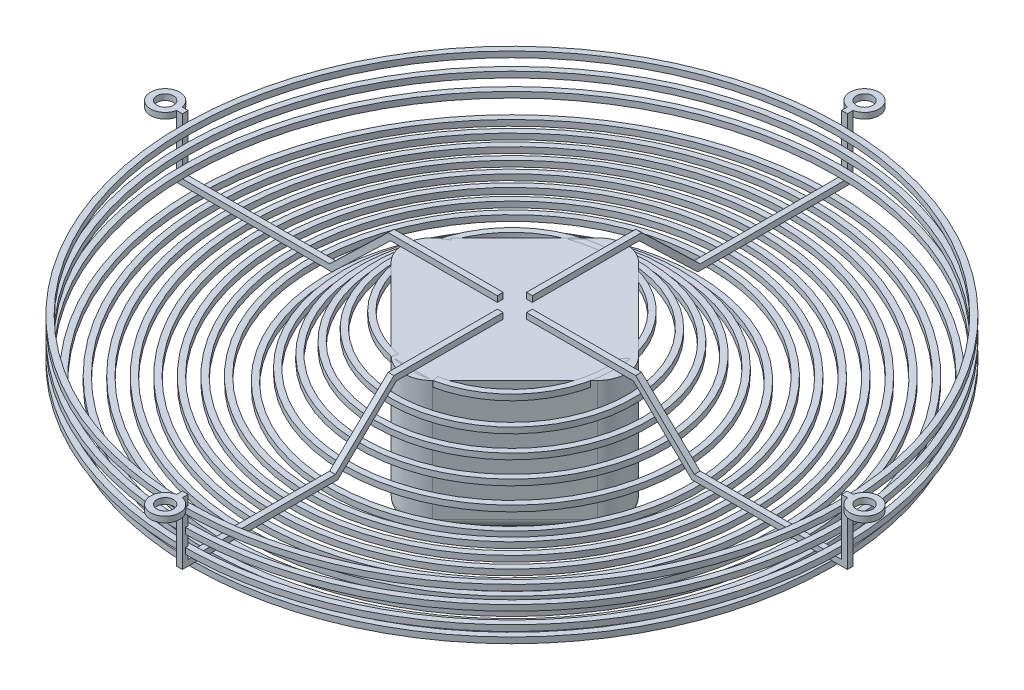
ISO-10303-21;
HEADER;
FILE_DESCRIPTION(('STEP AP214'),'2;1');
FILE_NAME('part.step','',(''),(''),'','','');
FILE_SCHEMA(('AUTOMOTIVE_DESIGN { 1 0 10303 214 1 1 1 1 }'));
ENDSEC;
DATA;
#1=APPLICATION_CONTEXT('core data for automotive mechanical design processes');
#2=APPLICATION_PROTOCOL_DEFINITION('international standard','automotive_design',2000,#1);
#3=PRODUCT_CONTEXT('',#1,'mechanical');
#4=PRODUCT('Part','Part','',(#3));
#5=PRODUCT_RELATED_PRODUCT_CATEGORY('part','',(#4));
#6=PRODUCT_DEFINITION_FORMATION('','',#4);
#7=PRODUCT_DEFINITION_CONTEXT('part definition',#1,'design');
#8=PRODUCT_DEFINITION('design','',#6,#7);
#9=PRODUCT_DEFINITION_SHAPE('','',#8);
#10=(LENGTH_UNIT() NAMED_UNIT(*) SI_UNIT(.MILLI.,.METRE.));
#11=(NAMED_UNIT(*) PLANE_ANGLE_UNIT() SI_UNIT($,.RADIAN.));
#12=(NAMED_UNIT(*) SI_UNIT($,.STERADIAN.) SOLID_ANGLE_UNIT());
#13=UNCERTAINTY_MEASURE_WITH_UNIT(LENGTH_MEASURE(1.E-05),#10,'distance_accuracy_value','');
#14=(GEOMETRIC_REPRESENTATION_CONTEXT(3) GLOBAL_UNCERTAINTY_ASSIGNED_CONTEXT((#13)) GLOBAL_UNIT_ASSIGNED_CONTEXT((#10,
#11,#12)) REPRESENTATION_CONTEXT('',''));
#15=CARTESIAN_POINT('',(0.,0.,0.));
#16=DIRECTION('',(0.,0.,1.));
#17=DIRECTION('',(1.,0.,0.));
#18=AXIS2_PLACEMENT_3D('',#15,#16,#17);
#19=CARTESIAN_POINT('',(-63.6396103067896,-36.,7.21644966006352E-13));
#20=DIRECTION('',(0.,-1.,0.));
#21=DIRECTION('',(1.,0.,0.));
#22=AXIS2_PLACEMENT_3D('',#19,#20,#21);
#23=PLANE('',#22);
#24=CARTESIAN_POINT('',(-5.82867087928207E-13,-36.,-42.4264068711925));
#25=DIRECTION('',(0.,-1.,0.));
#26=DIRECTION('',(1.,0.,0.));
#27=AXIS2_PLACEMENT_3D('',#24,#25,#26);
#28=CIRCLE('',#27,10.);
#29=CARTESIAN_POINT('',(7.07106781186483,-36.,-49.497474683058));
#30=VERTEX_POINT('',#29);
#31=CARTESIAN_POINT('',(-7.07106781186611,-36.,-49.4974746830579));
#32=VERTEX_POINT('',#31);
#33=EDGE_CURVE('E169',#30,#32,#28,.F.);
#34=ORIENTED_EDGE('',*,*,#33,.F.);
#35=DIRECTION('',(0.707106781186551,0.,0.707106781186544));
#36=VECTOR('',#35,1.);
#37=CARTESIAN_POINT('',(60.1040764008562,-36.,3.53553390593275));
#38=LINE('',#37,#36);
#39=CARTESIAN_POINT('',(49.4974746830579,-36.,-7.07106781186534));
#40=VERTEX_POINT('',#39);
#41=EDGE_CURVE('E270',#30,#40,#38,.T.);
#42=ORIENTED_EDGE('',*,*,#41,.T.);
#43=CARTESIAN_POINT('',(42.4264068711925,-36.,1.66533453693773E-13));
#44=DIRECTION('',(0.,-1.,0.));
#45=DIRECTION('',(1.,0.,0.));
#46=AXIS2_PLACEMENT_3D('',#43,#44,#45);
#47=CIRCLE('',#46,10.);
#48=CARTESIAN_POINT('',(49.497474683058,-36.,7.07106781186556));
#49=VERTEX_POINT('',#48);
#50=EDGE_CURVE('E177',#49,#40,#47,.F.);
#51=ORIENTED_EDGE('',*,*,#50,.F.);
#52=DIRECTION('',(-0.707106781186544,0.,0.707106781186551));
#53=VECTOR('',#52,1.);
#54=CARTESIAN_POINT('',(-3.53553390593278,-36.,60.1040764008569));
#55=LINE('',#54,#53);
#56=CARTESIAN_POINT('',(7.07106781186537,-36.,49.4974746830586));
#57=VERTEX_POINT('',#56);
#58=EDGE_CURVE('E269',#49,#57,#55,.T.);
#59=ORIENTED_EDGE('',*,*,#58,.T.);
#60=CARTESIAN_POINT('',(-1.38777878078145E-13,-36.,42.4264068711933));
#61=DIRECTION('',(0.,-1.,0.));
#62=DIRECTION('',(1.,0.,0.));
#63=AXIS2_PLACEMENT_3D('',#60,#61,#62);
#64=CIRCLE('',#63,10.);
#65=CARTESIAN_POINT('',(-7.07106781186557,-36.,49.4974746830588));
#66=VERTEX_POINT('',#65);
#67=EDGE_CURVE('E171',#66,#57,#64,.F.);
#68=ORIENTED_EDGE('',*,*,#67,.F.);
#69=DIRECTION('',(-0.707106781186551,0.,-0.707106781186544));
#70=VECTOR('',#69,1.);
#71=CARTESIAN_POINT('',(-60.1040764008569,-36.,-3.53553390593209));
#72=LINE('',#71,#70);
#73=CARTESIAN_POINT('',(-49.4974746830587,-36.,7.07106781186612));
#74=VERTEX_POINT('',#73);
#75=EDGE_CURVE('E316',#66,#74,#72,.T.);
#76=ORIENTED_EDGE('',*,*,#75,.T.);
#77=CARTESIAN_POINT('',(-42.4264068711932,-36.,6.10622663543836E-13));
#78=DIRECTION('',(0.,-1.,0.));
#79=DIRECTION('',(1.,0.,0.));
#80=AXIS2_PLACEMENT_3D('',#77,#78,#79);
#81=CIRCLE('',#80,10.);
#82=CARTESIAN_POINT('',(-49.4974746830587,-36.,-7.07106781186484));
#83=VERTEX_POINT('',#82);
#84=EDGE_CURVE('E185',#83,#74,#81,.F.);
#85=ORIENTED_EDGE('',*,*,#84,.F.);
#86=DIRECTION('',(0.707106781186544,0.,-0.707106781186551));
#87=VECTOR('',#86,1.);
#88=CARTESIAN_POINT('',(3.53553390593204,-36.,-60.1040764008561));
#89=LINE('',#88,#87);
#90=EDGE_CURVE('E281',#83,#32,#89,.T.);
#91=ORIENTED_EDGE('',*,*,#90,.T.);
#92=EDGE_LOOP('',(#34,#42,#51,#59,#68,#76,#85,#91));
#93=FACE_BOUND('',#92,.T.);
#94=ADVANCED_FACE('F49',(#93),#23,.T.);
#95=CARTESIAN_POINT('',(-63.6396103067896,-36.,7.21644966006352E-13));
#96=DIRECTION('',(0.707106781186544,0.,-0.707106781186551));
#97=DIRECTION('',(-0.707106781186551,0.,-0.707106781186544));
#98=AXIS2_PLACEMENT_3D('',#95,#96,#97);
#99=PLANE('',#98);
#100=DIRECTION('',(-0.707106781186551,0.,-0.707106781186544));
#101=VECTOR('',#100,1.);
#102=CARTESIAN_POINT('',(0.,-31.,63.6396103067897));
#103=LINE('',#102,#101);
#104=CARTESIAN_POINT('',(-53.0330085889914,-31.,10.6066017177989));
#105=VERTEX_POINT('',#104);
#106=CARTESIAN_POINT('',(-10.6066017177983,-31.,53.0330085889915));
#107=VERTEX_POINT('',#106);
#108=EDGE_CURVE('E154',#105,#107,#103,.F.);
#109=ORIENTED_EDGE('',*,*,#108,.T.);
#110=DIRECTION('',(0.,1.,0.));
#111=VECTOR('',#110,1.);
#112=CARTESIAN_POINT('',(-10.6066017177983,-36.,53.0330085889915));
#113=LINE('',#112,#111);
#114=CARTESIAN_POINT('',(-10.6066017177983,31.,53.0330085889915));
#115=VERTEX_POINT('',#114);
#116=EDGE_CURVE('E213',#107,#115,#113,.T.);
#117=ORIENTED_EDGE('',*,*,#116,.T.);
#118=DIRECTION('',(-0.707106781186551,0.,-0.707106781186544));
#119=VECTOR('',#118,1.);
#120=CARTESIAN_POINT('',(-63.6396103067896,31.,7.7715611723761E-13));
#121=LINE('',#120,#119);
#122=CARTESIAN_POINT('',(-53.0330085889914,31.,10.6066017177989));
#123=VERTEX_POINT('',#122);
#124=EDGE_CURVE('E165',#115,#123,#121,.T.);
#125=ORIENTED_EDGE('',*,*,#124,.T.);
#126=DIRECTION('',(0.,1.,0.));
#127=VECTOR('',#126,1.);
#128=CARTESIAN_POINT('',(-53.0330085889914,-36.,10.6066017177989));
#129=LINE('',#128,#127);
#130=EDGE_CURVE('E210',#123,#105,#129,.F.);
#131=ORIENTED_EDGE('',*,*,#130,.T.);
#132=EDGE_LOOP('',(#109,#117,#125,#131));
#133=FACE_BOUND('',#132,.T.);
#134=ADVANCED_FACE('F51',(#133),#99,.F.);
#135=CARTESIAN_POINT('',(-7.07767178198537E-13,-36.,-63.6396103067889));
#136=DIRECTION('',(0.707106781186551,0.,0.707106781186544));
#137=DIRECTION('',(0.707106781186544,0.,-0.707106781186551));
#138=AXIS2_PLACEMENT_3D('',#135,#136,#137);
#139=PLANE('',#138);
#140=DIRECTION('',(0.707106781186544,0.,-0.707106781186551));
#141=VECTOR('',#140,1.);
#142=CARTESIAN_POINT('',(-63.6396103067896,-31.,7.21644966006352E-13));
#143=LINE('',#142,#141);
#144=CARTESIAN_POINT('',(-10.6066017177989,-31.,-53.0330085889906));
#145=VERTEX_POINT('',#144);
#146=CARTESIAN_POINT('',(-53.0330085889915,-31.,-10.6066017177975));
#147=VERTEX_POINT('',#146);
#148=EDGE_CURVE('E139',#145,#147,#143,.F.);
#149=ORIENTED_EDGE('',*,*,#148,.T.);
#150=DIRECTION('',(0.,1.,0.));
#151=VECTOR('',#150,1.);
#152=CARTESIAN_POINT('',(-53.0330085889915,-36.,-10.6066017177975));
#153=LINE('',#152,#151);
#154=CARTESIAN_POINT('',(-53.0330085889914,31.,-10.6066017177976));
#155=VERTEX_POINT('',#154);
#156=EDGE_CURVE('E12',#147,#155,#153,.T.);
#157=ORIENTED_EDGE('',*,*,#156,.T.);
#158=DIRECTION('',(0.707106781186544,0.,-0.707106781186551));
#159=VECTOR('',#158,1.);
#160=CARTESIAN_POINT('',(-7.07767178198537E-13,31.,-63.6396103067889));
#161=LINE('',#160,#159);
#162=CARTESIAN_POINT('',(-10.6066017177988,31.,-53.0330085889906));
#163=VERTEX_POINT('',#162);
#164=EDGE_CURVE('E140',#155,#163,#161,.T.);
#165=ORIENTED_EDGE('',*,*,#164,.T.);
#166=DIRECTION('',(0.,1.,0.));
#167=VECTOR('',#166,1.);
#168=CARTESIAN_POINT('',(-10.6066017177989,-36.,-53.0330085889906));
#169=LINE('',#168,#167);
#170=EDGE_CURVE('E58',#163,#145,#169,.F.);
#171=ORIENTED_EDGE('',*,*,#170,.T.);
#172=EDGE_LOOP('',(#149,#157,#165,#171));
#173=FACE_BOUND('',#172,.T.);
#174=ADVANCED_FACE('F138',(#173),#139,.F.);
#175=CARTESIAN_POINT('',(63.639610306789,-36.0000000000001,0.));
#176=DIRECTION('',(-0.707106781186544,0.,0.707106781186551));
#177=DIRECTION('',(0.707106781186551,0.,0.707106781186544));
#178=AXIS2_PLACEMENT_3D('',#175,#176,#177);
#179=PLANE('',#178);
#180=DIRECTION('',(0.707106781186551,0.,0.707106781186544));
#181=VECTOR('',#180,1.);
#182=CARTESIAN_POINT('',(63.6396103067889,31.,0.));
#183=LINE('',#182,#181);
#184=CARTESIAN_POINT('',(10.6066017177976,31.,-53.0330085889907));
#185=VERTEX_POINT('',#184);
#186=CARTESIAN_POINT('',(53.0330085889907,31.,-10.6066017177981));
#187=VERTEX_POINT('',#186);
#188=EDGE_CURVE('E243',#185,#187,#183,.T.);
#189=ORIENTED_EDGE('',*,*,#188,.T.);
#190=DIRECTION('',(0.,1.,0.));
#191=VECTOR('',#190,1.);
#192=CARTESIAN_POINT('',(53.0330085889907,-36.,-10.6066017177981));
#193=LINE('',#192,#191);
#194=CARTESIAN_POINT('',(53.0330085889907,-31.0000000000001,-10.6066017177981));
#195=VERTEX_POINT('',#194);
#196=EDGE_CURVE('E144',#187,#195,#193,.F.);
#197=ORIENTED_EDGE('',*,*,#196,.T.);
#198=DIRECTION('',(0.707106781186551,0.,0.707106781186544));
#199=VECTOR('',#198,1.);
#200=CARTESIAN_POINT('',(-6.80011602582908E-13,-31.,-63.6396103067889));
#201=LINE('',#200,#199);
#202=CARTESIAN_POINT('',(10.6066017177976,-31.,-53.0330085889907));
#203=VERTEX_POINT('',#202);
#204=EDGE_CURVE('E155',#195,#203,#201,.F.);
#205=ORIENTED_EDGE('',*,*,#204,.T.);
#206=DIRECTION('',(0.,1.,0.));
#207=VECTOR('',#206,1.);
#208=CARTESIAN_POINT('',(10.6066017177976,-36.,-53.0330085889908));
#209=LINE('',#208,#207);
#210=EDGE_CURVE('E161',#203,#185,#209,.T.);
#211=ORIENTED_EDGE('',*,*,#210,.T.);
#212=EDGE_LOOP('',(#189,#197,#205,#211));
#213=FACE_BOUND('',#212,.T.);
#214=ADVANCED_FACE('F242',(#213),#179,.F.);
#215=CARTESIAN_POINT('',(0.,-36.,63.6396103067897));
#216=DIRECTION('',(-0.707106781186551,0.,-0.707106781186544));
#217=DIRECTION('',(-0.707106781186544,0.,0.707106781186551));
#218=AXIS2_PLACEMENT_3D('',#215,#216,#217);
#219=PLANE('',#218);
#220=DIRECTION('',(-0.707106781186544,0.,0.707106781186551));
#221=VECTOR('',#220,1.);
#222=CARTESIAN_POINT('',(0.,31.,63.6396103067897));
#223=LINE('',#222,#221);
#224=CARTESIAN_POINT('',(53.0330085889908,31.,10.6066017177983));
#225=VERTEX_POINT('',#224);
#226=CARTESIAN_POINT('',(10.6066017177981,31.,53.0330085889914));
#227=VERTEX_POINT('',#226);
#228=EDGE_CURVE('E312',#225,#227,#223,.T.);
#229=ORIENTED_EDGE('',*,*,#228,.T.);
#230=DIRECTION('',(0.,1.,0.));
#231=VECTOR('',#230,1.);
#232=CARTESIAN_POINT('',(10.6066017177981,-36.,53.0330085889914));
#233=LINE('',#232,#231);
#234=CARTESIAN_POINT('',(10.6066017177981,-31.,53.0330085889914));
#235=VERTEX_POINT('',#234);
#236=EDGE_CURVE('E230',#227,#235,#233,.F.);
#237=ORIENTED_EDGE('',*,*,#236,.T.);
#238=DIRECTION('',(-0.707106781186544,0.,0.707106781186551));
#239=VECTOR('',#238,1.);
#240=CARTESIAN_POINT('',(63.6396103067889,-31.,0.));
#241=LINE('',#240,#239);
#242=CARTESIAN_POINT('',(53.0330085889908,-31.,10.6066017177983));
#243=VERTEX_POINT('',#242);
#244=EDGE_CURVE('E253',#235,#243,#241,.F.);
#245=ORIENTED_EDGE('',*,*,#244,.T.);
#246=DIRECTION('',(0.,1.,0.));
#247=VECTOR('',#246,1.);
#248=CARTESIAN_POINT('',(53.0330085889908,-36.,10.6066017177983));
#249=LINE('',#248,#247);
#250=EDGE_CURVE('E227',#243,#225,#249,.T.);
#251=ORIENTED_EDGE('',*,*,#250,.T.);
#252=EDGE_LOOP('',(#229,#237,#245,#251));
#253=FACE_BOUND('',#252,.T.);
#254=ADVANCED_FACE('F330',(#253),#219,.F.);
#255=CARTESIAN_POINT('',(-63.6396103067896,31.,7.7715611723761E-13));
#256=DIRECTION('',(0.,-1.,0.));
#257=DIRECTION('',(1.,0.,0.));
#258=AXIS2_PLACEMENT_3D('',#255,#256,#257);
#259=PLANE('',#258);
#260=ORIENTED_EDGE('',*,*,#124,.F.);
#261=CARTESIAN_POINT('',(-1.2490009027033E-13,31.,42.4264068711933));
#262=DIRECTION('',(0.,-1.,0.));
#263=DIRECTION('',(1.,0.,0.));
#264=AXIS2_PLACEMENT_3D('',#261,#262,#263);
#265=CIRCLE('',#264,15.);
#266=EDGE_CURVE('E224',#115,#227,#265,.F.);
#267=ORIENTED_EDGE('',*,*,#266,.T.);
#268=ORIENTED_EDGE('',*,*,#228,.F.);
#269=CARTESIAN_POINT('',(42.4264068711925,31.,1.66533453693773E-13));
#270=DIRECTION('',(0.,-1.,0.));
#271=DIRECTION('',(1.,0.,0.));
#272=AXIS2_PLACEMENT_3D('',#269,#270,#271);
#273=CIRCLE('',#272,15.);
#274=EDGE_CURVE('E221',#225,#187,#273,.F.);
#275=ORIENTED_EDGE('',*,*,#274,.T.);
#276=ORIENTED_EDGE('',*,*,#188,.F.);
#277=CARTESIAN_POINT('',(-5.68989300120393E-13,31.,-42.4264068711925));
#278=DIRECTION('',(0.,-1.,0.));
#279=DIRECTION('',(1.,0.,0.));
#280=AXIS2_PLACEMENT_3D('',#277,#278,#279);
#281=CIRCLE('',#280,15.);
#282=EDGE_CURVE('E65',#185,#163,#281,.F.);
#283=ORIENTED_EDGE('',*,*,#282,.T.);
#284=ORIENTED_EDGE('',*,*,#164,.F.);
#285=CARTESIAN_POINT('',(-42.4264068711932,31.,6.10622663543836E-13));
#286=DIRECTION('',(0.,-1.,0.));
#287=DIRECTION('',(1.,0.,0.));
#288=AXIS2_PLACEMENT_3D('',#285,#286,#287);
#289=CIRCLE('',#288,15.);
#290=EDGE_CURVE('E218',#155,#123,#289,.F.);
#291=ORIENTED_EDGE('',*,*,#290,.T.);
#292=EDGE_LOOP('',(#260,#267,#268,#275,#276,#283,#284,#291));
#293=FACE_BOUND('',#292,.T.);
#294=ADVANCED_FACE('F327',(#293),#259,.F.);
#295=CARTESIAN_POINT('',(-60.1040764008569,-31.,3.53553390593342));
#296=DIRECTION('',(-0.707106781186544,0.,0.707106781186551));
#297=DIRECTION('',(0.707106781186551,0.,0.707106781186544));
#298=AXIS2_PLACEMENT_3D('',#295,#296,#297);
#299=CYLINDRICAL_SURFACE('',#298,5.);
#300=ORIENTED_EDGE('',*,*,#148,.F.);
#301=CARTESIAN_POINT('',(-7.07106781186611,-31.,-49.4974746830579));
#302=DIRECTION('',(-0.707106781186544,0.,0.707106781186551));
#303=DIRECTION('',(0.707106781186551,0.,0.707106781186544));
#304=AXIS2_PLACEMENT_3D('',#301,#302,#303);
#305=CIRCLE('',#304,5.);
#306=EDGE_CURVE('E150',#145,#32,#305,.T.);
#307=ORIENTED_EDGE('',*,*,#306,.T.);
#308=ORIENTED_EDGE('',*,*,#90,.F.);
#309=CARTESIAN_POINT('',(-49.4974746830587,-31.,-7.07106781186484));
#310=DIRECTION('',(0.707106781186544,0.,-0.707106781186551));
#311=DIRECTION('',(-0.707106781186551,0.,-0.707106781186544));
#312=AXIS2_PLACEMENT_3D('',#309,#310,#311);
#313=CIRCLE('',#312,5.);
#314=EDGE_CURVE('E152',#83,#147,#313,.T.);
#315=ORIENTED_EDGE('',*,*,#314,.T.);
#316=EDGE_LOOP('',(#300,#307,#308,#315));
#317=FACE_BOUND('',#316,.T.);
#318=ADVANCED_FACE('F147',(#317),#299,.T.);
#319=CARTESIAN_POINT('',(-3.53553390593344,-31.,-60.1040764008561));
#320=DIRECTION('',(-0.707106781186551,0.,-0.707106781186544));
#321=DIRECTION('',(-0.707106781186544,0.,0.707106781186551));
#322=AXIS2_PLACEMENT_3D('',#319,#320,#321);
#323=CYLINDRICAL_SURFACE('',#322,5.);
#324=ORIENTED_EDGE('',*,*,#204,.F.);
#325=CARTESIAN_POINT('',(49.4974746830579,-31.,-7.07106781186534));
#326=DIRECTION('',(-0.707106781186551,0.,-0.707106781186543));
#327=DIRECTION('',(-0.707106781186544,0.,0.707106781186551));
#328=AXIS2_PLACEMENT_3D('',#325,#326,#327);
#329=CIRCLE('',#328,5.);
#330=EDGE_CURVE('E200',#195,#40,#329,.T.);
#331=ORIENTED_EDGE('',*,*,#330,.T.);
#332=ORIENTED_EDGE('',*,*,#41,.F.);
#333=CARTESIAN_POINT('',(7.07106781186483,-31.,-49.4974746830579));
#334=DIRECTION('',(0.707106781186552,0.,0.707106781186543));
#335=DIRECTION('',(0.707106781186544,0.,-0.707106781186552));
#336=AXIS2_PLACEMENT_3D('',#333,#334,#335);
#337=CIRCLE('',#336,5.);
#338=EDGE_CURVE('E197',#30,#203,#337,.T.);
#339=ORIENTED_EDGE('',*,*,#338,.T.);
#340=EDGE_LOOP('',(#324,#331,#332,#339));
#341=FACE_BOUND('',#340,.T.);
#342=ADVANCED_FACE('F248',(#341),#323,.T.);
#343=CARTESIAN_POINT('',(-60.1040764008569,-31.,-3.53553390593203));
#344=DIRECTION('',(0.707106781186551,0.,0.707106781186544));
#345=DIRECTION('',(0.707106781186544,0.,-0.707106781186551));
#346=AXIS2_PLACEMENT_3D('',#343,#344,#345);
#347=CYLINDRICAL_SURFACE('',#346,5.);
#348=ORIENTED_EDGE('',*,*,#108,.F.);
#349=CARTESIAN_POINT('',(-49.4974746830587,-31.0000000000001,7.07106781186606));
#350=DIRECTION('',(0.707106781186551,0.,0.707106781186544));
#351=DIRECTION('',(0.707106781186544,0.,-0.707106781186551));
#352=AXIS2_PLACEMENT_3D('',#349,#350,#351);
#353=CIRCLE('',#352,5.);
#354=EDGE_CURVE('E194',#105,#74,#353,.T.);
#355=ORIENTED_EDGE('',*,*,#354,.T.);
#356=ORIENTED_EDGE('',*,*,#75,.F.);
#357=CARTESIAN_POINT('',(-7.07106781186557,-31.,49.4974746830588));
#358=DIRECTION('',(-0.707106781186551,0.,-0.707106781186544));
#359=DIRECTION('',(-0.707106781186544,0.,0.707106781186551));
#360=AXIS2_PLACEMENT_3D('',#357,#358,#359);
#361=CIRCLE('',#360,5.);
#362=EDGE_CURVE('E191',#66,#107,#361,.T.);
#363=ORIENTED_EDGE('',*,*,#362,.T.);
#364=EDGE_LOOP('',(#348,#355,#356,#363));
#365=FACE_BOUND('',#364,.T.);
#366=ADVANCED_FACE('F349',(#365),#347,.T.);
#367=CARTESIAN_POINT('',(-3.53553390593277,-31.,60.1040764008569));
#368=DIRECTION('',(0.707106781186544,0.,-0.707106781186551));
#369=DIRECTION('',(-0.707106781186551,0.,-0.707106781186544));
#370=AXIS2_PLACEMENT_3D('',#367,#368,#369);
#371=CYLINDRICAL_SURFACE('',#370,5.);
#372=ORIENTED_EDGE('',*,*,#244,.F.);
#373=CARTESIAN_POINT('',(7.07106781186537,-31.,49.4974746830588));
#374=DIRECTION('',(0.707106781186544,0.,-0.707106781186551));
#375=DIRECTION('',(-0.707106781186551,0.,-0.707106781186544));
#376=AXIS2_PLACEMENT_3D('',#373,#374,#375);
#377=CIRCLE('',#376,5.);
#378=EDGE_CURVE('E207',#235,#57,#377,.T.);
#379=ORIENTED_EDGE('',*,*,#378,.T.);
#380=ORIENTED_EDGE('',*,*,#58,.F.);
#381=CARTESIAN_POINT('',(49.497474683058,-31.,7.07106781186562));
#382=DIRECTION('',(-0.707106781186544,0.,0.707106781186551));
#383=DIRECTION('',(0.707106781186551,0.,0.707106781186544));
#384=AXIS2_PLACEMENT_3D('',#381,#382,#383);
#385=CIRCLE('',#384,5.);
#386=EDGE_CURVE('E204',#49,#243,#385,.T.);
#387=ORIENTED_EDGE('',*,*,#386,.T.);
#388=EDGE_LOOP('',(#372,#379,#380,#387));
#389=FACE_BOUND('',#388,.T.);
#390=ADVANCED_FACE('F273',(#389),#371,.T.);
#391=CARTESIAN_POINT('',(-5.82867087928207E-13,-36.,-42.4264068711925));
#392=DIRECTION('',(0.,1.,0.));
#393=DIRECTION('',(-1.,0.,0.));
#394=AXIS2_PLACEMENT_3D('',#391,#392,#393);
#395=CYLINDRICAL_SURFACE('',#394,15.);
#396=ORIENTED_EDGE('',*,*,#282,.F.);
#397=ORIENTED_EDGE('',*,*,#210,.F.);
#398=CARTESIAN_POINT('',(-5.82867087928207E-13,-31.,-42.4264068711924));
#399=DIRECTION('',(0.,-1.,0.));
#400=DIRECTION('',(1.,0.,0.));
#401=AXIS2_PLACEMENT_3D('',#398,#399,#400);
#402=CIRCLE('',#401,15.);
#403=EDGE_CURVE('E159',#145,#203,#402,.T.);
#404=ORIENTED_EDGE('',*,*,#403,.F.);
#405=ORIENTED_EDGE('',*,*,#170,.F.);
#406=EDGE_LOOP('',(#396,#397,#404,#405));
#407=FACE_BOUND('',#406,.T.);
#408=ADVANCED_FACE('F160',(#407),#395,.T.);
#409=CARTESIAN_POINT('',(-5.82867087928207E-13,-31.,-42.4264068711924));
#410=DIRECTION('',(0.,-1.,0.));
#411=DIRECTION('',(1.,0.,0.));
#412=AXIS2_PLACEMENT_3D('',#409,#410,#411);
#413=TOROIDAL_SURFACE('',#412,10.,5.);
#414=ORIENTED_EDGE('',*,*,#306,.F.);
#415=ORIENTED_EDGE('',*,*,#403,.T.);
#416=ORIENTED_EDGE('',*,*,#338,.F.);
#417=ORIENTED_EDGE('',*,*,#33,.T.);
#418=EDGE_LOOP('',(#414,#415,#416,#417));
#419=FACE_BOUND('',#418,.T.);
#420=ADVANCED_FACE('F168',(#419),#413,.T.);
#421=CARTESIAN_POINT('',(-42.4264068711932,-36.,6.10622663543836E-13));
#422=DIRECTION('',(0.,1.,0.));
#423=DIRECTION('',(-1.,0.,0.));
#424=AXIS2_PLACEMENT_3D('',#421,#422,#423);
#425=CYLINDRICAL_SURFACE('',#424,15.);
#426=ORIENTED_EDGE('',*,*,#290,.F.);
#427=ORIENTED_EDGE('',*,*,#156,.F.);
#428=CARTESIAN_POINT('',(-42.4264068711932,-31.,5.55111512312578E-13));
#429=DIRECTION('',(0.,-1.,0.));
#430=DIRECTION('',(1.,0.,0.));
#431=AXIS2_PLACEMENT_3D('',#428,#429,#430);
#432=CIRCLE('',#431,15.);
#433=EDGE_CURVE('E166',#105,#147,#432,.T.);
#434=ORIENTED_EDGE('',*,*,#433,.F.);
#435=ORIENTED_EDGE('',*,*,#130,.F.);
#436=EDGE_LOOP('',(#426,#427,#434,#435));
#437=FACE_BOUND('',#436,.T.);
#438=ADVANCED_FACE('F326',(#437),#425,.T.);
#439=CARTESIAN_POINT('',(-42.4264068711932,-31.,5.55111512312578E-13));
#440=DIRECTION('',(0.,-1.,0.));
#441=DIRECTION('',(1.,0.,0.));
#442=AXIS2_PLACEMENT_3D('',#439,#440,#441);
#443=TOROIDAL_SURFACE('',#442,10.,5.);
#444=ORIENTED_EDGE('',*,*,#314,.F.);
#445=ORIENTED_EDGE('',*,*,#84,.T.);
#446=ORIENTED_EDGE('',*,*,#354,.F.);
#447=ORIENTED_EDGE('',*,*,#433,.T.);
#448=EDGE_LOOP('',(#444,#445,#446,#447));
#449=FACE_BOUND('',#448,.T.);
#450=ADVANCED_FACE('F323',(#449),#443,.T.);
#451=CARTESIAN_POINT('',(42.4264068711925,-36.,1.66533453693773E-13));
#452=DIRECTION('',(0.,1.,0.));
#453=DIRECTION('',(-1.,0.,0.));
#454=AXIS2_PLACEMENT_3D('',#451,#452,#453);
#455=CYLINDRICAL_SURFACE('',#454,15.);
#456=ORIENTED_EDGE('',*,*,#274,.F.);
#457=ORIENTED_EDGE('',*,*,#250,.F.);
#458=CARTESIAN_POINT('',(42.4264068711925,-31.,1.66533453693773E-13));
#459=DIRECTION('',(0.,-1.,0.));
#460=DIRECTION('',(1.,0.,0.));
#461=AXIS2_PLACEMENT_3D('',#458,#459,#460);
#462=CIRCLE('',#461,15.);
#463=EDGE_CURVE('E257',#195,#243,#462,.T.);
#464=ORIENTED_EDGE('',*,*,#463,.F.);
#465=ORIENTED_EDGE('',*,*,#196,.F.);
#466=EDGE_LOOP('',(#456,#457,#464,#465));
#467=FACE_BOUND('',#466,.T.);
#468=ADVANCED_FACE('F258',(#467),#455,.T.);
#469=CARTESIAN_POINT('',(42.4264068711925,-31.,1.66533453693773E-13));
#470=DIRECTION('',(0.,-1.,0.));
#471=DIRECTION('',(1.,0.,0.));
#472=AXIS2_PLACEMENT_3D('',#469,#470,#471);
#473=TOROIDAL_SURFACE('',#472,10.,5.);
#474=ORIENTED_EDGE('',*,*,#330,.F.);
#475=ORIENTED_EDGE('',*,*,#463,.T.);
#476=ORIENTED_EDGE('',*,*,#386,.F.);
#477=ORIENTED_EDGE('',*,*,#50,.T.);
#478=EDGE_LOOP('',(#474,#475,#476,#477));
#479=FACE_BOUND('',#478,.T.);
#480=ADVANCED_FACE('F264',(#479),#473,.T.);
#481=CARTESIAN_POINT('',(-1.38777878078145E-13,-36.,42.4264068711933));
#482=DIRECTION('',(0.,1.,0.));
#483=DIRECTION('',(-1.,0.,0.));
#484=AXIS2_PLACEMENT_3D('',#481,#482,#483);
#485=CYLINDRICAL_SURFACE('',#484,15.);
#486=ORIENTED_EDGE('',*,*,#266,.F.);
#487=ORIENTED_EDGE('',*,*,#116,.F.);
#488=CARTESIAN_POINT('',(-1.38777878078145E-13,-31.,42.4264068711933));
#489=DIRECTION('',(0.,-1.,0.));
#490=DIRECTION('',(1.,0.,0.));
#491=AXIS2_PLACEMENT_3D('',#488,#489,#490);
#492=CIRCLE('',#491,15.);
#493=EDGE_CURVE('E262',#235,#107,#492,.T.);
#494=ORIENTED_EDGE('',*,*,#493,.F.);
#495=ORIENTED_EDGE('',*,*,#236,.F.);
#496=EDGE_LOOP('',(#486,#487,#494,#495));
#497=FACE_BOUND('',#496,.T.);
#498=ADVANCED_FACE('F298',(#497),#485,.T.);
#499=CARTESIAN_POINT('',(-1.38777878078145E-13,-31.,42.4264068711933));
#500=DIRECTION('',(0.,-1.,0.));
#501=DIRECTION('',(1.,0.,0.));
#502=AXIS2_PLACEMENT_3D('',#499,#500,#501);
#503=TOROIDAL_SURFACE('',#502,10.,5.);
#504=ORIENTED_EDGE('',*,*,#362,.F.);
#505=ORIENTED_EDGE('',*,*,#67,.T.);
#506=ORIENTED_EDGE('',*,*,#378,.F.);
#507=ORIENTED_EDGE('',*,*,#493,.T.);
#508=EDGE_LOOP('',(#504,#505,#506,#507));
#509=FACE_BOUND('',#508,.T.);
#510=ADVANCED_FACE('F301',(#509),#503,.T.);
#511=CLOSED_SHELL('',(#94,#134,#174,#214,#254,#294,#318,#342,#366,#390,#408,#420,#438,#450,#468,
#480,#498,#510));
#512=MANIFOLD_SOLID_BREP('B2',#511);
#513=CARTESIAN_POINT('',(0.,0.,1.50000000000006));
#514=DIRECTION('',(0.,-1.,0.));
#515=DIRECTION('',(0.,0.,-1.));
#516=AXIS2_PLACEMENT_3D('',#513,#514,#515);
#517=CYLINDRICAL_SURFACE('',#516,169.65153077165);
#518=CARTESIAN_POINT('',(0.,29.,1.50000000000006));
#519=DIRECTION('',(0.,-1.,0.));
#520=DIRECTION('',(0.,0.,-1.));
#521=AXIS2_PLACEMENT_3D('',#518,#519,#520);
#522=CIRCLE('',#521,169.65153077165);
#523=CARTESIAN_POINT('',(0.,29.,-168.15153077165));
#524=VERTEX_POINT('',#523);
#525=EDGE_CURVE('E48',#524,#524,#522,.T.);
#526=ORIENTED_EDGE('',*,*,#525,.T.);
#527=EDGE_LOOP('',(#526));
#528=FACE_BOUND('',#527,.T.);
#529=CARTESIAN_POINT('',(0.,26.0000000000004,1.5));
#530=DIRECTION('',(0.,-1.,0.));
#531=DIRECTION('',(0.,0.,-1.));
#532=AXIS2_PLACEMENT_3D('',#529,#530,#531);
#533=CIRCLE('',#532,169.65153077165);
#534=CARTESIAN_POINT('',(0.,26.0000000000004,-168.15153077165));
#535=VERTEX_POINT('',#534);
#536=EDGE_CURVE('E519',#535,#535,#533,.T.);
#537=ORIENTED_EDGE('',*,*,#536,.F.);
#538=EDGE_LOOP('',(#537));
#539=FACE_BOUND('',#538,.T.);
#540=ADVANCED_FACE('F502',(#528,#539),#517,.T.);
#541=CARTESIAN_POINT('',(169.65153077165,29.,1.5));
#542=DIRECTION('',(0.,1.,0.));
#543=DIRECTION('',(0.,0.,1.));
#544=AXIS2_PLACEMENT_3D('',#541,#542,#543);
#545=PLANE('',#544);
#546=CARTESIAN_POINT('',(0.,29.,1.50000000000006));
#547=DIRECTION('',(0.,-1.,0.));
#548=DIRECTION('',(0.,0.,-1.));
#549=AXIS2_PLACEMENT_3D('',#546,#547,#548);
#550=CIRCLE('',#549,166.65153077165);
#551=CARTESIAN_POINT('',(0.,29.,-165.15153077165));
#552=VERTEX_POINT('',#551);
#553=EDGE_CURVE('E509',#552,#552,#550,.T.);
#554=ORIENTED_EDGE('',*,*,#553,.T.);
#555=EDGE_LOOP('',(#554));
#556=FACE_BOUND('',#555,.T.);
#557=ORIENTED_EDGE('',*,*,#525,.F.);
#558=EDGE_LOOP('',(#557));
#559=FACE_BOUND('',#558,.T.);
#560=ADVANCED_FACE('F530',(#556,#559),#545,.T.);
#561=CARTESIAN_POINT('',(0.,0.,1.50000000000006));
#562=DIRECTION('',(0.,-1.,0.));
#563=DIRECTION('',(0.,0.,-1.));
#564=AXIS2_PLACEMENT_3D('',#561,#562,#563);
#565=CYLINDRICAL_SURFACE('',#564,166.65153077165);
#566=CARTESIAN_POINT('',(0.,26.,1.5));
#567=DIRECTION('',(0.,-1.,0.));
#568=DIRECTION('',(0.,0.,-1.));
#569=AXIS2_PLACEMENT_3D('',#566,#567,#568);
#570=CIRCLE('',#569,166.65153077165);
#571=CARTESIAN_POINT('',(0.,26.,-165.15153077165));
#572=VERTEX_POINT('',#571);
#573=EDGE_CURVE('E515',#572,#572,#570,.T.);
#574=ORIENTED_EDGE('',*,*,#573,.T.);
#575=EDGE_LOOP('',(#574));
#576=FACE_BOUND('',#575,.T.);
#577=ORIENTED_EDGE('',*,*,#553,.F.);
#578=EDGE_LOOP('',(#577));
#579=FACE_BOUND('',#578,.T.);
#580=ADVANCED_FACE('F534',(#576,#579),#565,.F.);
#581=CARTESIAN_POINT('',(169.65153077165,26.0000000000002,1.50000000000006));
#582=DIRECTION('',(0.,-1.,0.));
#583=DIRECTION('',(0.,0.,-1.));
#584=AXIS2_PLACEMENT_3D('',#581,#582,#583);
#585=PLANE('',#584);
#586=ORIENTED_EDGE('',*,*,#536,.T.);
#587=EDGE_LOOP('',(#586));
#588=FACE_BOUND('',#587,.T.);
#589=ORIENTED_EDGE('',*,*,#573,.F.);
#590=EDGE_LOOP('',(#589));
#591=FACE_BOUND('',#590,.T.);
#592=ADVANCED_FACE('F526',(#588,#591),#585,.T.);
#593=CLOSED_SHELL('',(#540,#560,#580,#592));
#594=MANIFOLD_SOLID_BREP('B6',#593);
#595=CARTESIAN_POINT('',(0.,0.,1.50000000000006));
#596=DIRECTION('',(0.,-1.,0.));
#597=DIRECTION('',(0.,0.,-1.));
#598=AXIS2_PLACEMENT_3D('',#595,#596,#597);
#599=CYLINDRICAL_SURFACE('',#598,169.65153077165);
#600=CARTESIAN_POINT('',(0.,20.,1.5));
#601=DIRECTION('',(0.,-1.,0.));
#602=DIRECTION('',(0.,0.,-1.));
#603=AXIS2_PLACEMENT_3D('',#600,#601,#602);
#604=CIRCLE('',#603,169.65153077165);
#605=CARTESIAN_POINT('',(0.,20.,-168.15153077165));
#606=VERTEX_POINT('',#605);
#607=EDGE_CURVE('E501',#606,#606,#604,.T.);
#608=ORIENTED_EDGE('',*,*,#607,.T.);
#609=EDGE_LOOP('',(#608));
#610=FACE_BOUND('',#609,.T.);
#611=CARTESIAN_POINT('',(0.,17.0000000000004,1.50000000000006));
#612=DIRECTION('',(0.,-1.,0.));
#613=DIRECTION('',(0.,0.,-1.));
#614=AXIS2_PLACEMENT_3D('',#611,#612,#613);
#615=CIRCLE('',#614,169.65153077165);
#616=CARTESIAN_POINT('',(0.,17.0000000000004,-168.15153077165));
#617=VERTEX_POINT('',#616);
#618=EDGE_CURVE('E597',#617,#617,#615,.T.);
#619=ORIENTED_EDGE('',*,*,#618,.F.);
#620=EDGE_LOOP('',(#619));
#621=FACE_BOUND('',#620,.T.);
#622=ADVANCED_FACE('F579',(#610,#621),#599,.T.);
#623=CARTESIAN_POINT('',(169.65153077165,20.,1.50000000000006));
#624=DIRECTION('',(0.,1.,0.));
#625=DIRECTION('',(0.,0.,1.));
#626=AXIS2_PLACEMENT_3D('',#623,#624,#625);
#627=PLANE('',#626);
#628=CARTESIAN_POINT('',(0.,20.,1.5));
#629=DIRECTION('',(0.,-1.,0.));
#630=DIRECTION('',(0.,0.,-1.));
#631=AXIS2_PLACEMENT_3D('',#628,#629,#630);
#632=CIRCLE('',#631,166.65153077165);
#633=CARTESIAN_POINT('',(0.,20.,-165.15153077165));
#634=VERTEX_POINT('',#633);
#635=EDGE_CURVE('E586',#634,#634,#632,.T.);
#636=ORIENTED_EDGE('',*,*,#635,.T.);
#637=EDGE_LOOP('',(#636));
#638=FACE_BOUND('',#637,.T.);
#639=ORIENTED_EDGE('',*,*,#607,.F.);
#640=EDGE_LOOP('',(#639));
#641=FACE_BOUND('',#640,.T.);
#642=ADVANCED_FACE('F607',(#638,#641),#627,.T.);
#643=CARTESIAN_POINT('',(0.,0.,1.50000000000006));
#644=DIRECTION('',(0.,-1.,0.));
#645=DIRECTION('',(0.,0.,-1.));
#646=AXIS2_PLACEMENT_3D('',#643,#644,#645);
#647=CYLINDRICAL_SURFACE('',#646,166.65153077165);
#648=CARTESIAN_POINT('',(0.,17.,1.50000000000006));
#649=DIRECTION('',(0.,-1.,0.));
#650=DIRECTION('',(0.,0.,-1.));
#651=AXIS2_PLACEMENT_3D('',#648,#649,#650);
#652=CIRCLE('',#651,166.65153077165);
#653=CARTESIAN_POINT('',(0.,17.,-165.15153077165));
#654=VERTEX_POINT('',#653);
#655=EDGE_CURVE('E592',#654,#654,#652,.T.);
#656=ORIENTED_EDGE('',*,*,#655,.T.);
#657=EDGE_LOOP('',(#656));
#658=FACE_BOUND('',#657,.T.);
#659=ORIENTED_EDGE('',*,*,#635,.F.);
#660=EDGE_LOOP('',(#659));
#661=FACE_BOUND('',#660,.T.);
#662=ADVANCED_FACE('F611',(#658,#661),#647,.F.);
#663=CARTESIAN_POINT('',(169.65153077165,17.0000000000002,1.50000000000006));
#664=DIRECTION('',(0.,-1.,0.));
#665=DIRECTION('',(0.,0.,-1.));
#666=AXIS2_PLACEMENT_3D('',#663,#664,#665);
#667=PLANE('',#666);
#668=ORIENTED_EDGE('',*,*,#618,.T.);
#669=EDGE_LOOP('',(#668));
#670=FACE_BOUND('',#669,.T.);
#671=ORIENTED_EDGE('',*,*,#655,.F.);
#672=EDGE_LOOP('',(#671));
#673=FACE_BOUND('',#672,.T.);
#674=ADVANCED_FACE('F603',(#670,#673),#667,.T.);
#675=CLOSED_SHELL('',(#622,#642,#662,#674));
#676=MANIFOLD_SOLID_BREP('B43',#675);
#677=CARTESIAN_POINT('',(0.,0.,1.50000000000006));
#678=DIRECTION('',(0.,-1.,0.));
#679=DIRECTION('',(0.,0.,-1.));
#680=AXIS2_PLACEMENT_3D('',#677,#678,#679);
#681=CYLINDRICAL_SURFACE('',#680,169.65153077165);
#682=CARTESIAN_POINT('',(0.,11.,1.50000000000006));
#683=DIRECTION('',(0.,-1.,0.));
#684=DIRECTION('',(0.,0.,-1.));
#685=AXIS2_PLACEMENT_3D('',#682,#683,#684);
#686=CIRCLE('',#685,169.65153077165);
#687=CARTESIAN_POINT('',(0.,11.,-168.15153077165));
#688=VERTEX_POINT('',#687);
#689=EDGE_CURVE('E578',#688,#688,#686,.T.);
#690=ORIENTED_EDGE('',*,*,#689,.T.);
#691=EDGE_LOOP('',(#690));
#692=FACE_BOUND('',#691,.T.);
#693=CARTESIAN_POINT('',(0.,8.00000000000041,1.50000000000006));
#694=DIRECTION('',(0.,-1.,0.));
#695=DIRECTION('',(0.,0.,-1.));
#696=AXIS2_PLACEMENT_3D('',#693,#694,#695);
#697=CIRCLE('',#696,169.65153077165);
#698=CARTESIAN_POINT('',(0.,8.00000000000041,-168.15153077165));
#699=VERTEX_POINT('',#698);
#700=EDGE_CURVE('E674',#699,#699,#697,.T.);
#701=ORIENTED_EDGE('',*,*,#700,.F.);
#702=EDGE_LOOP('',(#701));
#703=FACE_BOUND('',#702,.T.);
#704=ADVANCED_FACE('F656',(#692,#703),#681,.T.);
#705=CARTESIAN_POINT('',(169.65153077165,11.,1.50000000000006));
#706=DIRECTION('',(0.,1.,0.));
#707=DIRECTION('',(0.,0.,1.));
#708=AXIS2_PLACEMENT_3D('',#705,#706,#707);
#709=PLANE('',#708);
#710=CARTESIAN_POINT('',(0.,11.,1.50000000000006));
#711=DIRECTION('',(0.,-1.,0.));
#712=DIRECTION('',(0.,0.,-1.));
#713=AXIS2_PLACEMENT_3D('',#710,#711,#712);
#714=CIRCLE('',#713,166.65153077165);
#715=CARTESIAN_POINT('',(0.,11.,-165.15153077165));
#716=VERTEX_POINT('',#715);
#717=EDGE_CURVE('E663',#716,#716,#714,.T.);
#718=ORIENTED_EDGE('',*,*,#717,.T.);
#719=EDGE_LOOP('',(#718));
#720=FACE_BOUND('',#719,.T.);
#721=ORIENTED_EDGE('',*,*,#689,.F.);
#722=EDGE_LOOP('',(#721));
#723=FACE_BOUND('',#722,.T.);
#724=ADVANCED_FACE('F684',(#720,#723),#709,.T.);
#725=CARTESIAN_POINT('',(0.,0.,1.50000000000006));
#726=DIRECTION('',(0.,-1.,0.));
#727=DIRECTION('',(0.,0.,-1.));
#728=AXIS2_PLACEMENT_3D('',#725,#726,#727);
#729=CYLINDRICAL_SURFACE('',#728,166.65153077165);
#730=CARTESIAN_POINT('',(0.,7.99999999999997,1.50000000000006));
#731=DIRECTION('',(0.,-1.,0.));
#732=DIRECTION('',(0.,0.,-1.));
#733=AXIS2_PLACEMENT_3D('',#730,#731,#732);
#734=CIRCLE('',#733,166.65153077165);
#735=CARTESIAN_POINT('',(0.,7.99999999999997,-165.15153077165));
#736=VERTEX_POINT('',#735);
#737=EDGE_CURVE('E669',#736,#736,#734,.T.);
#738=ORIENTED_EDGE('',*,*,#737,.T.);
#739=EDGE_LOOP('',(#738));
#740=FACE_BOUND('',#739,.T.);
#741=ORIENTED_EDGE('',*,*,#717,.F.);
#742=EDGE_LOOP('',(#741));
#743=FACE_BOUND('',#742,.T.);
#744=ADVANCED_FACE('F688',(#740,#743),#729,.F.);
#745=CARTESIAN_POINT('',(169.65153077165,8.00000000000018,1.50000000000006));
#746=DIRECTION('',(0.,-1.,0.));
#747=DIRECTION('',(0.,0.,-1.));
#748=AXIS2_PLACEMENT_3D('',#745,#746,#747);
#749=PLANE('',#748);
#750=ORIENTED_EDGE('',*,*,#700,.T.);
#751=EDGE_LOOP('',(#750));
#752=FACE_BOUND('',#751,.T.);
#753=ORIENTED_EDGE('',*,*,#737,.F.);
#754=EDGE_LOOP('',(#753));
#755=FACE_BOUND('',#754,.T.);
#756=ADVANCED_FACE('F680',(#752,#755),#749,.T.);
#757=CLOSED_SHELL('',(#704,#724,#744,#756));
#758=MANIFOLD_SOLID_BREP('B496',#757);
#759=CARTESIAN_POINT('',(0.,0.,1.50000000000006));
#760=DIRECTION('',(0.,-1.,0.));
#761=DIRECTION('',(0.,0.,-1.));
#762=AXIS2_PLACEMENT_3D('',#759,#760,#761);
#763=CYLINDRICAL_SURFACE('',#762,62.5243044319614);
#764=CARTESIAN_POINT('',(0.,23.3632554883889,1.5));
#765=DIRECTION('',(0.,-1.,0.));
#766=DIRECTION('',(0.,0.,-1.));
#767=AXIS2_PLACEMENT_3D('',#764,#765,#766);
#768=CIRCLE('',#767,62.5243044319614);
#769=CARTESIAN_POINT('',(0.,23.3632554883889,-61.0243044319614));
#770=VERTEX_POINT('',#769);
#771=EDGE_CURVE('E655',#770,#770,#768,.T.);
#772=ORIENTED_EDGE('',*,*,#771,.T.);
#773=EDGE_LOOP('',(#772));
#774=FACE_BOUND('',#773,.T.);
#775=CARTESIAN_POINT('',(0.,20.3632554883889,1.5));
#776=DIRECTION('',(0.,-1.,0.));
#777=DIRECTION('',(0.,0.,-1.));
#778=AXIS2_PLACEMENT_3D('',#775,#776,#777);
#779=CIRCLE('',#778,62.5243044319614);
#780=CARTESIAN_POINT('',(0.,20.3632554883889,-61.0243044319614));
#781=VERTEX_POINT('',#780);
#782=EDGE_CURVE('E750',#781,#781,#779,.T.);
#783=ORIENTED_EDGE('',*,*,#782,.F.);
#784=EDGE_LOOP('',(#783));
#785=FACE_BOUND('',#784,.T.);
#786=ADVANCED_FACE('F733',(#774,#785),#763,.T.);
#787=CARTESIAN_POINT('',(62.5243044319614,23.3632554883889,1.50000000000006));
#788=DIRECTION('',(0.,1.,0.));
#789=DIRECTION('',(0.,0.,1.));
#790=AXIS2_PLACEMENT_3D('',#787,#788,#789);
#791=PLANE('',#790);
#792=CARTESIAN_POINT('',(0.,23.3632554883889,1.5));
#793=DIRECTION('',(0.,-1.,0.));
#794=DIRECTION('',(0.,0.,-1.));
#795=AXIS2_PLACEMENT_3D('',#792,#793,#794);
#796=CIRCLE('',#795,59.5243044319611);
#797=CARTESIAN_POINT('',(0.,23.3632554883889,-58.0243044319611));
#798=VERTEX_POINT('',#797);
#799=EDGE_CURVE('E740',#798,#798,#796,.T.);
#800=ORIENTED_EDGE('',*,*,#799,.T.);
#801=EDGE_LOOP('',(#800));
#802=FACE_BOUND('',#801,.T.);
#803=ORIENTED_EDGE('',*,*,#771,.F.);
#804=EDGE_LOOP('',(#803));
#805=FACE_BOUND('',#804,.T.);
#806=ADVANCED_FACE('F761',(#802,#805),#791,.T.);
#807=CARTESIAN_POINT('',(0.,0.,1.50000000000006));
#808=DIRECTION('',(0.,-1.,0.));
#809=DIRECTION('',(0.,0.,-1.));
#810=AXIS2_PLACEMENT_3D('',#807,#808,#809);
#811=CYLINDRICAL_SURFACE('',#810,59.5243044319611);
#812=CARTESIAN_POINT('',(0.,20.3632554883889,1.5));
#813=DIRECTION('',(0.,-1.,0.));
#814=DIRECTION('',(0.,0.,-1.));
#815=AXIS2_PLACEMENT_3D('',#812,#813,#814);
#816=CIRCLE('',#815,59.5243044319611);
#817=CARTESIAN_POINT('',(0.,20.3632554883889,-58.0243044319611));
#818=VERTEX_POINT('',#817);
#819=EDGE_CURVE('E746',#818,#818,#816,.T.);
#820=ORIENTED_EDGE('',*,*,#819,.T.);
#821=EDGE_LOOP('',(#820));
#822=FACE_BOUND('',#821,.T.);
#823=ORIENTED_EDGE('',*,*,#799,.F.);
#824=EDGE_LOOP('',(#823));
#825=FACE_BOUND('',#824,.T.);
#826=ADVANCED_FACE('F765',(#822,#825),#811,.F.);
#827=CARTESIAN_POINT('',(62.5243044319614,20.3632554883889,1.50000000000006));
#828=DIRECTION('',(0.,-1.,0.));
#829=DIRECTION('',(0.,0.,-1.));
#830=AXIS2_PLACEMENT_3D('',#827,#828,#829);
#831=PLANE('',#830);
#832=ORIENTED_EDGE('',*,*,#782,.T.);
#833=EDGE_LOOP('',(#832));
#834=FACE_BOUND('',#833,.T.);
#835=ORIENTED_EDGE('',*,*,#819,.F.);
#836=EDGE_LOOP('',(#835));
#837=FACE_BOUND('',#836,.T.);
#838=ADVANCED_FACE('F757',(#834,#837),#831,.T.);
#839=CLOSED_SHELL('',(#786,#806,#826,#838));
#840=MANIFOLD_SOLID_BREP('B573',#839);
#841=CARTESIAN_POINT('',(0.,0.,1.50000000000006));
#842=DIRECTION('',(0.,-1.,0.));
#843=DIRECTION('',(0.,0.,-1.));
#844=AXIS2_PLACEMENT_3D('',#841,#842,#843);
#845=CYLINDRICAL_SURFACE('',#844,70.6144743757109);
#846=CARTESIAN_POINT('',(0.,17.4854029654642,1.50000000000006));
#847=DIRECTION('',(0.,-1.,0.));
#848=DIRECTION('',(0.,0.,-1.));
#849=AXIS2_PLACEMENT_3D('',#846,#847,#848);
#850=CIRCLE('',#849,70.6144743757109);
#851=CARTESIAN_POINT('',(0.,17.4854029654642,-69.1144743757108));
#852=VERTEX_POINT('',#851);
#853=EDGE_CURVE('E732',#852,#852,#850,.T.);
#854=ORIENTED_EDGE('',*,*,#853,.T.);
#855=EDGE_LOOP('',(#854));
#856=FACE_BOUND('',#855,.T.);
#857=CARTESIAN_POINT('',(0.,14.4854029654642,1.50000000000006));
#858=DIRECTION('',(0.,-1.,0.));
#859=DIRECTION('',(0.,0.,-1.));
#860=AXIS2_PLACEMENT_3D('',#857,#858,#859);
#861=CIRCLE('',#860,70.6144743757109);
#862=CARTESIAN_POINT('',(0.,14.4854029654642,-69.1144743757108));
#863=VERTEX_POINT('',#862);
#864=EDGE_CURVE('E828',#863,#863,#861,.T.);
#865=ORIENTED_EDGE('',*,*,#864,.F.);
#866=EDGE_LOOP('',(#865));
#867=FACE_BOUND('',#866,.T.);
#868=ADVANCED_FACE('F810',(#856,#867),#845,.T.);
#869=CARTESIAN_POINT('',(70.6144743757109,17.4854029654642,1.50000000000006));
#870=DIRECTION('',(0.,1.,0.));
#871=DIRECTION('',(0.,0.,1.));
#872=AXIS2_PLACEMENT_3D('',#869,#870,#871);
#873=PLANE('',#872);
#874=CARTESIAN_POINT('',(0.,17.4854029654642,1.50000000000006));
#875=DIRECTION('',(0.,-1.,0.));
#876=DIRECTION('',(0.,0.,-1.));
#877=AXIS2_PLACEMENT_3D('',#874,#875,#876);
#878=CIRCLE('',#877,67.6144743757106);
#879=CARTESIAN_POINT('',(0.,17.4854029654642,-66.1144743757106));
#880=VERTEX_POINT('',#879);
#881=EDGE_CURVE('E817',#880,#880,#878,.T.);
#882=ORIENTED_EDGE('',*,*,#881,.T.);
#883=EDGE_LOOP('',(#882));
#884=FACE_BOUND('',#883,.T.);
#885=ORIENTED_EDGE('',*,*,#853,.F.);
#886=EDGE_LOOP('',(#885));
#887=FACE_BOUND('',#886,.T.);
#888=ADVANCED_FACE('F838',(#884,#887),#873,.T.);
#889=CARTESIAN_POINT('',(0.,0.,1.50000000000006));
#890=DIRECTION('',(0.,-1.,0.));
#891=DIRECTION('',(0.,0.,-1.));
#892=AXIS2_PLACEMENT_3D('',#889,#890,#891);
#893=CYLINDRICAL_SURFACE('',#892,67.6144743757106);
#894=CARTESIAN_POINT('',(0.,14.4854029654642,1.50000000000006));
#895=DIRECTION('',(0.,-1.,0.));
#896=DIRECTION('',(0.,0.,-1.));
#897=AXIS2_PLACEMENT_3D('',#894,#895,#896);
#898=CIRCLE('',#897,67.6144743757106);
#899=CARTESIAN_POINT('',(0.,14.4854029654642,-66.1144743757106));
#900=VERTEX_POINT('',#899);
#901=EDGE_CURVE('E822',#900,#900,#898,.T.);
#902=ORIENTED_EDGE('',*,*,#901,.T.);
#903=EDGE_LOOP('',(#902));
#904=FACE_BOUND('',#903,.T.);
#905=ORIENTED_EDGE('',*,*,#881,.F.);
#906=EDGE_LOOP('',(#905));
#907=FACE_BOUND('',#906,.T.);
#908=ADVANCED_FACE('F842',(#904,#907),#893,.F.);
#909=CARTESIAN_POINT('',(70.6144743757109,14.4854029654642,1.50000000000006));
#910=DIRECTION('',(0.,-1.,0.));
#911=DIRECTION('',(0.,0.,-1.));
#912=AXIS2_PLACEMENT_3D('',#909,#910,#911);
#913=PLANE('',#912);
#914=ORIENTED_EDGE('',*,*,#864,.T.);
#915=EDGE_LOOP('',(#914));
#916=FACE_BOUND('',#915,.T.);
#917=ORIENTED_EDGE('',*,*,#901,.F.);
#918=EDGE_LOOP('',(#917));
#919=FACE_BOUND('',#918,.T.);
#920=ADVANCED_FACE('F834',(#916,#919),#913,.T.);
#921=CLOSED_SHELL('',(#868,#888,#908,#920));
#922=MANIFOLD_SOLID_BREP('B650',#921);
#923=CARTESIAN_POINT('',(0.,0.,1.50000000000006));
#924=DIRECTION('',(0.,-1.,0.));
#925=DIRECTION('',(0.,0.,-1.));
#926=AXIS2_PLACEMENT_3D('',#923,#924,#925);
#927=CYLINDRICAL_SURFACE('',#926,78.7046443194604);
#928=CARTESIAN_POINT('',(0.,11.6075504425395,1.50000000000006));
#929=DIRECTION('',(0.,-1.,0.));
#930=DIRECTION('',(0.,0.,-1.));
#931=AXIS2_PLACEMENT_3D('',#928,#929,#930);
#932=CIRCLE('',#931,78.7046443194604);
#933=CARTESIAN_POINT('',(0.,11.6075504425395,-77.2046443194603));
#934=VERTEX_POINT('',#933);
#935=EDGE_CURVE('E809',#934,#934,#932,.T.);
#936=ORIENTED_EDGE('',*,*,#935,.T.);
#937=EDGE_LOOP('',(#936));
#938=FACE_BOUND('',#937,.T.);
#939=CARTESIAN_POINT('',(0.,8.6075504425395,1.50000000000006));
#940=DIRECTION('',(0.,-1.,0.));
#941=DIRECTION('',(0.,0.,-1.));
#942=AXIS2_PLACEMENT_3D('',#939,#940,#941);
#943=CIRCLE('',#942,78.7046443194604);
#944=CARTESIAN_POINT('',(0.,8.6075504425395,-77.2046443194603));
#945=VERTEX_POINT('',#944);
#946=EDGE_CURVE('E905',#945,#945,#943,.T.);
#947=ORIENTED_EDGE('',*,*,#946,.F.);
#948=EDGE_LOOP('',(#947));
#949=FACE_BOUND('',#948,.T.);
#950=ADVANCED_FACE('F887',(#938,#949),#927,.T.);
#951=CARTESIAN_POINT('',(78.7046443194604,11.6075504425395,1.50000000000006));
#952=DIRECTION('',(0.,1.,0.));
#953=DIRECTION('',(0.,0.,1.));
#954=AXIS2_PLACEMENT_3D('',#951,#952,#953);
#955=PLANE('',#954);
#956=CARTESIAN_POINT('',(0.,11.6075504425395,1.50000000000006));
#957=DIRECTION('',(0.,-1.,0.));
#958=DIRECTION('',(0.,0.,-1.));
#959=AXIS2_PLACEMENT_3D('',#956,#957,#958);
#960=CIRCLE('',#959,75.7046443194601);
#961=CARTESIAN_POINT('',(0.,11.6075504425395,-74.2046443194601));
#962=VERTEX_POINT('',#961);
#963=EDGE_CURVE('E894',#962,#962,#960,.T.);
#964=ORIENTED_EDGE('',*,*,#963,.T.);
#965=EDGE_LOOP('',(#964));
#966=FACE_BOUND('',#965,.T.);
#967=ORIENTED_EDGE('',*,*,#935,.F.);
#968=EDGE_LOOP('',(#967));
#969=FACE_BOUND('',#968,.T.);
#970=ADVANCED_FACE('F915',(#966,#969),#955,.T.);
#971=CARTESIAN_POINT('',(0.,0.,1.50000000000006));
#972=DIRECTION('',(0.,-1.,0.));
#973=DIRECTION('',(0.,0.,-1.));
#974=AXIS2_PLACEMENT_3D('',#971,#972,#973);
#975=CYLINDRICAL_SURFACE('',#974,75.7046443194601);
#976=CARTESIAN_POINT('',(0.,8.6075504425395,1.50000000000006));
#977=DIRECTION('',(0.,-1.,0.));
#978=DIRECTION('',(0.,0.,-1.));
#979=AXIS2_PLACEMENT_3D('',#976,#977,#978);
#980=CIRCLE('',#979,75.7046443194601);
#981=CARTESIAN_POINT('',(0.,8.6075504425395,-74.2046443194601));
#982=VERTEX_POINT('',#981);
#983=EDGE_CURVE('E900',#982,#982,#980,.T.);
#984=ORIENTED_EDGE('',*,*,#983,.T.);
#985=EDGE_LOOP('',(#984));
#986=FACE_BOUND('',#985,.T.);
#987=ORIENTED_EDGE('',*,*,#963,.F.);
#988=EDGE_LOOP('',(#987));
#989=FACE_BOUND('',#988,.T.);
#990=ADVANCED_FACE('F919',(#986,#989),#975,.F.);
#991=CARTESIAN_POINT('',(78.7046443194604,8.60755044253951,1.50000000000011));
#992=DIRECTION('',(0.,-1.,0.));
#993=DIRECTION('',(0.,0.,-1.));
#994=AXIS2_PLACEMENT_3D('',#991,#992,#993);
#995=PLANE('',#994);
#996=ORIENTED_EDGE('',*,*,#946,.T.);
#997=EDGE_LOOP('',(#996));
#998=FACE_BOUND('',#997,.T.);
#999=ORIENTED_EDGE('',*,*,#983,.F.);
#1000=EDGE_LOOP('',(#999));
#1001=FACE_BOUND('',#1000,.T.);
#1002=ADVANCED_FACE('F911',(#998,#1001),#995,.T.);
#1003=CLOSED_SHELL('',(#950,#970,#990,#1002));
#1004=MANIFOLD_SOLID_BREP('B727',#1003);
#1005=CARTESIAN_POINT('',(0.,0.,1.50000000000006));
#1006=DIRECTION('',(0.,-1.,0.));
#1007=DIRECTION('',(0.,0.,-1.));
#1008=AXIS2_PLACEMENT_3D('',#1005,#1006,#1007);
#1009=CYLINDRICAL_SURFACE('',#1008,86.7948142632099);
#1010=CARTESIAN_POINT('',(0.,5.72969791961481,1.50000000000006));
#1011=DIRECTION('',(0.,-1.,0.));
#1012=DIRECTION('',(0.,0.,-1.));
#1013=AXIS2_PLACEMENT_3D('',#1010,#1011,#1012);
#1014=CIRCLE('',#1013,86.7948142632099);
#1015=CARTESIAN_POINT('',(0.,5.72969791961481,-85.2948142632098));
#1016=VERTEX_POINT('',#1015);
#1017=EDGE_CURVE('E886',#1016,#1016,#1014,.T.);
#1018=ORIENTED_EDGE('',*,*,#1017,.T.);
#1019=EDGE_LOOP('',(#1018));
#1020=FACE_BOUND('',#1019,.T.);
#1021=CARTESIAN_POINT('',(0.,2.7296979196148,1.49999999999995));
#1022=DIRECTION('',(0.,-1.,0.));
#1023=DIRECTION('',(0.,0.,-1.));
#1024=AXIS2_PLACEMENT_3D('',#1021,#1022,#1023);
#1025=CIRCLE('',#1024,86.7948142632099);
#1026=CARTESIAN_POINT('',(0.,2.72969791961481,-85.2948142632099));
#1027=VERTEX_POINT('',#1026);
#1028=EDGE_CURVE('E982',#1027,#1027,#1025,.T.);
#1029=ORIENTED_EDGE('',*,*,#1028,.F.);
#1030=EDGE_LOOP('',(#1029));
#1031=FACE_BOUND('',#1030,.T.);
#1032=ADVANCED_FACE('F964',(#1020,#1031),#1009,.T.);
#1033=CARTESIAN_POINT('',(86.7948142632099,5.72969791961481,1.50000000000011));
#1034=DIRECTION('',(0.,1.,0.));
#1035=DIRECTION('',(0.,0.,1.));
#1036=AXIS2_PLACEMENT_3D('',#1033,#1034,#1035);
#1037=PLANE('',#1036);
#1038=CARTESIAN_POINT('',(0.,5.72969791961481,1.50000000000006));
#1039=DIRECTION('',(0.,-1.,0.));
#1040=DIRECTION('',(0.,0.,-1.));
#1041=AXIS2_PLACEMENT_3D('',#1038,#1039,#1040);
#1042=CIRCLE('',#1041,83.7948142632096);
#1043=CARTESIAN_POINT('',(0.,5.72969791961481,-82.2948142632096));
#1044=VERTEX_POINT('',#1043);
#1045=EDGE_CURVE('E971',#1044,#1044,#1042,.T.);
#1046=ORIENTED_EDGE('',*,*,#1045,.T.);
#1047=EDGE_LOOP('',(#1046));
#1048=FACE_BOUND('',#1047,.T.);
#1049=ORIENTED_EDGE('',*,*,#1017,.F.);
#1050=EDGE_LOOP('',(#1049));
#1051=FACE_BOUND('',#1050,.T.);
#1052=ADVANCED_FACE('F992',(#1048,#1051),#1037,.T.);
#1053=CARTESIAN_POINT('',(0.,0.,1.50000000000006));
#1054=DIRECTION('',(0.,-1.,0.));
#1055=DIRECTION('',(0.,0.,-1.));
#1056=AXIS2_PLACEMENT_3D('',#1053,#1054,#1055);
#1057=CYLINDRICAL_SURFACE('',#1056,83.7948142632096);
#1058=CARTESIAN_POINT('',(0.,2.7296979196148,1.49999999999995));
#1059=DIRECTION('',(0.,-1.,0.));
#1060=DIRECTION('',(0.,0.,-1.));
#1061=AXIS2_PLACEMENT_3D('',#1058,#1059,#1060);
#1062=CIRCLE('',#1061,83.7948142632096);
#1063=CARTESIAN_POINT('',(0.,2.72969791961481,-82.2948142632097));
#1064=VERTEX_POINT('',#1063);
#1065=EDGE_CURVE('E977',#1064,#1064,#1062,.T.);
#1066=ORIENTED_EDGE('',*,*,#1065,.T.);
#1067=EDGE_LOOP('',(#1066));
#1068=FACE_BOUND('',#1067,.T.);
#1069=ORIENTED_EDGE('',*,*,#1045,.F.);
#1070=EDGE_LOOP('',(#1069));
#1071=FACE_BOUND('',#1070,.T.);
#1072=ADVANCED_FACE('F996',(#1068,#1071),#1057,.F.);
#1073=CARTESIAN_POINT('',(86.7948142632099,2.7296979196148,1.50000000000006));
#1074=DIRECTION('',(0.,-1.,0.));
#1075=DIRECTION('',(0.,0.,-1.));
#1076=AXIS2_PLACEMENT_3D('',#1073,#1074,#1075);
#1077=PLANE('',#1076);
#1078=ORIENTED_EDGE('',*,*,#1028,.T.);
#1079=EDGE_LOOP('',(#1078));
#1080=FACE_BOUND('',#1079,.T.);
#1081=ORIENTED_EDGE('',*,*,#1065,.F.);
#1082=EDGE_LOOP('',(#1081));
#1083=FACE_BOUND('',#1082,.T.);
#1084=ADVANCED_FACE('F988',(#1080,#1083),#1077,.T.);
#1085=CLOSED_SHELL('',(#1032,#1052,#1072,#1084));
#1086=MANIFOLD_SOLID_BREP('B804',#1085);
#1087=CARTESIAN_POINT('',(0.,0.,1.50000000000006));
#1088=DIRECTION('',(0.,-1.,0.));
#1089=DIRECTION('',(0.,0.,-1.));
#1090=AXIS2_PLACEMENT_3D('',#1087,#1088,#1089);
#1091=CYLINDRICAL_SURFACE('',#1090,94.8849842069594);
#1092=CARTESIAN_POINT('',(0.,-0.148154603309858,1.50000000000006));
#1093=DIRECTION('',(0.,-1.,0.));
#1094=DIRECTION('',(0.,0.,-1.));
#1095=AXIS2_PLACEMENT_3D('',#1092,#1093,#1094);
#1096=CIRCLE('',#1095,94.8849842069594);
#1097=CARTESIAN_POINT('',(0.,-0.148154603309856,-93.3849842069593));
#1098=VERTEX_POINT('',#1097);
#1099=EDGE_CURVE('E963',#1098,#1098,#1096,.T.);
#1100=ORIENTED_EDGE('',*,*,#1099,.T.);
#1101=EDGE_LOOP('',(#1100));
#1102=FACE_BOUND('',#1101,.T.);
#1103=CARTESIAN_POINT('',(0.,-3.14815460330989,1.50000000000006));
#1104=DIRECTION('',(0.,-1.,0.));
#1105=DIRECTION('',(0.,0.,-1.));
#1106=AXIS2_PLACEMENT_3D('',#1103,#1104,#1105);
#1107=CIRCLE('',#1106,94.8849842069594);
#1108=CARTESIAN_POINT('',(0.,-3.14815460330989,-93.3849842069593));
#1109=VERTEX_POINT('',#1108);
#1110=EDGE_CURVE('E1061',#1109,#1109,#1107,.T.);
#1111=ORIENTED_EDGE('',*,*,#1110,.F.);
#1112=EDGE_LOOP('',(#1111));
#1113=FACE_BOUND('',#1112,.T.);
#1114=ADVANCED_FACE('F1043',(#1102,#1113),#1091,.T.);
#1115=CARTESIAN_POINT('',(94.8849842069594,-0.14815460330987,1.50000000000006));
#1116=DIRECTION('',(0.,1.,0.));
#1117=DIRECTION('',(0.,0.,1.));
#1118=AXIS2_PLACEMENT_3D('',#1115,#1116,#1117);
#1119=PLANE('',#1118);
#1120=CARTESIAN_POINT('',(0.,-0.148154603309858,1.50000000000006));
#1121=DIRECTION('',(0.,-1.,0.));
#1122=DIRECTION('',(0.,0.,-1.));
#1123=AXIS2_PLACEMENT_3D('',#1120,#1121,#1122);
#1124=CIRCLE('',#1123,91.8849842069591);
#1125=CARTESIAN_POINT('',(0.,-0.148154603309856,-90.3849842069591));
#1126=VERTEX_POINT('',#1125);
#1127=EDGE_CURVE('E1050',#1126,#1126,#1124,.T.);
#1128=ORIENTED_EDGE('',*,*,#1127,.T.);
#1129=EDGE_LOOP('',(#1128));
#1130=FACE_BOUND('',#1129,.T.);
#1131=ORIENTED_EDGE('',*,*,#1099,.F.);
#1132=EDGE_LOOP('',(#1131));
#1133=FACE_BOUND('',#1132,.T.);
#1134=ADVANCED_FACE('F1071',(#1130,#1133),#1119,.T.);
#1135=CARTESIAN_POINT('',(0.,0.,1.50000000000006));
#1136=DIRECTION('',(0.,-1.,0.));
#1137=DIRECTION('',(0.,0.,-1.));
#1138=AXIS2_PLACEMENT_3D('',#1135,#1136,#1137);
#1139=CYLINDRICAL_SURFACE('',#1138,91.8849842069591);
#1140=CARTESIAN_POINT('',(0.,-3.14815460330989,1.50000000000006));
#1141=DIRECTION('',(0.,-1.,0.));
#1142=DIRECTION('',(0.,0.,-1.));
#1143=AXIS2_PLACEMENT_3D('',#1140,#1141,#1142);
#1144=CIRCLE('',#1143,91.8849842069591);
#1145=CARTESIAN_POINT('',(0.,-3.14815460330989,-90.3849842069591));
#1146=VERTEX_POINT('',#1145);
#1147=EDGE_CURVE('E1056',#1146,#1146,#1144,.T.);
#1148=ORIENTED_EDGE('',*,*,#1147,.T.);
#1149=EDGE_LOOP('',(#1148));
#1150=FACE_BOUND('',#1149,.T.);
#1151=ORIENTED_EDGE('',*,*,#1127,.F.);
#1152=EDGE_LOOP('',(#1151));
#1153=FACE_BOUND('',#1152,.T.);
#1154=ADVANCED_FACE('F1075',(#1150,#1153),#1139,.F.);
#1155=CARTESIAN_POINT('',(94.8849842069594,-3.14815460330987,1.50000000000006));
#1156=DIRECTION('',(0.,-1.,0.));
#1157=DIRECTION('',(0.,0.,-1.));
#1158=AXIS2_PLACEMENT_3D('',#1155,#1156,#1157);
#1159=PLANE('',#1158);
#1160=ORIENTED_EDGE('',*,*,#1110,.T.);
#1161=EDGE_LOOP('',(#1160));
#1162=FACE_BOUND('',#1161,.T.);
#1163=ORIENTED_EDGE('',*,*,#1147,.F.);
#1164=EDGE_LOOP('',(#1163));
#1165=FACE_BOUND('',#1164,.T.);
#1166=ADVANCED_FACE('F1067',(#1162,#1165),#1159,.T.);
#1167=CLOSED_SHELL('',(#1114,#1134,#1154,#1166));
#1168=MANIFOLD_SOLID_BREP('B881',#1167);
#1169=CARTESIAN_POINT('',(1.85962356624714E-12,34.,180.));
#1170=DIRECTION('',(0.,1.,0.));
#1171=DIRECTION('',(-1.,0.,0.));
#1172=AXIS2_PLACEMENT_3D('',#1169,#1170,#1171);
#1173=PLANE('',#1172);
#1174=DIRECTION('',(-1.,0.,0.));
#1175=VECTOR('',#1174,1.);
#1176=CARTESIAN_POINT('',(11.5000000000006,34.,63.7085699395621));
#1177=LINE('',#1176,#1175);
#1178=CARTESIAN_POINT('',(1.50000000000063,34.,63.7085699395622));
#1179=VERTEX_POINT('',#1178);
#1180=CARTESIAN_POINT('',(-1.49999999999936,34.,63.7085699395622));
#1181=VERTEX_POINT('',#1180);
#1182=EDGE_CURVE('E1237',#1179,#1181,#1177,.T.);
#1183=ORIENTED_EDGE('',*,*,#1182,.F.);
#1184=DIRECTION('',(0.,0.,-1.));
#1185=VECTOR('',#1184,1.);
#1186=CARTESIAN_POINT('',(1.50000000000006,34.,7.50000000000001));
#1187=LINE('',#1186,#1185);
#1188=CARTESIAN_POINT('',(1.50000000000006,34.,7.50000000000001));
#1189=VERTEX_POINT('',#1188);
#1190=EDGE_CURVE('E1331',#1179,#1189,#1187,.T.);
#1191=ORIENTED_EDGE('',*,*,#1190,.T.);
#1192=DIRECTION('',(-1.,0.,0.));
#1193=VECTOR('',#1192,1.);
#1194=CARTESIAN_POINT('',(1.50000000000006,34.,7.50000000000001));
#1195=LINE('',#1194,#1193);
#1196=CARTESIAN_POINT('',(-1.49999999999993,34.,7.50000000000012));
#1197=VERTEX_POINT('',#1196);
#1198=EDGE_CURVE('E1320',#1189,#1197,#1195,.T.);
#1199=ORIENTED_EDGE('',*,*,#1198,.T.);
#1200=DIRECTION('',(0.,0.,1.));
#1201=VECTOR('',#1200,1.);
#1202=CARTESIAN_POINT('',(-1.49999999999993,34.,7.50000000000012));
#1203=LINE('',#1202,#1201);
#1204=EDGE_CURVE('E1325',#1197,#1181,#1203,.T.);
#1205=ORIENTED_EDGE('',*,*,#1204,.T.);
#1206=EDGE_LOOP('',(#1183,#1191,#1199,#1205));
#1207=FACE_BOUND('',#1206,.T.);
#1208=ADVANCED_FACE('F1122',(#1207),#1173,.T.);
#1209=CARTESIAN_POINT('',(1.85962356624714E-12,34.,180.));
#1210=DIRECTION('',(0.,1.,0.));
#1211=DIRECTION('',(-1.,0.,0.));
#1212=AXIS2_PLACEMENT_3D('',#1209,#1210,#1211);
#1213=CIRCLE('',#1212,4.25000000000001);
#1214=CARTESIAN_POINT('',(-4.24999999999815,34.,180.));
#1215=VERTEX_POINT('',#1214);
#1216=EDGE_CURVE('E1309',#1215,#1215,#1213,.T.);
#1217=ORIENTED_EDGE('',*,*,#1216,.F.);
#1218=EDGE_LOOP('',(#1217));
#1219=FACE_BOUND('',#1218,.T.);
#1220=DIRECTION('',(-1.,0.,0.));
#1221=VECTOR('',#1220,1.);
#1222=CARTESIAN_POINT('',(11.5000000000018,34.,169.65153077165));
#1223=LINE('',#1222,#1221);
#1224=CARTESIAN_POINT('',(1.50000000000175,34.,169.65153077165));
#1225=VERTEX_POINT('',#1224);
#1226=CARTESIAN_POINT('',(-1.49999999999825,34.,169.651530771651));
#1227=VERTEX_POINT('',#1226);
#1228=EDGE_CURVE('E1138',#1225,#1227,#1223,.T.);
#1229=ORIENTED_EDGE('',*,*,#1228,.T.);
#1230=CARTESIAN_POINT('',(-1.49999999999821,34.,172.65153077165));
#1231=VERTEX_POINT('',#1230);
#1232=EDGE_CURVE('E1324',#1227,#1231,#1203,.T.);
#1233=ORIENTED_EDGE('',*,*,#1232,.T.);
#1234=CARTESIAN_POINT('',(1.85962356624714E-12,34.,180.));
#1235=DIRECTION('',(0.,1.,0.));
#1236=DIRECTION('',(-1.,0.,0.));
#1237=AXIS2_PLACEMENT_3D('',#1234,#1235,#1236);
#1238=CIRCLE('',#1237,7.5);
#1239=CARTESIAN_POINT('',(1.50000000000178,34.,172.651530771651));
#1240=VERTEX_POINT('',#1239);
#1241=EDGE_CURVE('E1329',#1231,#1240,#1238,.T.);
#1242=ORIENTED_EDGE('',*,*,#1241,.T.);
#1243=EDGE_CURVE('E1242',#1240,#1225,#1187,.T.);
#1244=ORIENTED_EDGE('',*,*,#1243,.T.);
#1245=EDGE_LOOP('',(#1229,#1233,#1242,#1244));
#1246=FACE_BOUND('',#1245,.T.);
#1247=ADVANCED_FACE('F1348',(#1219,#1246),#1173,.T.);
#1248=CARTESIAN_POINT('',(1.85962356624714E-12,2.,180.));
#1249=DIRECTION('',(0.,1.,0.));
#1250=DIRECTION('',(-1.,0.,0.));
#1251=AXIS2_PLACEMENT_3D('',#1248,#1249,#1250);
#1252=PLANE('',#1251);
#1253=DIRECTION('',(0.,0.,-1.));
#1254=VECTOR('',#1253,1.);
#1255=CARTESIAN_POINT('',(1.50000000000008,1.99999999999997,7.50000000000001));
#1256=LINE('',#1255,#1254);
#1257=CARTESIAN_POINT('',(1.50000000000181,1.99999999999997,172.651530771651));
#1258=VERTEX_POINT('',#1257);
#1259=CARTESIAN_POINT('',(1.50000000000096,1.99999999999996,92.6515307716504));
#1260=VERTEX_POINT('',#1259);
#1261=EDGE_CURVE('E1317',#1258,#1260,#1256,.T.);
#1262=ORIENTED_EDGE('',*,*,#1261,.F.);
#1263=DIRECTION('',(-1.,0.,0.));
#1264=VECTOR('',#1263,1.);
#1265=CARTESIAN_POINT('',(11.5000000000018,1.99999999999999,172.651530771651));
#1266=LINE('',#1265,#1264);
#1267=CARTESIAN_POINT('',(-1.49999999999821,2.,172.651530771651));
#1268=VERTEX_POINT('',#1267);
#1269=EDGE_CURVE('E1212',#1258,#1268,#1266,.T.);
#1270=ORIENTED_EDGE('',*,*,#1269,.T.);
#1271=DIRECTION('',(0.,0.,1.));
#1272=VECTOR('',#1271,1.);
#1273=CARTESIAN_POINT('',(-1.49999999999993,1.99999999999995,7.50000000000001));
#1274=LINE('',#1273,#1272);
#1275=CARTESIAN_POINT('',(-1.49999999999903,1.99999999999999,92.6515307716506));
#1276=VERTEX_POINT('',#1275);
#1277=EDGE_CURVE('E1313',#1276,#1268,#1274,.T.);
#1278=ORIENTED_EDGE('',*,*,#1277,.F.);
#1279=DIRECTION('',(-1.,0.,0.));
#1280=VECTOR('',#1279,1.);
#1281=CARTESIAN_POINT('',(11.5000000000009,1.99999999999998,92.6515307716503));
#1282=LINE('',#1281,#1280);
#1283=EDGE_CURVE('E1353',#1260,#1276,#1282,.T.);
#1284=ORIENTED_EDGE('',*,*,#1283,.F.);
#1285=EDGE_LOOP('',(#1262,#1270,#1278,#1284));
#1286=FACE_BOUND('',#1285,.T.);
#1287=ADVANCED_FACE('F1363',(#1286),#1252,.F.);
#1288=CARTESIAN_POINT('',(1.50000000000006,34.,7.50000000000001));
#1289=DIRECTION('',(0.,0.,1.));
#1290=DIRECTION('',(1.,0.,0.));
#1291=AXIS2_PLACEMENT_3D('',#1288,#1289,#1290);
#1292=PLANE('',#1291);
#1293=DIRECTION('',(0.,-1.,0.));
#1294=VECTOR('',#1293,1.);
#1295=CARTESIAN_POINT('',(1.50000000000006,34.,7.50000000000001));
#1296=LINE('',#1295,#1294);
#1297=CARTESIAN_POINT('',(1.50000000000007,31.,7.50000000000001));
#1298=VERTEX_POINT('',#1297);
#1299=EDGE_CURVE('E1219',#1189,#1298,#1296,.T.);
#1300=ORIENTED_EDGE('',*,*,#1299,.T.);
#1301=DIRECTION('',(-1.,0.,0.));
#1302=VECTOR('',#1301,1.);
#1303=CARTESIAN_POINT('',(11.5000000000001,31.,7.49999999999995));
#1304=LINE('',#1303,#1302);
#1305=CARTESIAN_POINT('',(-1.49999999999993,31.,7.50000000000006));
#1306=VERTEX_POINT('',#1305);
#1307=EDGE_CURVE('E1146',#1298,#1306,#1304,.T.);
#1308=ORIENTED_EDGE('',*,*,#1307,.T.);
#1309=DIRECTION('',(0.,-1.,0.));
#1310=VECTOR('',#1309,1.);
#1311=CARTESIAN_POINT('',(-1.49999999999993,34.,7.50000000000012));
#1312=LINE('',#1311,#1310);
#1313=EDGE_CURVE('E1247',#1197,#1306,#1312,.T.);
#1314=ORIENTED_EDGE('',*,*,#1313,.F.);
#1315=ORIENTED_EDGE('',*,*,#1198,.F.);
#1316=EDGE_LOOP('',(#1300,#1308,#1314,#1315));
#1317=FACE_BOUND('',#1316,.T.);
#1318=ADVANCED_FACE('F1124',(#1317),#1292,.F.);
#1319=CARTESIAN_POINT('',(-1.49999999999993,34.,7.50000000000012));
#1320=DIRECTION('',(1.,0.,0.));
#1321=DIRECTION('',(0.,0.,-1.));
#1322=AXIS2_PLACEMENT_3D('',#1319,#1320,#1321);
#1323=PLANE('',#1322);
#1324=DIRECTION('',(0.,0.,-1.));
#1325=VECTOR('',#1324,1.);
#1326=CARTESIAN_POINT('',(-1.49999999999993,4.99999999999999,7.50000000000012));
#1327=LINE('',#1326,#1325);
#1328=CARTESIAN_POINT('',(-1.49999999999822,4.99999999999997,169.65153077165));
#1329=VERTEX_POINT('',#1328);
#1330=CARTESIAN_POINT('',(-1.49999999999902,4.99999999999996,93.8601007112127));
#1331=VERTEX_POINT('',#1330);
#1332=EDGE_CURVE('E1305',#1329,#1331,#1327,.T.);
#1333=ORIENTED_EDGE('',*,*,#1332,.T.);
#1334=DIRECTION('',(0.,0.693209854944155,-0.720735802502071));
#1335=VECTOR('',#1334,1.);
#1336=CARTESIAN_POINT('',(-1.49999999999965,62.0829909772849,34.5104607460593));
#1337=LINE('',#1336,#1335);
#1338=EDGE_CURVE('E1282',#1331,#1181,#1337,.T.);
#1339=ORIENTED_EDGE('',*,*,#1338,.T.);
#1340=ORIENTED_EDGE('',*,*,#1204,.F.);
#1341=ORIENTED_EDGE('',*,*,#1313,.T.);
#1342=DIRECTION('',(0.,0.,1.));
#1343=VECTOR('',#1342,1.);
#1344=CARTESIAN_POINT('',(-1.49999999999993,31.,7.50000000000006));
#1345=LINE('',#1344,#1343);
#1346=CARTESIAN_POINT('',(-1.49999999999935,31.,62.5000000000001));
#1347=VERTEX_POINT('',#1346);
#1348=EDGE_CURVE('E1236',#1306,#1347,#1345,.T.);
#1349=ORIENTED_EDGE('',*,*,#1348,.T.);
#1350=DIRECTION('',(0.,-0.693209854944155,0.72073580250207));
#1351=VECTOR('',#1350,1.);
#1352=CARTESIAN_POINT('',(-1.49999999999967,59.9207835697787,32.4308311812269));
#1353=LINE('',#1352,#1351);
#1354=EDGE_CURVE('E1294',#1347,#1276,#1353,.T.);
#1355=ORIENTED_EDGE('',*,*,#1354,.T.);
#1356=ORIENTED_EDGE('',*,*,#1277,.T.);
#1357=DIRECTION('',(0.,-1.,0.));
#1358=VECTOR('',#1357,1.);
#1359=CARTESIAN_POINT('',(-1.49999999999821,34.,172.65153077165));
#1360=LINE('',#1359,#1358);
#1361=CARTESIAN_POINT('',(-1.49999999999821,31.,172.651530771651));
#1362=VERTEX_POINT('',#1361);
#1363=EDGE_CURVE('E1298',#1268,#1362,#1360,.F.);
#1364=ORIENTED_EDGE('',*,*,#1363,.T.);
#1365=DIRECTION('',(0.,-1.,0.));
#1366=VECTOR('',#1365,1.);
#1367=CARTESIAN_POINT('',(-1.49999999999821,34.,172.65153077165));
#1368=LINE('',#1367,#1366);
#1369=EDGE_CURVE('E1234',#1231,#1362,#1368,.T.);
#1370=ORIENTED_EDGE('',*,*,#1369,.F.);
#1371=ORIENTED_EDGE('',*,*,#1232,.F.);
#1372=DIRECTION('',(0.,-1.,0.));
#1373=VECTOR('',#1372,1.);
#1374=CARTESIAN_POINT('',(-1.49999999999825,34.,169.651530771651));
#1375=LINE('',#1374,#1373);
#1376=EDGE_CURVE('E1301',#1227,#1329,#1375,.T.);
#1377=ORIENTED_EDGE('',*,*,#1376,.T.);
#1378=EDGE_LOOP('',(#1333,#1339,#1340,#1341,#1349,#1355,#1356,#1364,#1370,#1371,#1377));
#1379=FACE_BOUND('',#1378,.T.);
#1380=ADVANCED_FACE('F1345',(#1379),#1323,.F.);
#1381=CARTESIAN_POINT('',(1.85962356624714E-12,34.,180.));
#1382=DIRECTION('',(0.,-1.,0.));
#1383=DIRECTION('',(1.,0.,0.));
#1384=AXIS2_PLACEMENT_3D('',#1381,#1382,#1383);
#1385=CYLINDRICAL_SURFACE('',#1384,7.5);
#1386=ORIENTED_EDGE('',*,*,#1369,.T.);
#1387=CARTESIAN_POINT('',(1.83186799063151E-12,31.,180.));
#1388=DIRECTION('',(0.,1.,0.));
#1389=DIRECTION('',(-1.,0.,0.));
#1390=AXIS2_PLACEMENT_3D('',#1387,#1388,#1389);
#1391=CIRCLE('',#1390,7.5);
#1392=CARTESIAN_POINT('',(1.50000000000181,31.,172.651530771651));
#1393=VERTEX_POINT('',#1392);
#1394=EDGE_CURVE('E1224',#1362,#1393,#1391,.T.);
#1395=ORIENTED_EDGE('',*,*,#1394,.T.);
#1396=DIRECTION('',(0.,-1.,0.));
#1397=VECTOR('',#1396,1.);
#1398=CARTESIAN_POINT('',(1.50000000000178,34.,172.651530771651));
#1399=LINE('',#1398,#1397);
#1400=EDGE_CURVE('E1218',#1240,#1393,#1399,.T.);
#1401=ORIENTED_EDGE('',*,*,#1400,.F.);
#1402=ORIENTED_EDGE('',*,*,#1241,.F.);
#1403=EDGE_LOOP('',(#1386,#1395,#1401,#1402));
#1404=FACE_BOUND('',#1403,.T.);
#1405=ADVANCED_FACE('F1230',(#1404),#1385,.T.);
#1406=CARTESIAN_POINT('',(1.50000000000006,34.,7.50000000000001));
#1407=DIRECTION('',(-1.,0.,0.));
#1408=DIRECTION('',(0.,0.,1.));
#1409=AXIS2_PLACEMENT_3D('',#1406,#1407,#1408);
#1410=PLANE('',#1409);
#1411=ORIENTED_EDGE('',*,*,#1190,.F.);
#1412=DIRECTION('',(0.,-0.693209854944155,0.720735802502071));
#1413=VECTOR('',#1412,1.);
#1414=CARTESIAN_POINT('',(1.50000000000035,62.0829909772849,34.5104607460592));
#1415=LINE('',#1414,#1413);
#1416=CARTESIAN_POINT('',(1.50000000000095,5.00000000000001,93.8601007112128));
#1417=VERTEX_POINT('',#1416);
#1418=EDGE_CURVE('E1041',#1179,#1417,#1415,.T.);
#1419=ORIENTED_EDGE('',*,*,#1418,.T.);
#1420=DIRECTION('',(0.,0.,1.));
#1421=VECTOR('',#1420,1.);
#1422=CARTESIAN_POINT('',(1.50000000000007,4.99999999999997,7.50000000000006));
#1423=LINE('',#1422,#1421);
#1424=CARTESIAN_POINT('',(1.50000000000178,4.99999999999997,169.651530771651));
#1425=VERTEX_POINT('',#1424);
#1426=EDGE_CURVE('E1131',#1417,#1425,#1423,.T.);
#1427=ORIENTED_EDGE('',*,*,#1426,.T.);
#1428=DIRECTION('',(0.,1.,0.));
#1429=VECTOR('',#1428,1.);
#1430=CARTESIAN_POINT('',(1.50000000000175,34.,169.65153077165));
#1431=LINE('',#1430,#1429);
#1432=EDGE_CURVE('E1265',#1425,#1225,#1431,.T.);
#1433=ORIENTED_EDGE('',*,*,#1432,.T.);
#1434=ORIENTED_EDGE('',*,*,#1243,.F.);
#1435=ORIENTED_EDGE('',*,*,#1400,.T.);
#1436=EDGE_CURVE('E1206',#1393,#1258,#1399,.T.);
#1437=ORIENTED_EDGE('',*,*,#1436,.T.);
#1438=ORIENTED_EDGE('',*,*,#1261,.T.);
#1439=DIRECTION('',(0.,0.693209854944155,-0.72073580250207));
#1440=VECTOR('',#1439,1.);
#1441=CARTESIAN_POINT('',(1.50000000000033,59.9207835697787,32.4308311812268));
#1442=LINE('',#1441,#1440);
#1443=CARTESIAN_POINT('',(1.50000000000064,31.,62.5));
#1444=VERTEX_POINT('',#1443);
#1445=EDGE_CURVE('E1261',#1260,#1444,#1442,.T.);
#1446=ORIENTED_EDGE('',*,*,#1445,.T.);
#1447=DIRECTION('',(0.,0.,-1.));
#1448=VECTOR('',#1447,1.);
#1449=CARTESIAN_POINT('',(1.50000000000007,31.,7.50000000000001));
#1450=LINE('',#1449,#1448);
#1451=EDGE_CURVE('E1258',#1444,#1298,#1450,.T.);
#1452=ORIENTED_EDGE('',*,*,#1451,.T.);
#1453=ORIENTED_EDGE('',*,*,#1299,.F.);
#1454=EDGE_LOOP('',(#1411,#1419,#1427,#1433,#1434,#1435,#1437,#1438,#1446,#1452,#1453));
#1455=FACE_BOUND('',#1454,.T.);
#1456=ADVANCED_FACE('F1240',(#1455),#1410,.F.);
#1457=CARTESIAN_POINT('',(1.85962356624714E-12,34.,180.));
#1458=DIRECTION('',(0.,-1.,0.));
#1459=DIRECTION('',(1.,0.,0.));
#1460=AXIS2_PLACEMENT_3D('',#1457,#1458,#1459);
#1461=CYLINDRICAL_SURFACE('',#1460,4.25000000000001);
#1462=ORIENTED_EDGE('',*,*,#1216,.T.);
#1463=EDGE_LOOP('',(#1462));
#1464=FACE_BOUND('',#1463,.T.);
#1465=CARTESIAN_POINT('',(1.83186799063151E-12,31.,180.));
#1466=DIRECTION('',(0.,1.,0.));
#1467=DIRECTION('',(-1.,0.,0.));
#1468=AXIS2_PLACEMENT_3D('',#1465,#1466,#1467);
#1469=CIRCLE('',#1468,4.25000000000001);
#1470=CARTESIAN_POINT('',(-4.24999999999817,31.,180.));
#1471=VERTEX_POINT('',#1470);
#1472=EDGE_CURVE('E1255',#1471,#1471,#1469,.T.);
#1473=ORIENTED_EDGE('',*,*,#1472,.F.);
#1474=EDGE_LOOP('',(#1473));
#1475=FACE_BOUND('',#1474,.T.);
#1476=ADVANCED_FACE('F1388',(#1464,#1475),#1461,.F.);
#1477=CARTESIAN_POINT('',(11.5000000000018,31.,172.65153077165));
#1478=DIRECTION('',(0.,1.,0.));
#1479=DIRECTION('',(-1.,0.,0.));
#1480=AXIS2_PLACEMENT_3D('',#1477,#1478,#1479);
#1481=PLANE('',#1480);
#1482=ORIENTED_EDGE('',*,*,#1472,.T.);
#1483=EDGE_LOOP('',(#1482));
#1484=FACE_BOUND('',#1483,.T.);
#1485=ORIENTED_EDGE('',*,*,#1394,.F.);
#1486=DIRECTION('',(-1.,0.,0.));
#1487=VECTOR('',#1486,1.);
#1488=CARTESIAN_POINT('',(11.5000000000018,31.,172.65153077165));
#1489=LINE('',#1488,#1487);
#1490=EDGE_CURVE('E1209',#1393,#1362,#1489,.T.);
#1491=ORIENTED_EDGE('',*,*,#1490,.F.);
#1492=EDGE_LOOP('',(#1485,#1491));
#1493=FACE_BOUND('',#1492,.T.);
#1494=ADVANCED_FACE('F1223',(#1484,#1493),#1481,.F.);
#1495=CARTESIAN_POINT('',(11.5000000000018,31.,172.65153077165));
#1496=DIRECTION('',(0.,0.,-1.));
#1497=DIRECTION('',(-1.,0.,0.));
#1498=AXIS2_PLACEMENT_3D('',#1495,#1496,#1497);
#1499=PLANE('',#1498);
#1500=ORIENTED_EDGE('',*,*,#1363,.F.);
#1501=ORIENTED_EDGE('',*,*,#1269,.F.);
#1502=ORIENTED_EDGE('',*,*,#1436,.F.);
#1503=ORIENTED_EDGE('',*,*,#1490,.T.);
#1504=EDGE_LOOP('',(#1500,#1501,#1502,#1503));
#1505=FACE_BOUND('',#1504,.T.);
#1506=ADVANCED_FACE('F1208',(#1505),#1499,.F.);
#1507=CARTESIAN_POINT('',(11.5000000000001,31.,7.49999999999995));
#1508=DIRECTION('',(0.,1.,0.));
#1509=DIRECTION('',(0.,0.,-1.));
#1510=AXIS2_PLACEMENT_3D('',#1507,#1508,#1509);
#1511=PLANE('',#1510);
#1512=ORIENTED_EDGE('',*,*,#1348,.F.);
#1513=ORIENTED_EDGE('',*,*,#1307,.F.);
#1514=ORIENTED_EDGE('',*,*,#1451,.F.);
#1515=DIRECTION('',(-1.,0.,0.));
#1516=VECTOR('',#1515,1.);
#1517=CARTESIAN_POINT('',(11.5000000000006,31.,62.4999999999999));
#1518=LINE('',#1517,#1516);
#1519=EDGE_CURVE('E1351',#1444,#1347,#1518,.T.);
#1520=ORIENTED_EDGE('',*,*,#1519,.T.);
#1521=EDGE_LOOP('',(#1512,#1513,#1514,#1520));
#1522=FACE_BOUND('',#1521,.T.);
#1523=ADVANCED_FACE('F1368',(#1522),#1511,.F.);
#1524=CARTESIAN_POINT('',(11.5000000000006,31.,62.4999999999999));
#1525=DIRECTION('',(0.,0.720735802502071,0.693209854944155));
#1526=DIRECTION('',(0.,0.693209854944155,-0.72073580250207));
#1527=AXIS2_PLACEMENT_3D('',#1524,#1525,#1526);
#1528=PLANE('',#1527);
#1529=ORIENTED_EDGE('',*,*,#1354,.F.);
#1530=ORIENTED_EDGE('',*,*,#1519,.F.);
#1531=ORIENTED_EDGE('',*,*,#1445,.F.);
#1532=ORIENTED_EDGE('',*,*,#1283,.T.);
#1533=EDGE_LOOP('',(#1529,#1530,#1531,#1532));
#1534=FACE_BOUND('',#1533,.T.);
#1535=ADVANCED_FACE('F1366',(#1534),#1528,.F.);
#1536=CARTESIAN_POINT('',(11.500000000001,4.99999999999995,93.8601007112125));
#1537=DIRECTION('',(0.,-0.720735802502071,-0.693209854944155));
#1538=DIRECTION('',(0.,-0.693209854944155,0.720735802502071));
#1539=AXIS2_PLACEMENT_3D('',#1536,#1537,#1538);
#1540=PLANE('',#1539);
#1541=ORIENTED_EDGE('',*,*,#1338,.F.);
#1542=DIRECTION('',(-1.,0.,0.));
#1543=VECTOR('',#1542,1.);
#1544=CARTESIAN_POINT('',(11.500000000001,4.99999999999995,93.8601007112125));
#1545=LINE('',#1544,#1543);
#1546=EDGE_CURVE('E1274',#1417,#1331,#1545,.T.);
#1547=ORIENTED_EDGE('',*,*,#1546,.F.);
#1548=ORIENTED_EDGE('',*,*,#1418,.F.);
#1549=ORIENTED_EDGE('',*,*,#1182,.T.);
#1550=EDGE_LOOP('',(#1541,#1547,#1548,#1549));
#1551=FACE_BOUND('',#1550,.T.);
#1552=ADVANCED_FACE('F1279',(#1551),#1540,.F.);
#1553=CARTESIAN_POINT('',(11.5000000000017,4.99999999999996,169.65153077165));
#1554=DIRECTION('',(0.,-1.,0.));
#1555=DIRECTION('',(1.,0.,0.));
#1556=AXIS2_PLACEMENT_3D('',#1553,#1554,#1555);
#1557=PLANE('',#1556);
#1558=ORIENTED_EDGE('',*,*,#1332,.F.);
#1559=DIRECTION('',(-1.,0.,0.));
#1560=VECTOR('',#1559,1.);
#1561=CARTESIAN_POINT('',(11.5000000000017,4.99999999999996,169.65153077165));
#1562=LINE('',#1561,#1560);
#1563=EDGE_CURVE('E1277',#1425,#1329,#1562,.T.);
#1564=ORIENTED_EDGE('',*,*,#1563,.F.);
#1565=ORIENTED_EDGE('',*,*,#1426,.F.);
#1566=ORIENTED_EDGE('',*,*,#1546,.T.);
#1567=EDGE_LOOP('',(#1558,#1564,#1565,#1566));
#1568=FACE_BOUND('',#1567,.T.);
#1569=ADVANCED_FACE('F1273',(#1568),#1557,.F.);
#1570=CARTESIAN_POINT('',(11.5000000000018,34.,169.65153077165));
#1571=DIRECTION('',(0.,0.,1.));
#1572=DIRECTION('',(1.,0.,0.));
#1573=AXIS2_PLACEMENT_3D('',#1570,#1571,#1572);
#1574=PLANE('',#1573);
#1575=ORIENTED_EDGE('',*,*,#1376,.F.);
#1576=ORIENTED_EDGE('',*,*,#1228,.F.);
#1577=ORIENTED_EDGE('',*,*,#1432,.F.);
#1578=ORIENTED_EDGE('',*,*,#1563,.T.);
#1579=EDGE_LOOP('',(#1575,#1576,#1577,#1578));
#1580=FACE_BOUND('',#1579,.T.);
#1581=ADVANCED_FACE('F1347',(#1580),#1574,.F.);
#1582=CLOSED_SHELL('',(#1208,#1247,#1287,#1318,#1380,#1405,#1456,#1476,#1494,#1506,#1523,#1535,
#1552,#1569,#1581));
#1583=MANIFOLD_SOLID_BREP('B958',#1582);
#1584=CARTESIAN_POINT('',(-180.,34.,1.33226762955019E-12));
#1585=DIRECTION('',(0.,1.,0.));
#1586=DIRECTION('',(0.,0.,-1.));
#1587=AXIS2_PLACEMENT_3D('',#1584,#1585,#1586);
#1588=PLANE('',#1587);
#1589=DIRECTION('',(0.,0.,-1.));
#1590=VECTOR('',#1589,1.);
#1591=CARTESIAN_POINT('',(-63.7085699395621,34.,11.5000000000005));
#1592=LINE('',#1591,#1590);
#1593=CARTESIAN_POINT('',(-63.7085699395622,34.,1.5000000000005));
#1594=VERTEX_POINT('',#1593);
#1595=CARTESIAN_POINT('',(-63.7085699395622,34.,-1.4999999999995));
#1596=VERTEX_POINT('',#1595);
#1597=EDGE_CURVE('E1649',#1594,#1596,#1592,.T.);
#1598=ORIENTED_EDGE('',*,*,#1597,.F.);
#1599=DIRECTION('',(1.,0.,0.));
#1600=VECTOR('',#1599,1.);
#1601=CARTESIAN_POINT('',(-7.49999999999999,34.,1.50000000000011));
#1602=LINE('',#1601,#1600);
#1603=CARTESIAN_POINT('',(-7.49999999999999,34.,1.50000000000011));
#1604=VERTEX_POINT('',#1603);
#1605=EDGE_CURVE('E1744',#1594,#1604,#1602,.T.);
#1606=ORIENTED_EDGE('',*,*,#1605,.T.);
#1607=DIRECTION('',(0.,0.,-1.));
#1608=VECTOR('',#1607,1.);
#1609=CARTESIAN_POINT('',(-7.49999999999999,34.,1.50000000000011));
#1610=LINE('',#1609,#1608);
#1611=CARTESIAN_POINT('',(-7.50000000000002,34.,-1.49999999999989));
#1612=VERTEX_POINT('',#1611);
#1613=EDGE_CURVE('E1734',#1604,#1612,#1610,.T.);
#1614=ORIENTED_EDGE('',*,*,#1613,.T.);
#1615=DIRECTION('',(-1.,0.,0.));
#1616=VECTOR('',#1615,1.);
#1617=CARTESIAN_POINT('',(-7.50000000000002,34.,-1.49999999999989));
#1618=LINE('',#1617,#1616);
#1619=EDGE_CURVE('E1739',#1612,#1596,#1618,.T.);
#1620=ORIENTED_EDGE('',*,*,#1619,.T.);
#1621=EDGE_LOOP('',(#1598,#1606,#1614,#1620));
#1622=FACE_BOUND('',#1621,.T.);
#1623=ADVANCED_FACE('F1534',(#1622),#1588,.T.);
#1624=CARTESIAN_POINT('',(-180.,34.,1.33226762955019E-12));
#1625=DIRECTION('',(0.,1.,0.));
#1626=DIRECTION('',(0.,0.,-1.));
#1627=AXIS2_PLACEMENT_3D('',#1624,#1625,#1626);
#1628=CIRCLE('',#1627,4.25000000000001);
#1629=CARTESIAN_POINT('',(-180.,34.,-4.24999999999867));
#1630=VERTEX_POINT('',#1629);
#1631=EDGE_CURVE('E1723',#1630,#1630,#1628,.T.);
#1632=ORIENTED_EDGE('',*,*,#1631,.F.);
#1633=EDGE_LOOP('',(#1632));
#1634=FACE_BOUND('',#1633,.T.);
#1635=DIRECTION('',(0.,0.,-1.));
#1636=VECTOR('',#1635,1.);
#1637=CARTESIAN_POINT('',(-169.65153077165,34.,11.5000000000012));
#1638=LINE('',#1637,#1636);
#1639=CARTESIAN_POINT('',(-169.651530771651,34.,1.50000000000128));
#1640=VERTEX_POINT('',#1639);
#1641=CARTESIAN_POINT('',(-169.65153077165,34.,-1.49999999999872));
#1642=VERTEX_POINT('',#1641);
#1643=EDGE_CURVE('E1550',#1640,#1642,#1638,.T.);
#1644=ORIENTED_EDGE('',*,*,#1643,.T.);
#1645=CARTESIAN_POINT('',(-172.65153077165,34.,-1.49999999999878));
#1646=VERTEX_POINT('',#1645);
#1647=EDGE_CURVE('E1738',#1642,#1646,#1618,.T.);
#1648=ORIENTED_EDGE('',*,*,#1647,.T.);
#1649=CARTESIAN_POINT('',(-180.,34.,1.33226762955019E-12));
#1650=DIRECTION('',(0.,1.,0.));
#1651=DIRECTION('',(0.,0.,-1.));
#1652=AXIS2_PLACEMENT_3D('',#1649,#1650,#1651);
#1653=CIRCLE('',#1652,7.5);
#1654=CARTESIAN_POINT('',(-172.65153077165,34.,1.50000000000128));
#1655=VERTEX_POINT('',#1654);
#1656=EDGE_CURVE('E1742',#1646,#1655,#1653,.T.);
#1657=ORIENTED_EDGE('',*,*,#1656,.T.);
#1658=EDGE_CURVE('E1654',#1655,#1640,#1602,.T.);
#1659=ORIENTED_EDGE('',*,*,#1658,.T.);
#1660=EDGE_LOOP('',(#1644,#1648,#1657,#1659));
#1661=FACE_BOUND('',#1660,.T.);
#1662=ADVANCED_FACE('F1759',(#1634,#1661),#1588,.T.);
#1663=CARTESIAN_POINT('',(-180.,1.99999999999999,1.27675647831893E-12));
#1664=DIRECTION('',(0.,1.,0.));
#1665=DIRECTION('',(0.,0.,-1.));
#1666=AXIS2_PLACEMENT_3D('',#1663,#1664,#1665);
#1667=PLANE('',#1666);
#1668=DIRECTION('',(1.,0.,0.));
#1669=VECTOR('',#1668,1.);
#1670=CARTESIAN_POINT('',(-7.50000000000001,1.99999999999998,1.50000000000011));
#1671=LINE('',#1670,#1669);
#1672=CARTESIAN_POINT('',(-172.65153077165,1.99999999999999,1.50000000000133));
#1673=VERTEX_POINT('',#1672);
#1674=CARTESIAN_POINT('',(-92.6515307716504,1.99999999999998,1.50000000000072));
#1675=VERTEX_POINT('',#1674);
#1676=EDGE_CURVE('E1731',#1673,#1675,#1671,.T.);
#1677=ORIENTED_EDGE('',*,*,#1676,.F.);
#1678=DIRECTION('',(0.,0.,-1.));
#1679=VECTOR('',#1678,1.);
#1680=CARTESIAN_POINT('',(-172.65153077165,2.00000000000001,11.5000000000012));
#1681=LINE('',#1680,#1679);
#1682=CARTESIAN_POINT('',(-172.65153077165,2.00000000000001,-1.49999999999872));
#1683=VERTEX_POINT('',#1682);
#1684=EDGE_CURVE('E1624',#1673,#1683,#1681,.T.);
#1685=ORIENTED_EDGE('',*,*,#1684,.T.);
#1686=DIRECTION('',(-1.,0.,0.));
#1687=VECTOR('',#1686,1.);
#1688=CARTESIAN_POINT('',(-7.50000000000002,1.99999999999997,-1.49999999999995));
#1689=LINE('',#1688,#1687);
#1690=CARTESIAN_POINT('',(-92.6515307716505,1.99999999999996,-1.49999999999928));
#1691=VERTEX_POINT('',#1690);
#1692=EDGE_CURVE('E1727',#1691,#1683,#1689,.T.);
#1693=ORIENTED_EDGE('',*,*,#1692,.F.);
#1694=DIRECTION('',(0.,0.,-1.));
#1695=VECTOR('',#1694,1.);
#1696=CARTESIAN_POINT('',(-92.6515307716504,1.99999999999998,11.5000000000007));
#1697=LINE('',#1696,#1695);
#1698=EDGE_CURVE('E1766',#1675,#1691,#1697,.T.);
#1699=ORIENTED_EDGE('',*,*,#1698,.F.);
#1700=EDGE_LOOP('',(#1677,#1685,#1693,#1699));
#1701=FACE_BOUND('',#1700,.T.);
#1702=ADVANCED_FACE('F1764',(#1701),#1667,.F.);
#1703=CARTESIAN_POINT('',(-7.49999999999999,34.,1.50000000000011));
#1704=DIRECTION('',(-1.,0.,0.));
#1705=DIRECTION('',(0.,0.,1.));
#1706=AXIS2_PLACEMENT_3D('',#1703,#1704,#1705);
#1707=PLANE('',#1706);
#1708=DIRECTION('',(0.,-1.,0.));
#1709=VECTOR('',#1708,1.);
#1710=CARTESIAN_POINT('',(-7.49999999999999,34.,1.50000000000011));
#1711=LINE('',#1710,#1709);
#1712=CARTESIAN_POINT('',(-7.50000000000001,31.,1.50000000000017));
#1713=VERTEX_POINT('',#1712);
#1714=EDGE_CURVE('E1631',#1604,#1713,#1711,.T.);
#1715=ORIENTED_EDGE('',*,*,#1714,.T.);
#1716=DIRECTION('',(0.,0.,-1.));
#1717=VECTOR('',#1716,1.);
#1718=CARTESIAN_POINT('',(-7.49999999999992,31.,11.5000000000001));
#1719=LINE('',#1718,#1717);
#1720=CARTESIAN_POINT('',(-7.50000000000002,31.,-1.49999999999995));
#1721=VERTEX_POINT('',#1720);
#1722=EDGE_CURVE('E1558',#1713,#1721,#1719,.T.);
#1723=ORIENTED_EDGE('',*,*,#1722,.T.);
#1724=DIRECTION('',(0.,-1.,0.));
#1725=VECTOR('',#1724,1.);
#1726=CARTESIAN_POINT('',(-7.50000000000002,34.,-1.49999999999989));
#1727=LINE('',#1726,#1725);
#1728=EDGE_CURVE('E1659',#1612,#1721,#1727,.T.);
#1729=ORIENTED_EDGE('',*,*,#1728,.F.);
#1730=ORIENTED_EDGE('',*,*,#1613,.F.);
#1731=EDGE_LOOP('',(#1715,#1723,#1729,#1730));
#1732=FACE_BOUND('',#1731,.T.);
#1733=ADVANCED_FACE('F1536',(#1732),#1707,.F.);
#1734=CARTESIAN_POINT('',(-7.50000000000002,34.,-1.49999999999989));
#1735=DIRECTION('',(0.,0.,1.));
#1736=DIRECTION('',(1.,0.,0.));
#1737=AXIS2_PLACEMENT_3D('',#1734,#1735,#1736);
#1738=PLANE('',#1737);
#1739=DIRECTION('',(1.,0.,0.));
#1740=VECTOR('',#1739,1.);
#1741=CARTESIAN_POINT('',(-7.50000000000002,4.99999999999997,-1.49999999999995));
#1742=LINE('',#1741,#1740);
#1743=CARTESIAN_POINT('',(-169.65153077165,4.99999999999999,-1.49999999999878));
#1744=VERTEX_POINT('',#1743);
#1745=CARTESIAN_POINT('',(-93.8601007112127,4.99999999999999,-1.49999999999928));
#1746=VERTEX_POINT('',#1745);
#1747=EDGE_CURVE('E1719',#1744,#1746,#1742,.T.);
#1748=ORIENTED_EDGE('',*,*,#1747,.T.);
#1749=DIRECTION('',(0.720735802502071,0.693209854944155,0.));
#1750=VECTOR('',#1749,1.);
#1751=CARTESIAN_POINT('',(-34.5104607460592,62.0829909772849,-1.49999999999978));
#1752=LINE('',#1751,#1750);
#1753=EDGE_CURVE('E1695',#1746,#1596,#1752,.T.);
#1754=ORIENTED_EDGE('',*,*,#1753,.T.);
#1755=ORIENTED_EDGE('',*,*,#1619,.F.);
#1756=ORIENTED_EDGE('',*,*,#1728,.T.);
#1757=DIRECTION('',(-1.,0.,0.));
#1758=VECTOR('',#1757,1.);
#1759=CARTESIAN_POINT('',(-7.50000000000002,31.,-1.49999999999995));
#1760=LINE('',#1759,#1758);
#1761=CARTESIAN_POINT('',(-62.5,31.,-1.4999999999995));
#1762=VERTEX_POINT('',#1761);
#1763=EDGE_CURVE('E1648',#1721,#1762,#1760,.T.);
#1764=ORIENTED_EDGE('',*,*,#1763,.T.);
#1765=DIRECTION('',(-0.72073580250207,-0.693209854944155,0.));
#1766=VECTOR('',#1765,1.);
#1767=CARTESIAN_POINT('',(-32.4308311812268,59.9207835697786,-1.49999999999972));
#1768=LINE('',#1767,#1766);
#1769=EDGE_CURVE('E1709',#1762,#1691,#1768,.T.);
#1770=ORIENTED_EDGE('',*,*,#1769,.T.);
#1771=ORIENTED_EDGE('',*,*,#1692,.T.);
#1772=DIRECTION('',(0.,-1.,0.));
#1773=VECTOR('',#1772,1.);
#1774=CARTESIAN_POINT('',(-172.65153077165,34.,-1.49999999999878));
#1775=LINE('',#1774,#1773);
#1776=CARTESIAN_POINT('',(-172.65153077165,31.,-1.49999999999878));
#1777=VERTEX_POINT('',#1776);
#1778=EDGE_CURVE('E1712',#1683,#1777,#1775,.F.);
#1779=ORIENTED_EDGE('',*,*,#1778,.T.);
#1780=DIRECTION('',(0.,-1.,0.));
#1781=VECTOR('',#1780,1.);
#1782=CARTESIAN_POINT('',(-172.65153077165,34.,-1.49999999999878));
#1783=LINE('',#1782,#1781);
#1784=EDGE_CURVE('E1646',#1646,#1777,#1783,.T.);
#1785=ORIENTED_EDGE('',*,*,#1784,.F.);
#1786=ORIENTED_EDGE('',*,*,#1647,.F.);
#1787=DIRECTION('',(0.,-1.,0.));
#1788=VECTOR('',#1787,1.);
#1789=CARTESIAN_POINT('',(-169.65153077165,34.,-1.49999999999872));
#1790=LINE('',#1789,#1788);
#1791=EDGE_CURVE('E1715',#1642,#1744,#1790,.T.);
#1792=ORIENTED_EDGE('',*,*,#1791,.T.);
#1793=EDGE_LOOP('',(#1748,#1754,#1755,#1756,#1764,#1770,#1771,#1779,#1785,#1786,#1792));
#1794=FACE_BOUND('',#1793,.T.);
#1795=ADVANCED_FACE('F1756',(#1794),#1738,.F.);
#1796=CARTESIAN_POINT('',(-180.,34.,1.33226762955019E-12));
#1797=DIRECTION('',(0.,-1.,0.));
#1798=DIRECTION('',(0.,0.,1.));
#1799=AXIS2_PLACEMENT_3D('',#1796,#1797,#1798);
#1800=CYLINDRICAL_SURFACE('',#1799,7.5);
#1801=ORIENTED_EDGE('',*,*,#1784,.T.);
#1802=CARTESIAN_POINT('',(-180.,31.,1.27675647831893E-12));
#1803=DIRECTION('',(0.,1.,0.));
#1804=DIRECTION('',(0.,0.,-1.));
#1805=AXIS2_PLACEMENT_3D('',#1802,#1803,#1804);
#1806=CIRCLE('',#1805,7.5);
#1807=CARTESIAN_POINT('',(-172.651530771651,31.,1.50000000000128));
#1808=VERTEX_POINT('',#1807);
#1809=EDGE_CURVE('E1636',#1777,#1808,#1806,.T.);
#1810=ORIENTED_EDGE('',*,*,#1809,.T.);
#1811=DIRECTION('',(0.,-1.,0.));
#1812=VECTOR('',#1811,1.);
#1813=CARTESIAN_POINT('',(-172.65153077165,34.,1.50000000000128));
#1814=LINE('',#1813,#1812);
#1815=EDGE_CURVE('E1630',#1655,#1808,#1814,.T.);
#1816=ORIENTED_EDGE('',*,*,#1815,.F.);
#1817=ORIENTED_EDGE('',*,*,#1656,.F.);
#1818=EDGE_LOOP('',(#1801,#1810,#1816,#1817));
#1819=FACE_BOUND('',#1818,.T.);
#1820=ADVANCED_FACE('F1642',(#1819),#1800,.T.);
#1821=CARTESIAN_POINT('',(-7.49999999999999,34.,1.50000000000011));
#1822=DIRECTION('',(0.,0.,-1.));
#1823=DIRECTION('',(-1.,0.,0.));
#1824=AXIS2_PLACEMENT_3D('',#1821,#1822,#1823);
#1825=PLANE('',#1824);
#1826=ORIENTED_EDGE('',*,*,#1605,.F.);
#1827=DIRECTION('',(-0.720735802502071,-0.693209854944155,0.));
#1828=VECTOR('',#1827,1.);
#1829=CARTESIAN_POINT('',(-34.5104607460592,62.0829909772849,1.50000000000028));
#1830=LINE('',#1829,#1828);
#1831=CARTESIAN_POINT('',(-93.8601007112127,4.99999999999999,1.50000000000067));
#1832=VERTEX_POINT('',#1831);
#1833=EDGE_CURVE('E1120',#1594,#1832,#1830,.T.);
#1834=ORIENTED_EDGE('',*,*,#1833,.T.);
#1835=DIRECTION('',(-1.,0.,0.));
#1836=VECTOR('',#1835,1.);
#1837=CARTESIAN_POINT('',(-7.49999999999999,4.99999999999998,1.50000000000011));
#1838=LINE('',#1837,#1836);
#1839=CARTESIAN_POINT('',(-169.65153077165,4.99999999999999,1.50000000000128));
#1840=VERTEX_POINT('',#1839);
#1841=EDGE_CURVE('E1543',#1832,#1840,#1838,.T.);
#1842=ORIENTED_EDGE('',*,*,#1841,.T.);
#1843=DIRECTION('',(0.,1.,0.));
#1844=VECTOR('',#1843,1.);
#1845=CARTESIAN_POINT('',(-169.651530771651,34.,1.50000000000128));
#1846=LINE('',#1845,#1844);
#1847=EDGE_CURVE('E1677',#1840,#1640,#1846,.T.);
#1848=ORIENTED_EDGE('',*,*,#1847,.T.);
#1849=ORIENTED_EDGE('',*,*,#1658,.F.);
#1850=ORIENTED_EDGE('',*,*,#1815,.T.);
#1851=EDGE_CURVE('E1618',#1808,#1673,#1814,.T.);
#1852=ORIENTED_EDGE('',*,*,#1851,.T.);
#1853=ORIENTED_EDGE('',*,*,#1676,.T.);
#1854=DIRECTION('',(0.72073580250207,0.693209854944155,0.));
#1855=VECTOR('',#1854,1.);
#1856=CARTESIAN_POINT('',(-32.4308311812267,59.9207835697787,1.50000000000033));
#1857=LINE('',#1856,#1855);
#1858=CARTESIAN_POINT('',(-62.5,31.,1.50000000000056));
#1859=VERTEX_POINT('',#1858);
#1860=EDGE_CURVE('E1673',#1675,#1859,#1857,.T.);
#1861=ORIENTED_EDGE('',*,*,#1860,.T.);
#1862=DIRECTION('',(1.,0.,0.));
#1863=VECTOR('',#1862,1.);
#1864=CARTESIAN_POINT('',(-7.50000000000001,31.,1.50000000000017));
#1865=LINE('',#1864,#1863);
#1866=EDGE_CURVE('E1670',#1859,#1713,#1865,.T.);
#1867=ORIENTED_EDGE('',*,*,#1866,.T.);
#1868=ORIENTED_EDGE('',*,*,#1714,.F.);
#1869=EDGE_LOOP('',(#1826,#1834,#1842,#1848,#1849,#1850,#1852,#1853,#1861,#1867,#1868));
#1870=FACE_BOUND('',#1869,.T.);
#1871=ADVANCED_FACE('F1652',(#1870),#1825,.F.);
#1872=CARTESIAN_POINT('',(-180.,34.,1.33226762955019E-12));
#1873=DIRECTION('',(0.,-1.,0.));
#1874=DIRECTION('',(0.,0.,1.));
#1875=AXIS2_PLACEMENT_3D('',#1872,#1873,#1874);
#1876=CYLINDRICAL_SURFACE('',#1875,4.25000000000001);
#1877=ORIENTED_EDGE('',*,*,#1631,.T.);
#1878=EDGE_LOOP('',(#1877));
#1879=FACE_BOUND('',#1878,.T.);
#1880=CARTESIAN_POINT('',(-180.,31.,1.27675647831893E-12));
#1881=DIRECTION('',(0.,1.,0.));
#1882=DIRECTION('',(0.,0.,-1.));
#1883=AXIS2_PLACEMENT_3D('',#1880,#1881,#1882);
#1884=CIRCLE('',#1883,4.25000000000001);
#1885=CARTESIAN_POINT('',(-180.,31.,-4.24999999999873));
#1886=VERTEX_POINT('',#1885);
#1887=EDGE_CURVE('E1666',#1886,#1886,#1884,.T.);
#1888=ORIENTED_EDGE('',*,*,#1887,.F.);
#1889=EDGE_LOOP('',(#1888));
#1890=FACE_BOUND('',#1889,.T.);
#1891=ADVANCED_FACE('F1800',(#1879,#1890),#1876,.F.);
#1892=CARTESIAN_POINT('',(-172.65153077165,31.,11.5000000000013));
#1893=DIRECTION('',(0.,1.,0.));
#1894=DIRECTION('',(0.,0.,-1.));
#1895=AXIS2_PLACEMENT_3D('',#1892,#1893,#1894);
#1896=PLANE('',#1895);
#1897=ORIENTED_EDGE('',*,*,#1887,.T.);
#1898=EDGE_LOOP('',(#1897));
#1899=FACE_BOUND('',#1898,.T.);
#1900=ORIENTED_EDGE('',*,*,#1809,.F.);
#1901=DIRECTION('',(0.,0.,-1.));
#1902=VECTOR('',#1901,1.);
#1903=CARTESIAN_POINT('',(-172.65153077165,31.,11.5000000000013));
#1904=LINE('',#1903,#1902);
#1905=EDGE_CURVE('E1621',#1808,#1777,#1904,.T.);
#1906=ORIENTED_EDGE('',*,*,#1905,.F.);
#1907=EDGE_LOOP('',(#1900,#1906));
#1908=FACE_BOUND('',#1907,.T.);
#1909=ADVANCED_FACE('F1635',(#1899,#1908),#1896,.F.);
#1910=CARTESIAN_POINT('',(-172.65153077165,31.,11.5000000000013));
#1911=DIRECTION('',(1.,0.,0.));
#1912=DIRECTION('',(0.,0.,-1.));
#1913=AXIS2_PLACEMENT_3D('',#1910,#1911,#1912);
#1914=PLANE('',#1913);
#1915=ORIENTED_EDGE('',*,*,#1778,.F.);
#1916=ORIENTED_EDGE('',*,*,#1684,.F.);
#1917=ORIENTED_EDGE('',*,*,#1851,.F.);
#1918=ORIENTED_EDGE('',*,*,#1905,.T.);
#1919=EDGE_LOOP('',(#1915,#1916,#1917,#1918));
#1920=FACE_BOUND('',#1919,.T.);
#1921=ADVANCED_FACE('F1620',(#1920),#1914,.F.);
#1922=CARTESIAN_POINT('',(-7.49999999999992,31.,11.5000000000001));
#1923=DIRECTION('',(0.,1.,0.));
#1924=DIRECTION('',(1.,0.,0.));
#1925=AXIS2_PLACEMENT_3D('',#1922,#1923,#1924);
#1926=PLANE('',#1925);
#1927=ORIENTED_EDGE('',*,*,#1763,.F.);
#1928=ORIENTED_EDGE('',*,*,#1722,.F.);
#1929=ORIENTED_EDGE('',*,*,#1866,.F.);
#1930=DIRECTION('',(0.,0.,-1.));
#1931=VECTOR('',#1930,1.);
#1932=CARTESIAN_POINT('',(-62.4999999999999,31.,11.5000000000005));
#1933=LINE('',#1932,#1931);
#1934=EDGE_CURVE('E1769',#1859,#1762,#1933,.T.);
#1935=ORIENTED_EDGE('',*,*,#1934,.T.);
#1936=EDGE_LOOP('',(#1927,#1928,#1929,#1935));
#1937=FACE_BOUND('',#1936,.T.);
#1938=ADVANCED_FACE('F1777',(#1937),#1926,.F.);
#1939=CARTESIAN_POINT('',(-62.4999999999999,31.,11.5000000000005));
#1940=DIRECTION('',(-0.693209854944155,0.720735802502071,0.));
#1941=DIRECTION('',(0.72073580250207,0.693209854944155,0.));
#1942=AXIS2_PLACEMENT_3D('',#1939,#1940,#1941);
#1943=PLANE('',#1942);
#1944=ORIENTED_EDGE('',*,*,#1769,.F.);
#1945=ORIENTED_EDGE('',*,*,#1934,.F.);
#1946=ORIENTED_EDGE('',*,*,#1860,.F.);
#1947=ORIENTED_EDGE('',*,*,#1698,.T.);
#1948=EDGE_LOOP('',(#1944,#1945,#1946,#1947));
#1949=FACE_BOUND('',#1948,.T.);
#1950=ADVANCED_FACE('F1779',(#1949),#1943,.F.);
#1951=CARTESIAN_POINT('',(-93.8601007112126,4.99999999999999,11.5000000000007));
#1952=DIRECTION('',(0.693209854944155,-0.720735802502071,0.));
#1953=DIRECTION('',(-0.720735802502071,-0.693209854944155,0.));
#1954=AXIS2_PLACEMENT_3D('',#1951,#1952,#1953);
#1955=PLANE('',#1954);
#1956=ORIENTED_EDGE('',*,*,#1753,.F.);
#1957=DIRECTION('',(0.,0.,-1.));
#1958=VECTOR('',#1957,1.);
#1959=CARTESIAN_POINT('',(-93.8601007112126,4.99999999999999,11.5000000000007));
#1960=LINE('',#1959,#1958);
#1961=EDGE_CURVE('E1687',#1832,#1746,#1960,.T.);
#1962=ORIENTED_EDGE('',*,*,#1961,.F.);
#1963=ORIENTED_EDGE('',*,*,#1833,.F.);
#1964=ORIENTED_EDGE('',*,*,#1597,.T.);
#1965=EDGE_LOOP('',(#1956,#1962,#1963,#1964));
#1966=FACE_BOUND('',#1965,.T.);
#1967=ADVANCED_FACE('F1692',(#1966),#1955,.F.);
#1968=CARTESIAN_POINT('',(-169.65153077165,5.00000000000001,11.5000000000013));
#1969=DIRECTION('',(0.,-1.,0.));
#1970=DIRECTION('',(0.,0.,1.));
#1971=AXIS2_PLACEMENT_3D('',#1968,#1969,#1970);
#1972=PLANE('',#1971);
#1973=ORIENTED_EDGE('',*,*,#1747,.F.);
#1974=DIRECTION('',(0.,0.,-1.));
#1975=VECTOR('',#1974,1.);
#1976=CARTESIAN_POINT('',(-169.65153077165,5.00000000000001,11.5000000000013));
#1977=LINE('',#1976,#1975);
#1978=EDGE_CURVE('E1690',#1840,#1744,#1977,.T.);
#1979=ORIENTED_EDGE('',*,*,#1978,.F.);
#1980=ORIENTED_EDGE('',*,*,#1841,.F.);
#1981=ORIENTED_EDGE('',*,*,#1961,.T.);
#1982=EDGE_LOOP('',(#1973,#1979,#1980,#1981));
#1983=FACE_BOUND('',#1982,.T.);
#1984=ADVANCED_FACE('F1686',(#1983),#1972,.F.);
#1985=CARTESIAN_POINT('',(-169.65153077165,34.,11.5000000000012));
#1986=DIRECTION('',(-1.,0.,0.));
#1987=DIRECTION('',(0.,0.,1.));
#1988=AXIS2_PLACEMENT_3D('',#1985,#1986,#1987);
#1989=PLANE('',#1988);
#1990=ORIENTED_EDGE('',*,*,#1791,.F.);
#1991=ORIENTED_EDGE('',*,*,#1643,.F.);
#1992=ORIENTED_EDGE('',*,*,#1847,.F.);
#1993=ORIENTED_EDGE('',*,*,#1978,.T.);
#1994=EDGE_LOOP('',(#1990,#1991,#1992,#1993));
#1995=FACE_BOUND('',#1994,.T.);
#1996=ADVANCED_FACE('F1758',(#1995),#1989,.F.);
#1997=CLOSED_SHELL('',(#1623,#1662,#1702,#1733,#1795,#1820,#1871,#1891,#1909,#1921,#1938,#1950,
#1967,#1984,#1996));
#1998=MANIFOLD_SOLID_BREP('B1035',#1997);
#1999=CARTESIAN_POINT('',(-6.17561557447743E-13,34.,-180.));
#2000=DIRECTION('',(0.,1.,0.));
#2001=DIRECTION('',(1.,0.,0.));
#2002=AXIS2_PLACEMENT_3D('',#1999,#2000,#2001);
#2003=PLANE('',#2002);
#2004=DIRECTION('',(1.,0.,0.));
#2005=VECTOR('',#2004,1.);
#2006=CARTESIAN_POINT('',(-11.5000000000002,34.,-63.7085699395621));
#2007=LINE('',#2006,#2005);
#2008=CARTESIAN_POINT('',(-1.50000000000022,34.,-63.7085699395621));
#2009=VERTEX_POINT('',#2008);
#2010=CARTESIAN_POINT('',(1.49999999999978,34.,-63.7085699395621));
#2011=VERTEX_POINT('',#2010);
#2012=EDGE_CURVE('E2060',#2009,#2011,#2007,.T.);
#2013=ORIENTED_EDGE('',*,*,#2012,.F.);
#2014=DIRECTION('',(0.,0.,1.));
#2015=VECTOR('',#2014,1.);
#2016=CARTESIAN_POINT('',(-1.50000000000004,34.,-7.49999999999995));
#2017=LINE('',#2016,#2015);
#2018=CARTESIAN_POINT('',(-1.50000000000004,34.,-7.49999999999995));
#2019=VERTEX_POINT('',#2018);
#2020=EDGE_CURVE('E2155',#2009,#2019,#2017,.T.);
#2021=ORIENTED_EDGE('',*,*,#2020,.T.);
#2022=DIRECTION('',(1.,0.,0.));
#2023=VECTOR('',#2022,1.);
#2024=CARTESIAN_POINT('',(-1.50000000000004,34.,-7.49999999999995));
#2025=LINE('',#2024,#2023);
#2026=CARTESIAN_POINT('',(1.49999999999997,34.,-7.49999999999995));
#2027=VERTEX_POINT('',#2026);
#2028=EDGE_CURVE('E2145',#2019,#2027,#2025,.T.);
#2029=ORIENTED_EDGE('',*,*,#2028,.T.);
#2030=DIRECTION('',(0.,0.,-1.));
#2031=VECTOR('',#2030,1.);
#2032=CARTESIAN_POINT('',(1.49999999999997,34.,-7.49999999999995));
#2033=LINE('',#2032,#2031);
#2034=EDGE_CURVE('E2150',#2027,#2011,#2033,.T.);
#2035=ORIENTED_EDGE('',*,*,#2034,.T.);
#2036=EDGE_LOOP('',(#2013,#2021,#2029,#2035));
#2037=FACE_BOUND('',#2036,.T.);
#2038=ADVANCED_FACE('F1945',(#2037),#2003,.T.);
#2039=CARTESIAN_POINT('',(-6.17561557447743E-13,34.,-180.));
#2040=DIRECTION('',(0.,1.,0.));
#2041=DIRECTION('',(1.,0.,0.));
#2042=AXIS2_PLACEMENT_3D('',#2039,#2040,#2041);
#2043=CIRCLE('',#2042,4.25000000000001);
#2044=CARTESIAN_POINT('',(4.24999999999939,34.,-180.));
#2045=VERTEX_POINT('',#2044);
#2046=EDGE_CURVE('E2134',#2045,#2045,#2043,.T.);
#2047=ORIENTED_EDGE('',*,*,#2046,.F.);
#2048=EDGE_LOOP('',(#2047));
#2049=FACE_BOUND('',#2048,.T.);
#2050=DIRECTION('',(1.,0.,0.));
#2051=VECTOR('',#2050,1.);
#2052=CARTESIAN_POINT('',(-11.5000000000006,34.,-169.65153077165));
#2053=LINE('',#2052,#2051);
#2054=CARTESIAN_POINT('',(-1.50000000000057,34.,-169.65153077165));
#2055=VERTEX_POINT('',#2054);
#2056=CARTESIAN_POINT('',(1.49999999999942,34.,-169.65153077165));
#2057=VERTEX_POINT('',#2056);
#2058=EDGE_CURVE('E1961',#2055,#2057,#2053,.T.);
#2059=ORIENTED_EDGE('',*,*,#2058,.T.);
#2060=CARTESIAN_POINT('',(1.49999999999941,34.,-172.65153077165));
#2061=VERTEX_POINT('',#2060);
#2062=EDGE_CURVE('E2149',#2057,#2061,#2033,.T.);
#2063=ORIENTED_EDGE('',*,*,#2062,.T.);
#2064=CARTESIAN_POINT('',(-6.17561557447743E-13,34.,-180.));
#2065=DIRECTION('',(0.,1.,0.));
#2066=DIRECTION('',(1.,0.,0.));
#2067=AXIS2_PLACEMENT_3D('',#2064,#2065,#2066);
#2068=CIRCLE('',#2067,7.5);
#2069=CARTESIAN_POINT('',(-1.5000000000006,34.,-172.65153077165));
#2070=VERTEX_POINT('',#2069);
#2071=EDGE_CURVE('E2154',#2061,#2070,#2068,.T.);
#2072=ORIENTED_EDGE('',*,*,#2071,.T.);
#2073=EDGE_CURVE('E2065',#2070,#2055,#2017,.T.);
#2074=ORIENTED_EDGE('',*,*,#2073,.T.);
#2075=EDGE_LOOP('',(#2059,#2063,#2072,#2074));
#2076=FACE_BOUND('',#2075,.T.);
#2077=ADVANCED_FACE('F2170',(#2049,#2076),#2003,.T.);
#2078=CARTESIAN_POINT('',(-6.24500451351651E-13,1.99999999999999,-180.));
#2079=DIRECTION('',(0.,1.,0.));
#2080=DIRECTION('',(1.,0.,0.));
#2081=AXIS2_PLACEMENT_3D('',#2078,#2079,#2080);
#2082=PLANE('',#2081);
#2083=DIRECTION('',(0.,0.,1.));
#2084=VECTOR('',#2083,1.);
#2085=CARTESIAN_POINT('',(-1.50000000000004,1.99999999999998,-7.49999999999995));
#2086=LINE('',#2085,#2084);
#2087=CARTESIAN_POINT('',(-1.50000000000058,1.99999999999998,-172.65153077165));
#2088=VERTEX_POINT('',#2087);
#2089=CARTESIAN_POINT('',(-1.50000000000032,1.99999999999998,-92.6515307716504));
#2090=VERTEX_POINT('',#2089);
#2091=EDGE_CURVE('E2142',#2088,#2090,#2086,.T.);
#2092=ORIENTED_EDGE('',*,*,#2091,.F.);
#2093=DIRECTION('',(1.,0.,0.));
#2094=VECTOR('',#2093,1.);
#2095=CARTESIAN_POINT('',(-11.5000000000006,1.99999999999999,-172.65153077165));
#2096=LINE('',#2095,#2094);
#2097=CARTESIAN_POINT('',(1.49999999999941,2.00000000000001,-172.65153077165));
#2098=VERTEX_POINT('',#2097);
#2099=EDGE_CURVE('E2035',#2088,#2098,#2096,.T.);
#2100=ORIENTED_EDGE('',*,*,#2099,.T.);
#2101=DIRECTION('',(0.,0.,-1.));
#2102=VECTOR('',#2101,1.);
#2103=CARTESIAN_POINT('',(1.49999999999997,1.99999999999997,-7.49999999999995));
#2104=LINE('',#2103,#2102);
#2105=CARTESIAN_POINT('',(1.49999999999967,1.99999999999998,-92.6515307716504));
#2106=VERTEX_POINT('',#2105);
#2107=EDGE_CURVE('E2138',#2106,#2098,#2104,.T.);
#2108=ORIENTED_EDGE('',*,*,#2107,.F.);
#2109=DIRECTION('',(1.,0.,0.));
#2110=VECTOR('',#2109,1.);
#2111=CARTESIAN_POINT('',(-11.5000000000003,1.99999999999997,-92.6515307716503));
#2112=LINE('',#2111,#2110);
#2113=EDGE_CURVE('E2173',#2090,#2106,#2112,.T.);
#2114=ORIENTED_EDGE('',*,*,#2113,.F.);
#2115=EDGE_LOOP('',(#2092,#2100,#2108,#2114));
#2116=FACE_BOUND('',#2115,.T.);
#2117=ADVANCED_FACE('F2189',(#2116),#2082,.F.);
#2118=CARTESIAN_POINT('',(-1.50000000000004,34.,-7.49999999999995));
#2119=DIRECTION('',(0.,0.,-1.));
#2120=DIRECTION('',(-1.,0.,0.));
#2121=AXIS2_PLACEMENT_3D('',#2118,#2119,#2120);
#2122=PLANE('',#2121);
#2123=DIRECTION('',(0.,-1.,0.));
#2124=VECTOR('',#2123,1.);
#2125=CARTESIAN_POINT('',(-1.50000000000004,34.,-7.49999999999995));
#2126=LINE('',#2125,#2124);
#2127=CARTESIAN_POINT('',(-1.50000000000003,31.,-7.49999999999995));
#2128=VERTEX_POINT('',#2127);
#2129=EDGE_CURVE('E2042',#2019,#2128,#2126,.T.);
#2130=ORIENTED_EDGE('',*,*,#2129,.T.);
#2131=DIRECTION('',(1.,0.,0.));
#2132=VECTOR('',#2131,1.);
#2133=CARTESIAN_POINT('',(-11.5,31.,-7.4999999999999));
#2134=LINE('',#2133,#2132);
#2135=CARTESIAN_POINT('',(1.49999999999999,31.,-7.49999999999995));
#2136=VERTEX_POINT('',#2135);
#2137=EDGE_CURVE('E1969',#2128,#2136,#2134,.T.);
#2138=ORIENTED_EDGE('',*,*,#2137,.T.);
#2139=DIRECTION('',(0.,-1.,0.));
#2140=VECTOR('',#2139,1.);
#2141=CARTESIAN_POINT('',(1.49999999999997,34.,-7.49999999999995));
#2142=LINE('',#2141,#2140);
#2143=EDGE_CURVE('E2069',#2027,#2136,#2142,.T.);
#2144=ORIENTED_EDGE('',*,*,#2143,.F.);
#2145=ORIENTED_EDGE('',*,*,#2028,.F.);
#2146=EDGE_LOOP('',(#2130,#2138,#2144,#2145));
#2147=FACE_BOUND('',#2146,.T.);
#2148=ADVANCED_FACE('F1947',(#2147),#2122,.F.);
#2149=CARTESIAN_POINT('',(1.49999999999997,34.,-7.49999999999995));
#2150=DIRECTION('',(-1.,0.,0.));
#2151=DIRECTION('',(0.,0.,1.));
#2152=AXIS2_PLACEMENT_3D('',#2149,#2150,#2151);
#2153=PLANE('',#2152);
#2154=DIRECTION('',(0.,0.,1.));
#2155=VECTOR('',#2154,1.);
#2156=CARTESIAN_POINT('',(1.49999999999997,4.99999999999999,-7.49999999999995));
#2157=LINE('',#2156,#2155);
#2158=CARTESIAN_POINT('',(1.49999999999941,4.99999999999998,-169.65153077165));
#2159=VERTEX_POINT('',#2158);
#2160=CARTESIAN_POINT('',(1.49999999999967,4.99999999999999,-93.8601007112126));
#2161=VERTEX_POINT('',#2160);
#2162=EDGE_CURVE('E2129',#2159,#2161,#2157,.T.);
#2163=ORIENTED_EDGE('',*,*,#2162,.T.);
#2164=DIRECTION('',(0.,0.693209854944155,0.720735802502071));
#2165=VECTOR('',#2164,1.);
#2166=CARTESIAN_POINT('',(1.49999999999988,62.0829909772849,-34.5104607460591));
#2167=LINE('',#2166,#2165);
#2168=EDGE_CURVE('E2106',#2161,#2011,#2167,.T.);
#2169=ORIENTED_EDGE('',*,*,#2168,.T.);
#2170=ORIENTED_EDGE('',*,*,#2034,.F.);
#2171=ORIENTED_EDGE('',*,*,#2143,.T.);
#2172=DIRECTION('',(0.,0.,-1.));
#2173=VECTOR('',#2172,1.);
#2174=CARTESIAN_POINT('',(1.49999999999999,31.,-7.49999999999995));
#2175=LINE('',#2174,#2173);
#2176=CARTESIAN_POINT('',(1.49999999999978,31.,-62.4999999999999));
#2177=VERTEX_POINT('',#2176);
#2178=EDGE_CURVE('E2059',#2136,#2177,#2175,.T.);
#2179=ORIENTED_EDGE('',*,*,#2178,.T.);
#2180=DIRECTION('',(0.,-0.693209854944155,-0.72073580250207));
#2181=VECTOR('',#2180,1.);
#2182=CARTESIAN_POINT('',(1.49999999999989,59.9207835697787,-32.4308311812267));
#2183=LINE('',#2182,#2181);
#2184=EDGE_CURVE('E2118',#2177,#2106,#2183,.T.);
#2185=ORIENTED_EDGE('',*,*,#2184,.T.);
#2186=ORIENTED_EDGE('',*,*,#2107,.T.);
#2187=DIRECTION('',(0.,-1.,0.));
#2188=VECTOR('',#2187,1.);
#2189=CARTESIAN_POINT('',(1.49999999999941,34.,-172.65153077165));
#2190=LINE('',#2189,#2188);
#2191=CARTESIAN_POINT('',(1.49999999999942,31.,-172.65153077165));
#2192=VERTEX_POINT('',#2191);
#2193=EDGE_CURVE('E2122',#2098,#2192,#2190,.F.);
#2194=ORIENTED_EDGE('',*,*,#2193,.T.);
#2195=DIRECTION('',(0.,-1.,0.));
#2196=VECTOR('',#2195,1.);
#2197=CARTESIAN_POINT('',(1.49999999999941,34.,-172.65153077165));
#2198=LINE('',#2197,#2196);
#2199=EDGE_CURVE('E2057',#2061,#2192,#2198,.T.);
#2200=ORIENTED_EDGE('',*,*,#2199,.F.);
#2201=ORIENTED_EDGE('',*,*,#2062,.F.);
#2202=DIRECTION('',(0.,-1.,0.));
#2203=VECTOR('',#2202,1.);
#2204=CARTESIAN_POINT('',(1.49999999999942,34.,-169.65153077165));
#2205=LINE('',#2204,#2203);
#2206=EDGE_CURVE('E2125',#2057,#2159,#2205,.T.);
#2207=ORIENTED_EDGE('',*,*,#2206,.T.);
#2208=EDGE_LOOP('',(#2163,#2169,#2170,#2171,#2179,#2185,#2186,#2194,#2200,#2201,#2207));
#2209=FACE_BOUND('',#2208,.T.);
#2210=ADVANCED_FACE('F2167',(#2209),#2153,.F.);
#2211=CARTESIAN_POINT('',(-6.17561557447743E-13,34.,-180.));
#2212=DIRECTION('',(0.,-1.,0.));
#2213=DIRECTION('',(-1.,0.,0.));
#2214=AXIS2_PLACEMENT_3D('',#2211,#2212,#2213);
#2215=CYLINDRICAL_SURFACE('',#2214,7.5);
#2216=ORIENTED_EDGE('',*,*,#2199,.T.);
#2217=CARTESIAN_POINT('',(-6.17561557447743E-13,31.,-180.));
#2218=DIRECTION('',(0.,1.,0.));
#2219=DIRECTION('',(1.,0.,0.));
#2220=AXIS2_PLACEMENT_3D('',#2217,#2218,#2219);
#2221=CIRCLE('',#2220,7.5);
#2222=CARTESIAN_POINT('',(-1.5000000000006,31.,-172.65153077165));
#2223=VERTEX_POINT('',#2222);
#2224=EDGE_CURVE('E2047',#2192,#2223,#2221,.T.);
#2225=ORIENTED_EDGE('',*,*,#2224,.T.);
#2226=DIRECTION('',(0.,-1.,0.));
#2227=VECTOR('',#2226,1.);
#2228=CARTESIAN_POINT('',(-1.5000000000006,34.,-172.65153077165));
#2229=LINE('',#2228,#2227);
#2230=EDGE_CURVE('E2041',#2070,#2223,#2229,.T.);
#2231=ORIENTED_EDGE('',*,*,#2230,.F.);
#2232=ORIENTED_EDGE('',*,*,#2071,.F.);
#2233=EDGE_LOOP('',(#2216,#2225,#2231,#2232));
#2234=FACE_BOUND('',#2233,.T.);
#2235=ADVANCED_FACE('F2053',(#2234),#2215,.T.);
#2236=CARTESIAN_POINT('',(-1.50000000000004,34.,-7.49999999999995));
#2237=DIRECTION('',(1.,0.,0.));
#2238=DIRECTION('',(0.,0.,-1.));
#2239=AXIS2_PLACEMENT_3D('',#2236,#2237,#2238);
#2240=PLANE('',#2239);
#2241=ORIENTED_EDGE('',*,*,#2020,.F.);
#2242=DIRECTION('',(0.,-0.693209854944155,-0.720735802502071));
#2243=VECTOR('',#2242,1.);
#2244=CARTESIAN_POINT('',(-1.50000000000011,62.0829909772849,-34.5104607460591));
#2245=LINE('',#2244,#2243);
#2246=CARTESIAN_POINT('',(-1.50000000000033,4.99999999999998,-93.8601007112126));
#2247=VERTEX_POINT('',#2246);
#2248=EDGE_CURVE('E1532',#2009,#2247,#2245,.T.);
#2249=ORIENTED_EDGE('',*,*,#2248,.T.);
#2250=DIRECTION('',(0.,0.,-1.));
#2251=VECTOR('',#2250,1.);
#2252=CARTESIAN_POINT('',(-1.50000000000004,5.00000000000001,-7.49999999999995));
#2253=LINE('',#2252,#2251);
#2254=CARTESIAN_POINT('',(-1.50000000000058,4.99999999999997,-169.65153077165));
#2255=VERTEX_POINT('',#2254);
#2256=EDGE_CURVE('E1954',#2247,#2255,#2253,.T.);
#2257=ORIENTED_EDGE('',*,*,#2256,.T.);
#2258=DIRECTION('',(0.,1.,0.));
#2259=VECTOR('',#2258,1.);
#2260=CARTESIAN_POINT('',(-1.50000000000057,34.,-169.65153077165));
#2261=LINE('',#2260,#2259);
#2262=EDGE_CURVE('E2088',#2255,#2055,#2261,.T.);
#2263=ORIENTED_EDGE('',*,*,#2262,.T.);
#2264=ORIENTED_EDGE('',*,*,#2073,.F.);
#2265=ORIENTED_EDGE('',*,*,#2230,.T.);
#2266=EDGE_CURVE('E2029',#2223,#2088,#2229,.T.);
#2267=ORIENTED_EDGE('',*,*,#2266,.T.);
#2268=ORIENTED_EDGE('',*,*,#2091,.T.);
#2269=DIRECTION('',(0.,0.693209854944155,0.72073580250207));
#2270=VECTOR('',#2269,1.);
#2271=CARTESIAN_POINT('',(-1.5000000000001,59.9207835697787,-32.4308311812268));
#2272=LINE('',#2271,#2270);
#2273=CARTESIAN_POINT('',(-1.50000000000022,31.,-62.4999999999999));
#2274=VERTEX_POINT('',#2273);
#2275=EDGE_CURVE('E2084',#2090,#2274,#2272,.T.);
#2276=ORIENTED_EDGE('',*,*,#2275,.T.);
#2277=DIRECTION('',(0.,0.,1.));
#2278=VECTOR('',#2277,1.);
#2279=CARTESIAN_POINT('',(-1.50000000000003,31.,-7.49999999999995));
#2280=LINE('',#2279,#2278);
#2281=EDGE_CURVE('E2081',#2274,#2128,#2280,.T.);
#2282=ORIENTED_EDGE('',*,*,#2281,.T.);
#2283=ORIENTED_EDGE('',*,*,#2129,.F.);
#2284=EDGE_LOOP('',(#2241,#2249,#2257,#2263,#2264,#2265,#2267,#2268,#2276,#2282,#2283));
#2285=FACE_BOUND('',#2284,.T.);
#2286=ADVANCED_FACE('F2063',(#2285),#2240,.F.);
#2287=CARTESIAN_POINT('',(-6.17561557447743E-13,34.,-180.));
#2288=DIRECTION('',(0.,-1.,0.));
#2289=DIRECTION('',(-1.,0.,0.));
#2290=AXIS2_PLACEMENT_3D('',#2287,#2288,#2289);
#2291=CYLINDRICAL_SURFACE('',#2290,4.25000000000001);
#2292=ORIENTED_EDGE('',*,*,#2046,.T.);
#2293=EDGE_LOOP('',(#2292));
#2294=FACE_BOUND('',#2293,.T.);
#2295=CARTESIAN_POINT('',(-6.17561557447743E-13,31.,-180.));
#2296=DIRECTION('',(0.,1.,0.));
#2297=DIRECTION('',(1.,0.,0.));
#2298=AXIS2_PLACEMENT_3D('',#2295,#2296,#2297);
#2299=CIRCLE('',#2298,4.25000000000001);
#2300=CARTESIAN_POINT('',(4.24999999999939,31.,-180.));
#2301=VERTEX_POINT('',#2300);
#2302=EDGE_CURVE('E2077',#2301,#2301,#2299,.T.);
#2303=ORIENTED_EDGE('',*,*,#2302,.F.);
#2304=EDGE_LOOP('',(#2303));
#2305=FACE_BOUND('',#2304,.T.);
#2306=ADVANCED_FACE('F2206',(#2294,#2305),#2291,.F.);
#2307=CARTESIAN_POINT('',(-11.5000000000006,31.,-172.65153077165));
#2308=DIRECTION('',(0.,1.,0.));
#2309=DIRECTION('',(1.,0.,0.));
#2310=AXIS2_PLACEMENT_3D('',#2307,#2308,#2309);
#2311=PLANE('',#2310);
#2312=ORIENTED_EDGE('',*,*,#2302,.T.);
#2313=EDGE_LOOP('',(#2312));
#2314=FACE_BOUND('',#2313,.T.);
#2315=ORIENTED_EDGE('',*,*,#2224,.F.);
#2316=DIRECTION('',(1.,0.,0.));
#2317=VECTOR('',#2316,1.);
#2318=CARTESIAN_POINT('',(-11.5000000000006,31.,-172.65153077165));
#2319=LINE('',#2318,#2317);
#2320=EDGE_CURVE('E2032',#2223,#2192,#2319,.T.);
#2321=ORIENTED_EDGE('',*,*,#2320,.F.);
#2322=EDGE_LOOP('',(#2315,#2321));
#2323=FACE_BOUND('',#2322,.T.);
#2324=ADVANCED_FACE('F2046',(#2314,#2323),#2311,.F.);
#2325=CARTESIAN_POINT('',(-11.5000000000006,31.,-172.65153077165));
#2326=DIRECTION('',(0.,0.,1.));
#2327=DIRECTION('',(1.,0.,0.));
#2328=AXIS2_PLACEMENT_3D('',#2325,#2326,#2327);
#2329=PLANE('',#2328);
#2330=ORIENTED_EDGE('',*,*,#2193,.F.);
#2331=ORIENTED_EDGE('',*,*,#2099,.F.);
#2332=ORIENTED_EDGE('',*,*,#2266,.F.);
#2333=ORIENTED_EDGE('',*,*,#2320,.T.);
#2334=EDGE_LOOP('',(#2330,#2331,#2332,#2333));
#2335=FACE_BOUND('',#2334,.T.);
#2336=ADVANCED_FACE('F2031',(#2335),#2329,.F.);
#2337=CARTESIAN_POINT('',(-11.5,31.,-7.4999999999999));
#2338=DIRECTION('',(0.,1.,0.));
#2339=DIRECTION('',(0.,0.,1.));
#2340=AXIS2_PLACEMENT_3D('',#2337,#2338,#2339);
#2341=PLANE('',#2340);
#2342=ORIENTED_EDGE('',*,*,#2178,.F.);
#2343=ORIENTED_EDGE('',*,*,#2137,.F.);
#2344=ORIENTED_EDGE('',*,*,#2281,.F.);
#2345=DIRECTION('',(1.,0.,0.));
#2346=VECTOR('',#2345,1.);
#2347=CARTESIAN_POINT('',(-11.5000000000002,31.,-62.4999999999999));
#2348=LINE('',#2347,#2346);
#2349=EDGE_CURVE('E2174',#2274,#2177,#2348,.T.);
#2350=ORIENTED_EDGE('',*,*,#2349,.T.);
#2351=EDGE_LOOP('',(#2342,#2343,#2344,#2350));
#2352=FACE_BOUND('',#2351,.T.);
#2353=ADVANCED_FACE('F2186',(#2352),#2341,.F.);
#2354=CARTESIAN_POINT('',(-11.5000000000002,31.,-62.4999999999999));
#2355=DIRECTION('',(0.,0.720735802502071,-0.693209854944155));
#2356=DIRECTION('',(0.,0.693209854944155,0.72073580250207));
#2357=AXIS2_PLACEMENT_3D('',#2354,#2355,#2356);
#2358=PLANE('',#2357);
#2359=ORIENTED_EDGE('',*,*,#2184,.F.);
#2360=ORIENTED_EDGE('',*,*,#2349,.F.);
#2361=ORIENTED_EDGE('',*,*,#2275,.F.);
#2362=ORIENTED_EDGE('',*,*,#2113,.T.);
#2363=EDGE_LOOP('',(#2359,#2360,#2361,#2362));
#2364=FACE_BOUND('',#2363,.T.);
#2365=ADVANCED_FACE('F2187',(#2364),#2358,.F.);
#2366=CARTESIAN_POINT('',(-11.5000000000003,4.99999999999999,-93.8601007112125));
#2367=DIRECTION('',(0.,-0.720735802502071,0.693209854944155));
#2368=DIRECTION('',(0.,-0.693209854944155,-0.720735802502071));
#2369=AXIS2_PLACEMENT_3D('',#2366,#2367,#2368);
#2370=PLANE('',#2369);
#2371=ORIENTED_EDGE('',*,*,#2168,.F.);
#2372=DIRECTION('',(1.,0.,0.));
#2373=VECTOR('',#2372,1.);
#2374=CARTESIAN_POINT('',(-11.5000000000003,4.99999999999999,-93.8601007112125));
#2375=LINE('',#2374,#2373);
#2376=EDGE_CURVE('E2098',#2247,#2161,#2375,.T.);
#2377=ORIENTED_EDGE('',*,*,#2376,.F.);
#2378=ORIENTED_EDGE('',*,*,#2248,.F.);
#2379=ORIENTED_EDGE('',*,*,#2012,.T.);
#2380=EDGE_LOOP('',(#2371,#2377,#2378,#2379));
#2381=FACE_BOUND('',#2380,.T.);
#2382=ADVANCED_FACE('F2103',(#2381),#2370,.F.);
#2383=CARTESIAN_POINT('',(-11.5000000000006,4.99999999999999,-169.65153077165));
#2384=DIRECTION('',(0.,-1.,0.));
#2385=DIRECTION('',(-1.,0.,0.));
#2386=AXIS2_PLACEMENT_3D('',#2383,#2384,#2385);
#2387=PLANE('',#2386);
#2388=ORIENTED_EDGE('',*,*,#2162,.F.);
#2389=DIRECTION('',(1.,0.,0.));
#2390=VECTOR('',#2389,1.);
#2391=CARTESIAN_POINT('',(-11.5000000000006,4.99999999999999,-169.65153077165));
#2392=LINE('',#2391,#2390);
#2393=EDGE_CURVE('E2101',#2255,#2159,#2392,.T.);
#2394=ORIENTED_EDGE('',*,*,#2393,.F.);
#2395=ORIENTED_EDGE('',*,*,#2256,.F.);
#2396=ORIENTED_EDGE('',*,*,#2376,.T.);
#2397=EDGE_LOOP('',(#2388,#2394,#2395,#2396));
#2398=FACE_BOUND('',#2397,.T.);
#2399=ADVANCED_FACE('F2097',(#2398),#2387,.F.);
#2400=CARTESIAN_POINT('',(-11.5000000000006,34.,-169.65153077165));
#2401=DIRECTION('',(0.,0.,-1.));
#2402=DIRECTION('',(-1.,0.,0.));
#2403=AXIS2_PLACEMENT_3D('',#2400,#2401,#2402);
#2404=PLANE('',#2403);
#2405=ORIENTED_EDGE('',*,*,#2206,.F.);
#2406=ORIENTED_EDGE('',*,*,#2058,.F.);
#2407=ORIENTED_EDGE('',*,*,#2262,.F.);
#2408=ORIENTED_EDGE('',*,*,#2393,.T.);
#2409=EDGE_LOOP('',(#2405,#2406,#2407,#2408));
#2410=FACE_BOUND('',#2409,.T.);
#2411=ADVANCED_FACE('F2169',(#2410),#2404,.F.);
#2412=CLOSED_SHELL('',(#2038,#2077,#2117,#2148,#2210,#2235,#2286,#2306,#2324,#2336,#2353,#2365,
#2382,#2399,#2411));
#2413=MANIFOLD_SOLID_BREP('B1114',#2412);
#2414=CARTESIAN_POINT('',(7.49999999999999,31.,-11.5));
#2415=DIRECTION('',(0.,1.,0.));
#2416=DIRECTION('',(-1.,0.,0.));
#2417=AXIS2_PLACEMENT_3D('',#2414,#2415,#2416);
#2418=PLANE('',#2417);
#2419=DIRECTION('',(1.,0.,0.));
#2420=VECTOR('',#2419,1.);
#2421=CARTESIAN_POINT('',(7.49999999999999,31.,1.5));
#2422=LINE('',#2421,#2420);
#2423=CARTESIAN_POINT('',(52.5243044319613,31.,1.50000000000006));
#2424=VERTEX_POINT('',#2423);
#2425=CARTESIAN_POINT('',(62.5,31.,1.50000000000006));
#2426=VERTEX_POINT('',#2425);
#2427=EDGE_CURVE('E2618',#2424,#2426,#2422,.T.);
#2428=ORIENTED_EDGE('',*,*,#2427,.F.);
#2429=CARTESIAN_POINT('',(0.,31.,1.5));
#2430=DIRECTION('',(0.,-1.,0.));
#2431=DIRECTION('',(0.,0.,-1.));
#2432=AXIS2_PLACEMENT_3D('',#2429,#2430,#2431);
#2433=CIRCLE('',#2432,52.5243044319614);
#2434=CARTESIAN_POINT('',(52.4385598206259,31.,-1.49999999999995));
#2435=VERTEX_POINT('',#2434);
#2436=EDGE_CURVE('E3567',#2435,#2424,#2433,.T.);
#2437=ORIENTED_EDGE('',*,*,#2436,.F.);
#2438=DIRECTION('',(-1.,0.,0.));
#2439=VECTOR('',#2438,1.);
#2440=CARTESIAN_POINT('',(7.49999999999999,31.,-1.49999999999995));
#2441=LINE('',#2440,#2439);
#2442=CARTESIAN_POINT('',(62.5,31.,-1.5));
#2443=VERTEX_POINT('',#2442);
#2444=EDGE_CURVE('E2566',#2443,#2435,#2441,.T.);
#2445=ORIENTED_EDGE('',*,*,#2444,.F.);
#2446=DIRECTION('',(0.,0.,1.));
#2447=VECTOR('',#2446,1.);
#2448=CARTESIAN_POINT('',(62.5,31.,-11.5));
#2449=LINE('',#2448,#2447);
#2450=EDGE_CURVE('E3492',#2443,#2426,#2449,.T.);
#2451=ORIENTED_EDGE('',*,*,#2450,.T.);
#2452=EDGE_LOOP('',(#2428,#2437,#2445,#2451));
#2453=FACE_BOUND('',#2452,.T.);
#2454=ADVANCED_FACE('F2347',(#2453),#2418,.F.);
#2455=CARTESIAN_POINT('',(180.,1.99999999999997,0.));
#2456=DIRECTION('',(0.,1.,0.));
#2457=DIRECTION('',(0.,0.,1.));
#2458=AXIS2_PLACEMENT_3D('',#2455,#2456,#2457);
#2459=PLANE('',#2458);
#2460=DIRECTION('',(-1.,0.,0.));
#2461=VECTOR('',#2460,1.);
#2462=CARTESIAN_POINT('',(7.49999999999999,1.99999999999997,-1.49999999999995));
#2463=LINE('',#2462,#2461);
#2464=CARTESIAN_POINT('',(101.607252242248,1.99999999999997,-1.49999999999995));
#2465=VERTEX_POINT('',#2464);
#2466=CARTESIAN_POINT('',(92.6515307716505,1.99999999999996,-1.49999999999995));
#2467=VERTEX_POINT('',#2466);
#2468=EDGE_CURVE('E2647',#2465,#2467,#2463,.T.);
#2469=ORIENTED_EDGE('',*,*,#2468,.F.);
#2470=CARTESIAN_POINT('',(0.,1.9999999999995,1.50000000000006));
#2471=DIRECTION('',(0.,-1.,0.));
#2472=DIRECTION('',(0.,0.,-1.));
#2473=AXIS2_PLACEMENT_3D('',#2470,#2471,#2472);
#2474=CIRCLE('',#2473,101.65153077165);
#2475=CARTESIAN_POINT('',(101.65153077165,1.9999999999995,1.50000000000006));
#2476=VERTEX_POINT('',#2475);
#2477=EDGE_CURVE('E2369',#2465,#2476,#2474,.T.);
#2478=ORIENTED_EDGE('',*,*,#2477,.T.);
#2479=DIRECTION('',(1.,0.,0.));
#2480=VECTOR('',#2479,1.);
#2481=CARTESIAN_POINT('',(7.49999999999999,1.99999999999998,1.50000000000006));
#2482=LINE('',#2481,#2480);
#2483=CARTESIAN_POINT('',(92.6515307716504,1.99999999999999,1.5));
#2484=VERTEX_POINT('',#2483);
#2485=EDGE_CURVE('E2643',#2484,#2476,#2482,.T.);
#2486=ORIENTED_EDGE('',*,*,#2485,.F.);
#2487=DIRECTION('',(0.,0.,1.));
#2488=VECTOR('',#2487,1.);
#2489=CARTESIAN_POINT('',(92.6515307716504,1.99999999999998,-11.5));
#2490=LINE('',#2489,#2488);
#2491=EDGE_CURVE('E3496',#2467,#2484,#2490,.T.);
#2492=ORIENTED_EDGE('',*,*,#2491,.F.);
#2493=EDGE_LOOP('',(#2469,#2478,#2486,#2492));
#2494=FACE_BOUND('',#2493,.T.);
#2495=ADVANCED_FACE('F2712',(#2494),#2459,.F.);
#2496=CARTESIAN_POINT('',(104.65153077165,1.9999999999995,1.5));
#2497=VERTEX_POINT('',#2496);
#2498=CARTESIAN_POINT('',(110.222959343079,1.99999999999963,1.50000000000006));
#2499=VERTEX_POINT('',#2498);
#2500=EDGE_CURVE('E2648',#2497,#2499,#2482,.T.);
#2501=ORIENTED_EDGE('',*,*,#2500,.F.);
#2502=CARTESIAN_POINT('',(0.,1.9999999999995,1.50000000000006));
#2503=DIRECTION('',(0.,-1.,0.));
#2504=DIRECTION('',(0.,0.,-1.));
#2505=AXIS2_PLACEMENT_3D('',#2502,#2503,#2504);
#2506=CIRCLE('',#2505,104.65153077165);
#2507=CARTESIAN_POINT('',(104.6085220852,1.9999999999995,-1.49999999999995));
#2508=VERTEX_POINT('',#2507);
#2509=EDGE_CURVE('E3326',#2508,#2497,#2506,.T.);
#2510=ORIENTED_EDGE('',*,*,#2509,.F.);
#2511=CARTESIAN_POINT('',(110.182125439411,1.99999999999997,-1.49999999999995));
#2512=VERTEX_POINT('',#2511);
#2513=EDGE_CURVE('E3584',#2512,#2508,#2463,.T.);
#2514=ORIENTED_EDGE('',*,*,#2513,.F.);
#2515=CARTESIAN_POINT('',(0.,1.99999999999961,1.50000000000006));
#2516=DIRECTION('',(0.,-1.,0.));
#2517=DIRECTION('',(0.,0.,-1.));
#2518=AXIS2_PLACEMENT_3D('',#2515,#2516,#2517);
#2519=CIRCLE('',#2518,110.222959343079);
#2520=EDGE_CURVE('E3328',#2512,#2499,#2519,.T.);
#2521=ORIENTED_EDGE('',*,*,#2520,.T.);
#2522=EDGE_LOOP('',(#2501,#2510,#2514,#2521));
#2523=FACE_BOUND('',#2522,.T.);
#2524=ADVANCED_FACE('F2718',(#2523),#2459,.F.);
#2525=CARTESIAN_POINT('',(113.222959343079,1.99999999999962,1.50000000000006));
#2526=VERTEX_POINT('',#2525);
#2527=CARTESIAN_POINT('',(118.794387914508,1.99999999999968,1.50000000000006));
#2528=VERTEX_POINT('',#2527);
#2529=EDGE_CURVE('E3332',#2526,#2528,#2482,.T.);
#2530=ORIENTED_EDGE('',*,*,#2529,.F.);
#2531=CARTESIAN_POINT('',(0.,1.99999999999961,1.50000000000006));
#2532=DIRECTION('',(0.,-1.,0.));
#2533=DIRECTION('',(0.,0.,-1.));
#2534=AXIS2_PLACEMENT_3D('',#2531,#2532,#2533);
#2535=CIRCLE('',#2534,113.222959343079);
#2536=CARTESIAN_POINT('',(113.183207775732,1.99999999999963,-1.49999999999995));
#2537=VERTEX_POINT('',#2536);
#2538=EDGE_CURVE('E3349',#2537,#2526,#2535,.T.);
#2539=ORIENTED_EDGE('',*,*,#2538,.F.);
#2540=CARTESIAN_POINT('',(118.756501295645,1.99999999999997,-1.49999999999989));
#2541=VERTEX_POINT('',#2540);
#2542=EDGE_CURVE('E3547',#2541,#2537,#2463,.T.);
#2543=ORIENTED_EDGE('',*,*,#2542,.F.);
#2544=CARTESIAN_POINT('',(0.,1.99999999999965,1.50000000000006));
#2545=DIRECTION('',(0.,-1.,0.));
#2546=DIRECTION('',(0.,0.,-1.));
#2547=AXIS2_PLACEMENT_3D('',#2544,#2545,#2546);
#2548=CIRCLE('',#2547,118.794387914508);
#2549=EDGE_CURVE('E3373',#2541,#2528,#2548,.T.);
#2550=ORIENTED_EDGE('',*,*,#2549,.T.);
#2551=EDGE_LOOP('',(#2530,#2539,#2543,#2550));
#2552=FACE_BOUND('',#2551,.T.);
#2553=ADVANCED_FACE('F3274',(#2552),#2459,.F.);
#2554=CARTESIAN_POINT('',(121.794387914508,1.99999999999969,1.50000000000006));
#2555=VERTEX_POINT('',#2554);
#2556=CARTESIAN_POINT('',(127.365816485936,1.99999999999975,1.50000000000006));
#2557=VERTEX_POINT('',#2556);
#2558=EDGE_CURVE('E3625',#2555,#2557,#2482,.T.);
#2559=ORIENTED_EDGE('',*,*,#2558,.F.);
#2560=CARTESIAN_POINT('',(0.,1.99999999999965,1.50000000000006));
#2561=DIRECTION('',(0.,-1.,0.));
#2562=DIRECTION('',(0.,0.,-1.));
#2563=AXIS2_PLACEMENT_3D('',#2560,#2561,#2562);
#2564=CIRCLE('',#2563,121.794387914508);
#2565=CARTESIAN_POINT('',(121.757434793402,1.99999999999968,-1.49999999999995));
#2566=VERTEX_POINT('',#2565);
#2567=EDGE_CURVE('E3368',#2566,#2555,#2564,.T.);
#2568=ORIENTED_EDGE('',*,*,#2567,.F.);
#2569=CARTESIAN_POINT('',(127.330480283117,1.99999999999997,-1.49999999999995));
#2570=VERTEX_POINT('',#2569);
#2571=EDGE_CURVE('E3546',#2570,#2566,#2463,.T.);
#2572=ORIENTED_EDGE('',*,*,#2571,.F.);
#2573=CARTESIAN_POINT('',(0.,1.99999999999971,1.50000000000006));
#2574=DIRECTION('',(0.,-1.,0.));
#2575=DIRECTION('',(0.,0.,-1.));
#2576=AXIS2_PLACEMENT_3D('',#2573,#2574,#2575);
#2577=CIRCLE('',#2576,127.365816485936);
#2578=EDGE_CURVE('E3395',#2570,#2557,#2577,.T.);
#2579=ORIENTED_EDGE('',*,*,#2578,.T.);
#2580=EDGE_LOOP('',(#2559,#2568,#2572,#2579));
#2581=FACE_BOUND('',#2580,.T.);
#2582=ADVANCED_FACE('F3264',(#2581),#2459,.F.);
#2583=CARTESIAN_POINT('',(130.365816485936,1.99999999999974,1.50000000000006));
#2584=VERTEX_POINT('',#2583);
#2585=CARTESIAN_POINT('',(135.937245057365,1.99999999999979,1.50000000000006));
#2586=VERTEX_POINT('',#2585);
#2587=EDGE_CURVE('E3623',#2584,#2586,#2482,.T.);
#2588=ORIENTED_EDGE('',*,*,#2587,.F.);
#2589=CARTESIAN_POINT('',(0.,1.99999999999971,1.50000000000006));
#2590=DIRECTION('',(0.,-1.,0.));
#2591=DIRECTION('',(0.,0.,-1.));
#2592=AXIS2_PLACEMENT_3D('',#2589,#2590,#2591);
#2593=CIRCLE('',#2592,130.365816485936);
#2594=CARTESIAN_POINT('',(130.331293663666,1.99999999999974,-1.49999999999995));
#2595=VERTEX_POINT('',#2594);
#2596=EDGE_CURVE('E3390',#2595,#2584,#2593,.T.);
#2597=ORIENTED_EDGE('',*,*,#2596,.F.);
#2598=CARTESIAN_POINT('',(135.904137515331,1.99999999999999,-1.49999999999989));
#2599=VERTEX_POINT('',#2598);
#2600=EDGE_CURVE('E3537',#2599,#2595,#2463,.T.);
#2601=ORIENTED_EDGE('',*,*,#2600,.F.);
#2602=CARTESIAN_POINT('',(0.,1.99999999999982,1.50000000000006));
#2603=DIRECTION('',(0.,-1.,0.));
#2604=DIRECTION('',(0.,0.,-1.));
#2605=AXIS2_PLACEMENT_3D('',#2602,#2603,#2604);
#2606=CIRCLE('',#2605,135.937245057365);
#2607=EDGE_CURVE('E3417',#2599,#2586,#2606,.T.);
#2608=ORIENTED_EDGE('',*,*,#2607,.T.);
#2609=EDGE_LOOP('',(#2588,#2597,#2601,#2608));
#2610=FACE_BOUND('',#2609,.T.);
#2611=ADVANCED_FACE('F3256',(#2610),#2459,.F.);
#2612=CARTESIAN_POINT('',(138.937245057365,1.99999999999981,1.50000000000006));
#2613=VERTEX_POINT('',#2612);
#2614=CARTESIAN_POINT('',(144.508673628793,1.99999999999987,1.50000000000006));
#2615=VERTEX_POINT('',#2614);
#2616=EDGE_CURVE('E3542',#2613,#2615,#2482,.T.);
#2617=ORIENTED_EDGE('',*,*,#2616,.F.);
#2618=CARTESIAN_POINT('',(0.,1.99999999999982,1.50000000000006));
#2619=DIRECTION('',(0.,-1.,0.));
#2620=DIRECTION('',(0.,0.,-1.));
#2621=AXIS2_PLACEMENT_3D('',#2618,#2619,#2620);
#2622=CIRCLE('',#2621,138.937245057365);
#2623=CARTESIAN_POINT('',(138.904852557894,1.99999999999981,-1.49999999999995));
#2624=VERTEX_POINT('',#2623);
#2625=EDGE_CURVE('E3412',#2624,#2613,#2622,.T.);
#2626=ORIENTED_EDGE('',*,*,#2625,.F.);
#2627=CARTESIAN_POINT('',(144.47753027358,1.99999999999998,-1.49999999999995));
#2628=VERTEX_POINT('',#2627);
#2629=EDGE_CURVE('E3536',#2628,#2624,#2463,.T.);
#2630=ORIENTED_EDGE('',*,*,#2629,.F.);
#2631=CARTESIAN_POINT('',(0.,1.99999999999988,1.50000000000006));
#2632=DIRECTION('',(0.,-1.,0.));
#2633=DIRECTION('',(0.,0.,-1.));
#2634=AXIS2_PLACEMENT_3D('',#2631,#2632,#2633);
#2635=CIRCLE('',#2634,144.508673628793);
#2636=EDGE_CURVE('E3438',#2628,#2615,#2635,.T.);
#2637=ORIENTED_EDGE('',*,*,#2636,.T.);
#2638=EDGE_LOOP('',(#2617,#2626,#2630,#2637));
#2639=FACE_BOUND('',#2638,.T.);
#2640=ADVANCED_FACE('F3245',(#2639),#2459,.F.);
#2641=CARTESIAN_POINT('',(147.508673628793,1.99999999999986,1.50000000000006));
#2642=VERTEX_POINT('',#2641);
#2643=CARTESIAN_POINT('',(153.080102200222,1.99999999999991,1.5));
#2644=VERTEX_POINT('',#2643);
#2645=EDGE_CURVE('E3541',#2642,#2644,#2482,.T.);
#2646=ORIENTED_EDGE('',*,*,#2645,.F.);
#2647=CARTESIAN_POINT('',(0.,1.99999999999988,1.50000000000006));
#2648=DIRECTION('',(0.,-1.,0.));
#2649=DIRECTION('',(0.,0.,-1.));
#2650=AXIS2_PLACEMENT_3D('',#2647,#2648,#2649);
#2651=CIRCLE('',#2650,147.508673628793);
#2652=CARTESIAN_POINT('',(147.478163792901,1.99999999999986,-1.5));
#2653=VERTEX_POINT('',#2652);
#2654=EDGE_CURVE('E3433',#2653,#2642,#2651,.T.);
#2655=ORIENTED_EDGE('',*,*,#2654,.F.);
#2656=CARTESIAN_POINT('',(153.050703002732,1.99999999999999,-1.49999999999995));
#2657=VERTEX_POINT('',#2656);
#2658=EDGE_CURVE('E3530',#2657,#2653,#2463,.T.);
#2659=ORIENTED_EDGE('',*,*,#2658,.F.);
#2660=CARTESIAN_POINT('',(0.,1.99999999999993,1.50000000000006));
#2661=DIRECTION('',(0.,-1.,0.));
#2662=DIRECTION('',(0.,0.,-1.));
#2663=AXIS2_PLACEMENT_3D('',#2660,#2661,#2662);
#2664=CIRCLE('',#2663,153.080102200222);
#2665=EDGE_CURVE('E3460',#2657,#2644,#2664,.T.);
#2666=ORIENTED_EDGE('',*,*,#2665,.T.);
#2667=EDGE_LOOP('',(#2646,#2655,#2659,#2666));
#2668=FACE_BOUND('',#2667,.T.);
#2669=ADVANCED_FACE('F3236',(#2668),#2459,.F.);
#2670=CARTESIAN_POINT('',(0.,1.99999999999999,1.50000000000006));
#2671=DIRECTION('',(0.,-1.,0.));
#2672=DIRECTION('',(0.,0.,-1.));
#2673=AXIS2_PLACEMENT_3D('',#2670,#2671,#2672);
#2674=CIRCLE('',#2673,164.65153077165);
#2675=CARTESIAN_POINT('',(164.624198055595,2.,-1.49999999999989));
#2676=VERTEX_POINT('',#2675);
#2677=CARTESIAN_POINT('',(164.65153077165,2.,1.50000000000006));
#2678=VERTEX_POINT('',#2677);
#2679=EDGE_CURVE('E3486',#2676,#2678,#2674,.T.);
#2680=ORIENTED_EDGE('',*,*,#2679,.F.);
#2681=CARTESIAN_POINT('',(172.65153077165,1.99999999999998,-1.49999999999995));
#2682=VERTEX_POINT('',#2681);
#2683=EDGE_CURVE('E2650',#2682,#2676,#2463,.T.);
#2684=ORIENTED_EDGE('',*,*,#2683,.F.);
#2685=DIRECTION('',(0.,0.,1.));
#2686=VECTOR('',#2685,1.);
#2687=CARTESIAN_POINT('',(172.65153077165,1.99999999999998,-11.4999999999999));
#2688=LINE('',#2687,#2686);
#2689=CARTESIAN_POINT('',(172.65153077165,1.99999999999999,1.50000000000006));
#2690=VERTEX_POINT('',#2689);
#2691=EDGE_CURVE('E3499',#2682,#2690,#2688,.T.);
#2692=ORIENTED_EDGE('',*,*,#2691,.T.);
#2693=EDGE_CURVE('E2642',#2678,#2690,#2482,.T.);
#2694=ORIENTED_EDGE('',*,*,#2693,.F.);
#2695=EDGE_LOOP('',(#2680,#2684,#2692,#2694));
#2696=FACE_BOUND('',#2695,.T.);
#2697=ADVANCED_FACE('F3213',(#2696),#2459,.F.);
#2698=CARTESIAN_POINT('',(180.,34.,0.));
#2699=DIRECTION('',(0.,1.,0.));
#2700=DIRECTION('',(0.,0.,1.));
#2701=AXIS2_PLACEMENT_3D('',#2698,#2699,#2700);
#2702=PLANE('',#2701);
#2703=DIRECTION('',(0.,0.,1.));
#2704=VECTOR('',#2703,1.);
#2705=CARTESIAN_POINT('',(63.7085699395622,34.,-11.4999999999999));
#2706=LINE('',#2705,#2704);
#2707=CARTESIAN_POINT('',(63.7085699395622,34.,-1.5));
#2708=VERTEX_POINT('',#2707);
#2709=CARTESIAN_POINT('',(63.7085699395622,34.,1.50000000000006));
#2710=VERTEX_POINT('',#2709);
#2711=EDGE_CURVE('E2606',#2708,#2710,#2706,.T.);
#2712=ORIENTED_EDGE('',*,*,#2711,.F.);
#2713=DIRECTION('',(-1.,0.,0.));
#2714=VECTOR('',#2713,1.);
#2715=CARTESIAN_POINT('',(7.50000000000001,34.,-1.49999999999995));
#2716=LINE('',#2715,#2714);
#2717=CARTESIAN_POINT('',(7.50000000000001,34.,-1.49999999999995));
#2718=VERTEX_POINT('',#2717);
#2719=EDGE_CURVE('E2667',#2708,#2718,#2716,.T.);
#2720=ORIENTED_EDGE('',*,*,#2719,.T.);
#2721=DIRECTION('',(0.,0.,1.));
#2722=VECTOR('',#2721,1.);
#2723=CARTESIAN_POINT('',(7.50000000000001,34.,-1.49999999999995));
#2724=LINE('',#2723,#2722);
#2725=CARTESIAN_POINT('',(7.49999999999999,34.,1.50000000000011));
#2726=VERTEX_POINT('',#2725);
#2727=EDGE_CURVE('E2654',#2718,#2726,#2724,.T.);
#2728=ORIENTED_EDGE('',*,*,#2727,.T.);
#2729=DIRECTION('',(1.,0.,0.));
#2730=VECTOR('',#2729,1.);
#2731=CARTESIAN_POINT('',(7.49999999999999,34.,1.50000000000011));
#2732=LINE('',#2731,#2730);
#2733=EDGE_CURVE('E2660',#2726,#2710,#2732,.T.);
#2734=ORIENTED_EDGE('',*,*,#2733,.T.);
#2735=EDGE_LOOP('',(#2712,#2720,#2728,#2734));
#2736=FACE_BOUND('',#2735,.T.);
#2737=ADVANCED_FACE('F3220',(#2736),#2702,.T.);
#2738=CARTESIAN_POINT('',(180.,34.,0.));
#2739=DIRECTION('',(0.,1.,0.));
#2740=DIRECTION('',(0.,0.,1.));
#2741=AXIS2_PLACEMENT_3D('',#2738,#2739,#2740);
#2742=CIRCLE('',#2741,4.25000000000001);
#2743=CARTESIAN_POINT('',(180.,34.,4.25));
#2744=VERTEX_POINT('',#2743);
#2745=EDGE_CURVE('E2638',#2744,#2744,#2742,.T.);
#2746=ORIENTED_EDGE('',*,*,#2745,.F.);
#2747=EDGE_LOOP('',(#2746));
#2748=FACE_BOUND('',#2747,.T.);
#2749=DIRECTION('',(0.,0.,1.));
#2750=VECTOR('',#2749,1.);
#2751=CARTESIAN_POINT('',(169.65153077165,34.,-11.5));
#2752=LINE('',#2751,#2750);
#2753=CARTESIAN_POINT('',(169.65153077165,34.,-1.5));
#2754=VERTEX_POINT('',#2753);
#2755=CARTESIAN_POINT('',(169.65153077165,34.,1.5));
#2756=VERTEX_POINT('',#2755);
#2757=EDGE_CURVE('E2611',#2754,#2756,#2752,.T.);
#2758=ORIENTED_EDGE('',*,*,#2757,.T.);
#2759=CARTESIAN_POINT('',(172.65153077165,34.,1.50000000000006));
#2760=VERTEX_POINT('',#2759);
#2761=EDGE_CURVE('E2659',#2756,#2760,#2732,.T.);
#2762=ORIENTED_EDGE('',*,*,#2761,.T.);
#2763=CARTESIAN_POINT('',(180.,34.,0.));
#2764=DIRECTION('',(0.,1.,0.));
#2765=DIRECTION('',(0.,0.,1.));
#2766=AXIS2_PLACEMENT_3D('',#2763,#2764,#2765);
#2767=CIRCLE('',#2766,7.5);
#2768=CARTESIAN_POINT('',(172.65153077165,34.,-1.49999999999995));
#2769=VERTEX_POINT('',#2768);
#2770=EDGE_CURVE('E2664',#2760,#2769,#2767,.T.);
#2771=ORIENTED_EDGE('',*,*,#2770,.T.);
#2772=EDGE_CURVE('E2668',#2769,#2754,#2716,.T.);
#2773=ORIENTED_EDGE('',*,*,#2772,.T.);
#2774=EDGE_LOOP('',(#2758,#2762,#2771,#2773));
#2775=FACE_BOUND('',#2774,.T.);
#2776=ADVANCED_FACE('F3211',(#2748,#2775),#2702,.T.);
#2777=CARTESIAN_POINT('',(156.080102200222,1.9999999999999,1.50000000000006));
#2778=VERTEX_POINT('',#2777);
#2779=CARTESIAN_POINT('',(161.65153077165,1.99999999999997,1.50000000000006));
#2780=VERTEX_POINT('',#2779);
#2781=EDGE_CURVE('E3518',#2778,#2780,#2482,.T.);
#2782=ORIENTED_EDGE('',*,*,#2781,.F.);
#2783=CARTESIAN_POINT('',(0.,1.99999999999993,1.50000000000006));
#2784=DIRECTION('',(0.,-1.,0.));
#2785=DIRECTION('',(0.,0.,-1.));
#2786=AXIS2_PLACEMENT_3D('',#2783,#2784,#2785);
#2787=CIRCLE('',#2786,156.080102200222);
#2788=CARTESIAN_POINT('',(156.051268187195,1.99999999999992,-1.49999999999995));
#2789=VERTEX_POINT('',#2788);
#2790=EDGE_CURVE('E3455',#2789,#2778,#2787,.T.);
#2791=ORIENTED_EDGE('',*,*,#2790,.F.);
#2792=CARTESIAN_POINT('',(161.623690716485,1.99999999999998,-1.49999999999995));
#2793=VERTEX_POINT('',#2792);
#2794=EDGE_CURVE('E3514',#2793,#2789,#2463,.T.);
#2795=ORIENTED_EDGE('',*,*,#2794,.F.);
#2796=CARTESIAN_POINT('',(0.,1.99999999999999,1.50000000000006));
#2797=DIRECTION('',(0.,-1.,0.));
#2798=DIRECTION('',(0.,0.,-1.));
#2799=AXIS2_PLACEMENT_3D('',#2796,#2797,#2798);
#2800=CIRCLE('',#2799,161.65153077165);
#2801=EDGE_CURVE('E3481',#2793,#2780,#2800,.T.);
#2802=ORIENTED_EDGE('',*,*,#2801,.T.);
#2803=EDGE_LOOP('',(#2782,#2791,#2795,#2802));
#2804=FACE_BOUND('',#2803,.T.);
#2805=ADVANCED_FACE('F2720',(#2804),#2459,.F.);
#2806=CARTESIAN_POINT('',(7.50000000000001,34.,-1.49999999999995));
#2807=DIRECTION('',(1.,0.,0.));
#2808=DIRECTION('',(0.,0.,-1.));
#2809=AXIS2_PLACEMENT_3D('',#2806,#2807,#2808);
#2810=PLANE('',#2809);
#2811=DIRECTION('',(0.,-1.,0.));
#2812=VECTOR('',#2811,1.);
#2813=CARTESIAN_POINT('',(7.50000000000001,34.,-1.49999999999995));
#2814=LINE('',#2813,#2812);
#2815=CARTESIAN_POINT('',(7.49999999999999,31.,-1.49999999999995));
#2816=VERTEX_POINT('',#2815);
#2817=EDGE_CURVE('E2671',#2718,#2816,#2814,.T.);
#2818=ORIENTED_EDGE('',*,*,#2817,.T.);
#2819=DIRECTION('',(0.,0.,1.));
#2820=VECTOR('',#2819,1.);
#2821=CARTESIAN_POINT('',(7.49999999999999,31.,-11.5));
#2822=LINE('',#2821,#2820);
#2823=CARTESIAN_POINT('',(7.49999999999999,31.,1.5));
#2824=VERTEX_POINT('',#2823);
#2825=EDGE_CURVE('E2559',#2816,#2824,#2822,.T.);
#2826=ORIENTED_EDGE('',*,*,#2825,.T.);
#2827=DIRECTION('',(0.,-1.,0.));
#2828=VECTOR('',#2827,1.);
#2829=CARTESIAN_POINT('',(7.49999999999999,34.,1.50000000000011));
#2830=LINE('',#2829,#2828);
#2831=EDGE_CURVE('E2682',#2726,#2824,#2830,.T.);
#2832=ORIENTED_EDGE('',*,*,#2831,.F.);
#2833=ORIENTED_EDGE('',*,*,#2727,.F.);
#2834=EDGE_LOOP('',(#2818,#2826,#2832,#2833));
#2835=FACE_BOUND('',#2834,.T.);
#2836=ADVANCED_FACE('F2349',(#2835),#2810,.F.);
#2837=CARTESIAN_POINT('',(7.49999999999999,34.,1.50000000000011));
#2838=DIRECTION('',(0.,0.,-1.));
#2839=DIRECTION('',(-1.,0.,0.));
#2840=AXIS2_PLACEMENT_3D('',#2837,#2838,#2839);
#2841=PLANE('',#2840);
#2842=DIRECTION('',(-1.,0.,0.));
#2843=VECTOR('',#2842,1.);
#2844=CARTESIAN_POINT('',(7.49999999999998,4.99999999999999,1.50000000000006));
#2845=LINE('',#2844,#2843);
#2846=CARTESIAN_POINT('',(169.65153077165,4.99999999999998,1.50000000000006));
#2847=VERTEX_POINT('',#2846);
#2848=CARTESIAN_POINT('',(93.8601007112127,4.99999999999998,1.50000000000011));
#2849=VERTEX_POINT('',#2848);
#2850=EDGE_CURVE('E2633',#2847,#2849,#2845,.T.);
#2851=ORIENTED_EDGE('',*,*,#2850,.T.);
#2852=DIRECTION('',(-0.720735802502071,0.693209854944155,0.));
#2853=VECTOR('',#2852,1.);
#2854=CARTESIAN_POINT('',(34.5104607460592,62.0829909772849,1.50000000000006));
#2855=LINE('',#2854,#2853);
#2856=EDGE_CURVE('E2604',#2849,#2710,#2855,.T.);
#2857=ORIENTED_EDGE('',*,*,#2856,.T.);
#2858=ORIENTED_EDGE('',*,*,#2733,.F.);
#2859=ORIENTED_EDGE('',*,*,#2831,.T.);
#2860=CARTESIAN_POINT('',(49.5243044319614,31.,1.50000000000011));
#2861=VERTEX_POINT('',#2860);
#2862=EDGE_CURVE('E2619',#2824,#2861,#2422,.T.);
#2863=ORIENTED_EDGE('',*,*,#2862,.T.);
#2864=EDGE_CURVE('E2543',#2861,#2424,#2422,.T.);
#2865=ORIENTED_EDGE('',*,*,#2864,.T.);
#2866=ORIENTED_EDGE('',*,*,#2427,.T.);
#2867=DIRECTION('',(0.72073580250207,-0.693209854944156,0.));
#2868=VECTOR('',#2867,1.);
#2869=CARTESIAN_POINT('',(32.4308311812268,59.9207835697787,1.50000000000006));
#2870=LINE('',#2869,#2868);
#2871=EDGE_CURVE('E2622',#2426,#2484,#2870,.T.);
#2872=ORIENTED_EDGE('',*,*,#2871,.T.);
#2873=ORIENTED_EDGE('',*,*,#2485,.T.);
#2874=DIRECTION('',(1.,0.,0.));
#2875=VECTOR('',#2874,1.);
#2876=CARTESIAN_POINT('',(7.49999999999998,1.99999999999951,1.50000000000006));
#2877=LINE('',#2876,#2875);
#2878=EDGE_CURVE('E3333',#2476,#2497,#2877,.T.);
#2879=ORIENTED_EDGE('',*,*,#2878,.T.);
#2880=ORIENTED_EDGE('',*,*,#2500,.T.);
#2881=DIRECTION('',(1.,0.,0.));
#2882=VECTOR('',#2881,1.);
#2883=CARTESIAN_POINT('',(7.49999999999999,1.99999999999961,1.50000000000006));
#2884=LINE('',#2883,#2882);
#2885=EDGE_CURVE('E3360',#2499,#2526,#2884,.T.);
#2886=ORIENTED_EDGE('',*,*,#2885,.T.);
#2887=ORIENTED_EDGE('',*,*,#2529,.T.);
#2888=DIRECTION('',(1.,0.,0.));
#2889=VECTOR('',#2888,1.);
#2890=CARTESIAN_POINT('',(7.49999999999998,1.99999999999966,1.50000000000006));
#2891=LINE('',#2890,#2889);
#2892=EDGE_CURVE('E3381',#2528,#2555,#2891,.T.);
#2893=ORIENTED_EDGE('',*,*,#2892,.T.);
#2894=ORIENTED_EDGE('',*,*,#2558,.T.);
#2895=DIRECTION('',(1.,0.,0.));
#2896=VECTOR('',#2895,1.);
#2897=CARTESIAN_POINT('',(7.49999999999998,1.99999999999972,1.50000000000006));
#2898=LINE('',#2897,#2896);
#2899=EDGE_CURVE('E3403',#2557,#2584,#2898,.T.);
#2900=ORIENTED_EDGE('',*,*,#2899,.T.);
#2901=ORIENTED_EDGE('',*,*,#2587,.T.);
#2902=DIRECTION('',(1.,0.,0.));
#2903=VECTOR('',#2902,1.);
#2904=CARTESIAN_POINT('',(7.49999999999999,1.9999999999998,1.50000000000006));
#2905=LINE('',#2904,#2903);
#2906=EDGE_CURVE('E3424',#2586,#2613,#2905,.T.);
#2907=ORIENTED_EDGE('',*,*,#2906,.T.);
#2908=ORIENTED_EDGE('',*,*,#2616,.T.);
#2909=DIRECTION('',(1.,0.,0.));
#2910=VECTOR('',#2909,1.);
#2911=CARTESIAN_POINT('',(7.49999999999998,1.99999999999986,1.50000000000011));
#2912=LINE('',#2911,#2910);
#2913=EDGE_CURVE('E3446',#2615,#2642,#2912,.T.);
#2914=ORIENTED_EDGE('',*,*,#2913,.T.);
#2915=ORIENTED_EDGE('',*,*,#2645,.T.);
#2916=DIRECTION('',(1.,0.,0.));
#2917=VECTOR('',#2916,1.);
#2918=CARTESIAN_POINT('',(7.49999999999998,1.99999999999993,1.50000000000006));
#2919=LINE('',#2918,#2917);
#2920=EDGE_CURVE('E3468',#2644,#2778,#2919,.T.);
#2921=ORIENTED_EDGE('',*,*,#2920,.T.);
#2922=ORIENTED_EDGE('',*,*,#2781,.T.);
#2923=EDGE_CURVE('E2649',#2780,#2678,#2482,.T.);
#2924=ORIENTED_EDGE('',*,*,#2923,.T.);
#2925=ORIENTED_EDGE('',*,*,#2693,.T.);
#2926=DIRECTION('',(0.,-1.,0.));
#2927=VECTOR('',#2926,1.);
#2928=CARTESIAN_POINT('',(172.65153077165,34.,1.50000000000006));
#2929=LINE('',#2928,#2927);
#2930=CARTESIAN_POINT('',(172.65153077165,31.,1.50000000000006));
#2931=VERTEX_POINT('',#2930);
#2932=EDGE_CURVE('E2626',#2690,#2931,#2929,.F.);
#2933=ORIENTED_EDGE('',*,*,#2932,.T.);
#2934=DIRECTION('',(0.,-1.,0.));
#2935=VECTOR('',#2934,1.);
#2936=CARTESIAN_POINT('',(172.65153077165,34.,1.50000000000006));
#2937=LINE('',#2936,#2935);
#2938=EDGE_CURVE('E2679',#2760,#2931,#2937,.T.);
#2939=ORIENTED_EDGE('',*,*,#2938,.F.);
#2940=ORIENTED_EDGE('',*,*,#2761,.F.);
#2941=DIRECTION('',(0.,-1.,0.));
#2942=VECTOR('',#2941,1.);
#2943=CARTESIAN_POINT('',(169.65153077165,34.,1.5));
#2944=LINE('',#2943,#2942);
#2945=EDGE_CURVE('E2630',#2756,#2847,#2944,.T.);
#2946=ORIENTED_EDGE('',*,*,#2945,.T.);
#2947=EDGE_LOOP('',(#2851,#2857,#2858,#2859,#2863,#2865,#2866,#2872,#2873,#2879,#2880,#2886,
#2887,#2893,#2894,#2900,#2901,#2907,#2908,#2914,#2915,#2921,#2922,#2924,#2925,#2933,#2939,#2940,#2946));
#2948=FACE_BOUND('',#2947,.T.);
#2949=ADVANCED_FACE('F3189',(#2948),#2841,.F.);
#2950=CARTESIAN_POINT('',(180.,34.,0.));
#2951=DIRECTION('',(0.,-1.,0.));
#2952=DIRECTION('',(0.,0.,-1.));
#2953=AXIS2_PLACEMENT_3D('',#2950,#2951,#2952);
#2954=CYLINDRICAL_SURFACE('',#2953,7.5);
#2955=ORIENTED_EDGE('',*,*,#2938,.T.);
#2956=CARTESIAN_POINT('',(180.,31.,1.11022302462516E-13));
#2957=DIRECTION('',(0.,1.,0.));
#2958=DIRECTION('',(0.,0.,1.));
#2959=AXIS2_PLACEMENT_3D('',#2956,#2957,#2958);
#2960=CIRCLE('',#2959,7.5);
#2961=CARTESIAN_POINT('',(172.65153077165,31.,-1.49999999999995));
#2962=VERTEX_POINT('',#2961);
#2963=EDGE_CURVE('E2609',#2931,#2962,#2960,.T.);
#2964=ORIENTED_EDGE('',*,*,#2963,.T.);
#2965=DIRECTION('',(0.,-1.,0.));
#2966=VECTOR('',#2965,1.);
#2967=CARTESIAN_POINT('',(172.65153077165,34.,-1.49999999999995));
#2968=LINE('',#2967,#2966);
#2969=EDGE_CURVE('E2675',#2769,#2962,#2968,.T.);
#2970=ORIENTED_EDGE('',*,*,#2969,.F.);
#2971=ORIENTED_EDGE('',*,*,#2770,.F.);
#2972=EDGE_LOOP('',(#2955,#2964,#2970,#2971));
#2973=FACE_BOUND('',#2972,.T.);
#2974=ADVANCED_FACE('F2707',(#2973),#2954,.T.);
#2975=CARTESIAN_POINT('',(7.50000000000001,34.,-1.49999999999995));
#2976=DIRECTION('',(0.,0.,1.));
#2977=DIRECTION('',(1.,0.,0.));
#2978=AXIS2_PLACEMENT_3D('',#2975,#2976,#2977);
#2979=PLANE('',#2978);
#2980=ORIENTED_EDGE('',*,*,#2719,.F.);
#2981=DIRECTION('',(0.720735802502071,-0.693209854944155,0.));
#2982=VECTOR('',#2981,1.);
#2983=CARTESIAN_POINT('',(34.5104607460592,62.0829909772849,-1.5));
#2984=LINE('',#2983,#2982);
#2985=CARTESIAN_POINT('',(93.8601007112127,4.99999999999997,-1.49999999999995));
#2986=VERTEX_POINT('',#2985);
#2987=EDGE_CURVE('E1943',#2708,#2986,#2984,.T.);
#2988=ORIENTED_EDGE('',*,*,#2987,.T.);
#2989=DIRECTION('',(1.,0.,0.));
#2990=VECTOR('',#2989,1.);
#2991=CARTESIAN_POINT('',(7.50000000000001,4.99999999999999,-1.49999999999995));
#2992=LINE('',#2991,#2990);
#2993=CARTESIAN_POINT('',(169.65153077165,4.99999999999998,-1.49999999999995));
#2994=VERTEX_POINT('',#2993);
#2995=EDGE_CURVE('E2356',#2986,#2994,#2992,.T.);
#2996=ORIENTED_EDGE('',*,*,#2995,.T.);
#2997=DIRECTION('',(0.,1.,0.));
#2998=VECTOR('',#2997,1.);
#2999=CARTESIAN_POINT('',(169.65153077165,34.,-1.5));
#3000=LINE('',#2999,#2998);
#3001=EDGE_CURVE('E2581',#2994,#2754,#3000,.T.);
#3002=ORIENTED_EDGE('',*,*,#3001,.T.);
#3003=ORIENTED_EDGE('',*,*,#2772,.F.);
#3004=ORIENTED_EDGE('',*,*,#2969,.T.);
#3005=EDGE_CURVE('E2674',#2962,#2682,#2968,.T.);
#3006=ORIENTED_EDGE('',*,*,#3005,.T.);
#3007=ORIENTED_EDGE('',*,*,#2683,.T.);
#3008=EDGE_CURVE('E2655',#2676,#2793,#2463,.T.);
#3009=ORIENTED_EDGE('',*,*,#3008,.T.);
#3010=ORIENTED_EDGE('',*,*,#2794,.T.);
#3011=EDGE_CURVE('E3516',#2789,#2657,#2463,.T.);
#3012=ORIENTED_EDGE('',*,*,#3011,.T.);
#3013=ORIENTED_EDGE('',*,*,#2658,.T.);
#3014=EDGE_CURVE('E3533',#2653,#2628,#2463,.T.);
#3015=ORIENTED_EDGE('',*,*,#3014,.T.);
#3016=ORIENTED_EDGE('',*,*,#2629,.T.);
#3017=EDGE_CURVE('E3534',#2624,#2599,#2463,.T.);
#3018=ORIENTED_EDGE('',*,*,#3017,.T.);
#3019=ORIENTED_EDGE('',*,*,#2600,.T.);
#3020=EDGE_CURVE('E3636',#2595,#2570,#2463,.T.);
#3021=ORIENTED_EDGE('',*,*,#3020,.T.);
#3022=ORIENTED_EDGE('',*,*,#2571,.T.);
#3023=EDGE_CURVE('E3544',#2566,#2541,#2463,.T.);
#3024=ORIENTED_EDGE('',*,*,#3023,.T.);
#3025=ORIENTED_EDGE('',*,*,#2542,.T.);
#3026=EDGE_CURVE('E3586',#2537,#2512,#2463,.T.);
#3027=ORIENTED_EDGE('',*,*,#3026,.T.);
#3028=ORIENTED_EDGE('',*,*,#2513,.T.);
#3029=EDGE_CURVE('E3580',#2508,#2465,#2463,.T.);
#3030=ORIENTED_EDGE('',*,*,#3029,.T.);
#3031=ORIENTED_EDGE('',*,*,#2468,.T.);
#3032=DIRECTION('',(-0.72073580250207,0.693209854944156,0.));
#3033=VECTOR('',#3032,1.);
#3034=CARTESIAN_POINT('',(32.4308311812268,59.9207835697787,-1.49999999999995));
#3035=LINE('',#3034,#3033);
#3036=EDGE_CURVE('E2575',#2467,#2443,#3035,.T.);
#3037=ORIENTED_EDGE('',*,*,#3036,.T.);
#3038=ORIENTED_EDGE('',*,*,#2444,.T.);
#3039=CARTESIAN_POINT('',(49.4333564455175,31.,-1.49999999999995));
#3040=VERTEX_POINT('',#3039);
#3041=EDGE_CURVE('E2540',#2435,#3040,#2441,.T.);
#3042=ORIENTED_EDGE('',*,*,#3041,.T.);
#3043=EDGE_CURVE('E2556',#3040,#2816,#2441,.T.);
#3044=ORIENTED_EDGE('',*,*,#3043,.T.);
#3045=ORIENTED_EDGE('',*,*,#2817,.F.);
#3046=EDGE_LOOP('',(#2980,#2988,#2996,#3002,#3003,#3004,#3006,#3007,#3009,#3010,#3012,#3013,
#3015,#3016,#3018,#3019,#3021,#3022,#3024,#3025,#3027,#3028,#3030,#3031,#3037,#3038,#3042,#3044,#3045));
#3047=FACE_BOUND('',#3046,.T.);
#3048=ADVANCED_FACE('F2569',(#3047),#2979,.F.);
#3049=CARTESIAN_POINT('',(180.,34.,0.));
#3050=DIRECTION('',(0.,-1.,0.));
#3051=DIRECTION('',(0.,0.,-1.));
#3052=AXIS2_PLACEMENT_3D('',#3049,#3050,#3051);
#3053=CYLINDRICAL_SURFACE('',#3052,4.25000000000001);
#3054=ORIENTED_EDGE('',*,*,#2745,.T.);
#3055=EDGE_LOOP('',(#3054));
#3056=FACE_BOUND('',#3055,.T.);
#3057=CARTESIAN_POINT('',(180.,31.,1.11022302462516E-13));
#3058=DIRECTION('',(0.,1.,0.));
#3059=DIRECTION('',(0.,0.,1.));
#3060=AXIS2_PLACEMENT_3D('',#3057,#3058,#3059);
#3061=CIRCLE('',#3060,4.25000000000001);
#3062=CARTESIAN_POINT('',(180.,31.,4.25000000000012));
#3063=VERTEX_POINT('',#3062);
#3064=EDGE_CURVE('E2564',#3063,#3063,#3061,.T.);
#3065=ORIENTED_EDGE('',*,*,#3064,.F.);
#3066=EDGE_LOOP('',(#3065));
#3067=FACE_BOUND('',#3066,.T.);
#3068=ADVANCED_FACE('F2697',(#3056,#3067),#3053,.F.);
#3069=CARTESIAN_POINT('',(172.65153077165,31.,-11.5));
#3070=DIRECTION('',(0.,1.,0.));
#3071=DIRECTION('',(0.,0.,1.));
#3072=AXIS2_PLACEMENT_3D('',#3069,#3070,#3071);
#3073=PLANE('',#3072);
#3074=ORIENTED_EDGE('',*,*,#3064,.T.);
#3075=EDGE_LOOP('',(#3074));
#3076=FACE_BOUND('',#3075,.T.);
#3077=ORIENTED_EDGE('',*,*,#2963,.F.);
#3078=DIRECTION('',(0.,0.,1.));
#3079=VECTOR('',#3078,1.);
#3080=CARTESIAN_POINT('',(172.65153077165,31.,-11.5));
#3081=LINE('',#3080,#3079);
#3082=EDGE_CURVE('E3503',#2962,#2931,#3081,.T.);
#3083=ORIENTED_EDGE('',*,*,#3082,.F.);
#3084=EDGE_LOOP('',(#3077,#3083));
#3085=FACE_BOUND('',#3084,.T.);
#3086=ADVANCED_FACE('F2694',(#3076,#3085),#3073,.F.);
#3087=CARTESIAN_POINT('',(172.65153077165,31.,-11.5));
#3088=DIRECTION('',(-1.,0.,0.));
#3089=DIRECTION('',(0.,0.,1.));
#3090=AXIS2_PLACEMENT_3D('',#3087,#3088,#3089);
#3091=PLANE('',#3090);
#3092=ORIENTED_EDGE('',*,*,#2932,.F.);
#3093=ORIENTED_EDGE('',*,*,#2691,.F.);
#3094=ORIENTED_EDGE('',*,*,#3005,.F.);
#3095=ORIENTED_EDGE('',*,*,#3082,.T.);
#3096=EDGE_LOOP('',(#3092,#3093,#3094,#3095));
#3097=FACE_BOUND('',#3096,.T.);
#3098=ADVANCED_FACE('F2705',(#3097),#3091,.F.);
#3099=ORIENTED_EDGE('',*,*,#3043,.F.);
#3100=CARTESIAN_POINT('',(0.,31.,1.5));
#3101=DIRECTION('',(0.,-1.,0.));
#3102=DIRECTION('',(0.,0.,-1.));
#3103=AXIS2_PLACEMENT_3D('',#3100,#3101,#3102);
#3104=CIRCLE('',#3103,49.5243044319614);
#3105=EDGE_CURVE('E2546',#3040,#2861,#3104,.T.);
#3106=ORIENTED_EDGE('',*,*,#3105,.T.);
#3107=ORIENTED_EDGE('',*,*,#2862,.F.);
#3108=ORIENTED_EDGE('',*,*,#2825,.F.);
#3109=EDGE_LOOP('',(#3099,#3106,#3107,#3108));
#3110=FACE_BOUND('',#3109,.T.);
#3111=ADVANCED_FACE('F2557',(#3110),#2418,.F.);
#3112=CARTESIAN_POINT('',(62.5,31.,-11.5));
#3113=DIRECTION('',(0.693209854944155,0.720735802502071,0.));
#3114=DIRECTION('',(-0.72073580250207,0.693209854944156,0.));
#3115=AXIS2_PLACEMENT_3D('',#3112,#3113,#3114);
#3116=PLANE('',#3115);
#3117=ORIENTED_EDGE('',*,*,#2871,.F.);
#3118=ORIENTED_EDGE('',*,*,#2450,.F.);
#3119=ORIENTED_EDGE('',*,*,#3036,.F.);
#3120=ORIENTED_EDGE('',*,*,#2491,.T.);
#3121=EDGE_LOOP('',(#3117,#3118,#3119,#3120));
#3122=FACE_BOUND('',#3121,.T.);
#3123=ADVANCED_FACE('F2725',(#3122),#3116,.F.);
#3124=CARTESIAN_POINT('',(93.8601007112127,4.99999999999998,-11.5));
#3125=DIRECTION('',(-0.693209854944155,-0.720735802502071,0.));
#3126=DIRECTION('',(0.720735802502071,-0.693209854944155,0.));
#3127=AXIS2_PLACEMENT_3D('',#3124,#3125,#3126);
#3128=PLANE('',#3127);
#3129=ORIENTED_EDGE('',*,*,#2856,.F.);
#3130=DIRECTION('',(0.,0.,1.));
#3131=VECTOR('',#3130,1.);
#3132=CARTESIAN_POINT('',(93.8601007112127,4.99999999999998,-11.5));
#3133=LINE('',#3132,#3131);
#3134=EDGE_CURVE('E2596',#2986,#2849,#3133,.T.);
#3135=ORIENTED_EDGE('',*,*,#3134,.F.);
#3136=ORIENTED_EDGE('',*,*,#2987,.F.);
#3137=ORIENTED_EDGE('',*,*,#2711,.T.);
#3138=EDGE_LOOP('',(#3129,#3135,#3136,#3137));
#3139=FACE_BOUND('',#3138,.T.);
#3140=ADVANCED_FACE('F2601',(#3139),#3128,.F.);
#3141=CARTESIAN_POINT('',(169.65153077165,4.99999999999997,-11.5));
#3142=DIRECTION('',(0.,-1.,0.));
#3143=DIRECTION('',(0.,0.,-1.));
#3144=AXIS2_PLACEMENT_3D('',#3141,#3142,#3143);
#3145=PLANE('',#3144);
#3146=ORIENTED_EDGE('',*,*,#2850,.F.);
#3147=DIRECTION('',(0.,0.,1.));
#3148=VECTOR('',#3147,1.);
#3149=CARTESIAN_POINT('',(169.65153077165,4.99999999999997,-11.5));
#3150=LINE('',#3149,#3148);
#3151=EDGE_CURVE('E2599',#2994,#2847,#3150,.T.);
#3152=ORIENTED_EDGE('',*,*,#3151,.F.);
#3153=ORIENTED_EDGE('',*,*,#2995,.F.);
#3154=ORIENTED_EDGE('',*,*,#3134,.T.);
#3155=EDGE_LOOP('',(#3146,#3152,#3153,#3154));
#3156=FACE_BOUND('',#3155,.T.);
#3157=ADVANCED_FACE('F2595',(#3156),#3145,.F.);
#3158=CARTESIAN_POINT('',(169.65153077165,34.,-11.5));
#3159=DIRECTION('',(1.,0.,0.));
#3160=DIRECTION('',(0.,0.,-1.));
#3161=AXIS2_PLACEMENT_3D('',#3158,#3159,#3160);
#3162=PLANE('',#3161);
#3163=ORIENTED_EDGE('',*,*,#2945,.F.);
#3164=ORIENTED_EDGE('',*,*,#2757,.F.);
#3165=ORIENTED_EDGE('',*,*,#3001,.F.);
#3166=ORIENTED_EDGE('',*,*,#3151,.T.);
#3167=EDGE_LOOP('',(#3163,#3164,#3165,#3166));
#3168=FACE_BOUND('',#3167,.T.);
#3169=ADVANCED_FACE('F2737',(#3168),#3162,.F.);
#3170=CARTESIAN_POINT('',(164.65153077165,1.99999999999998,1.50000000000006));
#3171=DIRECTION('',(0.,1.,0.));
#3172=DIRECTION('',(0.,0.,1.));
#3173=AXIS2_PLACEMENT_3D('',#3170,#3171,#3172);
#3174=PLANE('',#3173);
#3175=ORIENTED_EDGE('',*,*,#3008,.F.);
#3176=EDGE_CURVE('E3485',#2678,#2676,#2674,.T.);
#3177=ORIENTED_EDGE('',*,*,#3176,.F.);
#3178=ORIENTED_EDGE('',*,*,#2923,.F.);
#3179=EDGE_CURVE('E3480',#2780,#2793,#2800,.T.);
#3180=ORIENTED_EDGE('',*,*,#3179,.T.);
#3181=EDGE_LOOP('',(#3175,#3177,#3178,#3180));
#3182=FACE_BOUND('',#3181,.T.);
#3183=ADVANCED_FACE('F2740',(#3182),#3174,.T.);
#3184=CARTESIAN_POINT('',(0.,0.,1.50000000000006));
#3185=DIRECTION('',(0.,-1.,0.));
#3186=DIRECTION('',(0.,0.,-1.));
#3187=AXIS2_PLACEMENT_3D('',#3184,#3185,#3186);
#3188=CYLINDRICAL_SURFACE('',#3187,164.65153077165);
#3189=ORIENTED_EDGE('',*,*,#2679,.T.);
#3190=ORIENTED_EDGE('',*,*,#3176,.T.);
#3191=EDGE_LOOP('',(#3189,#3190));
#3192=FACE_BOUND('',#3191,.T.);
#3193=CARTESIAN_POINT('',(0.,-0.999999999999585,1.50000000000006));
#3194=DIRECTION('',(0.,-1.,0.));
#3195=DIRECTION('',(0.,0.,-1.));
#3196=AXIS2_PLACEMENT_3D('',#3193,#3194,#3195);
#3197=CIRCLE('',#3196,164.65153077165);
#3198=CARTESIAN_POINT('',(0.,-0.999999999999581,-163.15153077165));
#3199=VERTEX_POINT('',#3198);
#3200=EDGE_CURVE('E3472',#3199,#3199,#3197,.T.);
#3201=ORIENTED_EDGE('',*,*,#3200,.F.);
#3202=EDGE_LOOP('',(#3201));
#3203=FACE_BOUND('',#3202,.T.);
#3204=ADVANCED_FACE('F2759',(#3192,#3203),#3188,.T.);
#3205=CARTESIAN_POINT('',(0.,0.,1.50000000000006));
#3206=DIRECTION('',(0.,-1.,0.));
#3207=DIRECTION('',(0.,0.,-1.));
#3208=AXIS2_PLACEMENT_3D('',#3205,#3206,#3207);
#3209=CYLINDRICAL_SURFACE('',#3208,161.65153077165);
#3210=CARTESIAN_POINT('',(0.,-1.00000000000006,1.50000000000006));
#3211=DIRECTION('',(0.,-1.,0.));
#3212=DIRECTION('',(0.,0.,-1.));
#3213=AXIS2_PLACEMENT_3D('',#3210,#3211,#3212);
#3214=CIRCLE('',#3213,161.65153077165);
#3215=CARTESIAN_POINT('',(0.,-1.00000000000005,-160.15153077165));
#3216=VERTEX_POINT('',#3215);
#3217=EDGE_CURVE('E3476',#3216,#3216,#3214,.T.);
#3218=ORIENTED_EDGE('',*,*,#3217,.T.);
#3219=EDGE_LOOP('',(#3218));
#3220=FACE_BOUND('',#3219,.T.);
#3221=ORIENTED_EDGE('',*,*,#2801,.F.);
#3222=ORIENTED_EDGE('',*,*,#3179,.F.);
#3223=EDGE_LOOP('',(#3221,#3222));
#3224=FACE_BOUND('',#3223,.T.);
#3225=ADVANCED_FACE('F2766',(#3220,#3224),#3209,.F.);
#3226=CARTESIAN_POINT('',(164.65153077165,-0.999999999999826,1.50000000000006));
#3227=DIRECTION('',(0.,-1.,0.));
#3228=DIRECTION('',(0.,0.,-1.));
#3229=AXIS2_PLACEMENT_3D('',#3226,#3227,#3228);
#3230=PLANE('',#3229);
#3231=ORIENTED_EDGE('',*,*,#3200,.T.);
#3232=EDGE_LOOP('',(#3231));
#3233=FACE_BOUND('',#3232,.T.);
#3234=ORIENTED_EDGE('',*,*,#3217,.F.);
#3235=EDGE_LOOP('',(#3234));
#3236=FACE_BOUND('',#3235,.T.);
#3237=ADVANCED_FACE('F2772',(#3233,#3236),#3230,.T.);
#3238=CARTESIAN_POINT('',(156.080102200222,1.9999999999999,1.50000000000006));
#3239=DIRECTION('',(0.,1.,0.));
#3240=DIRECTION('',(0.,0.,1.));
#3241=AXIS2_PLACEMENT_3D('',#3238,#3239,#3240);
#3242=PLANE('',#3241);
#3243=ORIENTED_EDGE('',*,*,#2920,.F.);
#3244=EDGE_CURVE('E3459',#2644,#2657,#2664,.T.);
#3245=ORIENTED_EDGE('',*,*,#3244,.T.);
#3246=ORIENTED_EDGE('',*,*,#3011,.F.);
#3247=EDGE_CURVE('E3454',#2778,#2789,#2787,.T.);
#3248=ORIENTED_EDGE('',*,*,#3247,.F.);
#3249=EDGE_LOOP('',(#3243,#3245,#3246,#3248));
#3250=FACE_BOUND('',#3249,.T.);
#3251=ADVANCED_FACE('F2779',(#3250),#3242,.T.);
#3252=CARTESIAN_POINT('',(156.080102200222,-0.999999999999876,1.5));
#3253=DIRECTION('',(0.,-1.,0.));
#3254=DIRECTION('',(0.,0.,-1.));
#3255=AXIS2_PLACEMENT_3D('',#3252,#3253,#3254);
#3256=PLANE('',#3255);
#3257=CARTESIAN_POINT('',(0.,-0.99999999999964,1.50000000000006));
#3258=DIRECTION('',(0.,-1.,0.));
#3259=DIRECTION('',(0.,0.,-1.));
#3260=AXIS2_PLACEMENT_3D('',#3257,#3258,#3259);
#3261=CIRCLE('',#3260,156.080102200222);
#3262=CARTESIAN_POINT('',(0.,-0.999999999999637,-154.580102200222));
#3263=VERTEX_POINT('',#3262);
#3264=EDGE_CURVE('E3450',#3263,#3263,#3261,.T.);
#3265=ORIENTED_EDGE('',*,*,#3264,.T.);
#3266=EDGE_LOOP('',(#3265));
#3267=FACE_BOUND('',#3266,.T.);
#3268=CARTESIAN_POINT('',(0.,-1.00000000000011,1.50000000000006));
#3269=DIRECTION('',(0.,-1.,0.));
#3270=DIRECTION('',(0.,0.,-1.));
#3271=AXIS2_PLACEMENT_3D('',#3268,#3269,#3270);
#3272=CIRCLE('',#3271,153.080102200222);
#3273=CARTESIAN_POINT('',(0.,-1.00000000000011,-151.580102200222));
#3274=VERTEX_POINT('',#3273);
#3275=EDGE_CURVE('E3464',#3274,#3274,#3272,.T.);
#3276=ORIENTED_EDGE('',*,*,#3275,.F.);
#3277=EDGE_LOOP('',(#3276));
#3278=FACE_BOUND('',#3277,.T.);
#3279=ADVANCED_FACE('F2786',(#3267,#3278),#3256,.T.);
#3280=CARTESIAN_POINT('',(0.,0.,1.50000000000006));
#3281=DIRECTION('',(0.,-1.,0.));
#3282=DIRECTION('',(0.,0.,-1.));
#3283=AXIS2_PLACEMENT_3D('',#3280,#3281,#3282);
#3284=CYLINDRICAL_SURFACE('',#3283,153.080102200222);
#3285=ORIENTED_EDGE('',*,*,#3275,.T.);
#3286=EDGE_LOOP('',(#3285));
#3287=FACE_BOUND('',#3286,.T.);
#3288=ORIENTED_EDGE('',*,*,#2665,.F.);
#3289=ORIENTED_EDGE('',*,*,#3244,.F.);
#3290=EDGE_LOOP('',(#3288,#3289));
#3291=FACE_BOUND('',#3290,.T.);
#3292=ADVANCED_FACE('F2793',(#3287,#3291),#3284,.F.);
#3293=CARTESIAN_POINT('',(0.,0.,1.50000000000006));
#3294=DIRECTION('',(0.,-1.,0.));
#3295=DIRECTION('',(0.,0.,-1.));
#3296=AXIS2_PLACEMENT_3D('',#3293,#3294,#3295);
#3297=CYLINDRICAL_SURFACE('',#3296,156.080102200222);
#3298=ORIENTED_EDGE('',*,*,#2790,.T.);
#3299=ORIENTED_EDGE('',*,*,#3247,.T.);
#3300=EDGE_LOOP('',(#3298,#3299));
#3301=FACE_BOUND('',#3300,.T.);
#3302=ORIENTED_EDGE('',*,*,#3264,.F.);
#3303=EDGE_LOOP('',(#3302));
#3304=FACE_BOUND('',#3303,.T.);
#3305=ADVANCED_FACE('F2800',(#3301,#3304),#3297,.T.);
#3306=CARTESIAN_POINT('',(147.508673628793,1.99999999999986,1.50000000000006));
#3307=DIRECTION('',(0.,1.,0.));
#3308=DIRECTION('',(0.,0.,1.));
#3309=AXIS2_PLACEMENT_3D('',#3306,#3307,#3308);
#3310=PLANE('',#3309);
#3311=ORIENTED_EDGE('',*,*,#2913,.F.);
#3312=EDGE_CURVE('E3437',#2615,#2628,#2635,.T.);
#3313=ORIENTED_EDGE('',*,*,#3312,.T.);
#3314=ORIENTED_EDGE('',*,*,#3014,.F.);
#3315=EDGE_CURVE('E3432',#2642,#2653,#2651,.T.);
#3316=ORIENTED_EDGE('',*,*,#3315,.F.);
#3317=EDGE_LOOP('',(#3311,#3313,#3314,#3316));
#3318=FACE_BOUND('',#3317,.T.);
#3319=ADVANCED_FACE('F2807',(#3318),#3310,.T.);
#3320=CARTESIAN_POINT('',(147.508673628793,-0.999999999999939,1.50000000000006));
#3321=DIRECTION('',(0.,-1.,0.));
#3322=DIRECTION('',(0.,0.,-1.));
#3323=AXIS2_PLACEMENT_3D('',#3320,#3321,#3322);
#3324=PLANE('',#3323);
#3325=CARTESIAN_POINT('',(0.,-0.999999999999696,1.50000000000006));
#3326=DIRECTION('',(0.,-1.,0.));
#3327=DIRECTION('',(0.,0.,-1.));
#3328=AXIS2_PLACEMENT_3D('',#3325,#3326,#3327);
#3329=CIRCLE('',#3328,147.508673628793);
#3330=CARTESIAN_POINT('',(0.,-0.999999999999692,-146.008673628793));
#3331=VERTEX_POINT('',#3330);
#3332=EDGE_CURVE('E3428',#3331,#3331,#3329,.T.);
#3333=ORIENTED_EDGE('',*,*,#3332,.T.);
#3334=EDGE_LOOP('',(#3333));
#3335=FACE_BOUND('',#3334,.T.);
#3336=CARTESIAN_POINT('',(0.,-1.00000000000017,1.50000000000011));
#3337=DIRECTION('',(0.,-1.,0.));
#3338=DIRECTION('',(0.,0.,-1.));
#3339=AXIS2_PLACEMENT_3D('',#3336,#3337,#3338);
#3340=CIRCLE('',#3339,144.508673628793);
#3341=CARTESIAN_POINT('',(0.,-1.00000000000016,-143.008673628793));
#3342=VERTEX_POINT('',#3341);
#3343=EDGE_CURVE('E3442',#3342,#3342,#3340,.T.);
#3344=ORIENTED_EDGE('',*,*,#3343,.F.);
#3345=EDGE_LOOP('',(#3344));
#3346=FACE_BOUND('',#3345,.T.);
#3347=ADVANCED_FACE('F2814',(#3335,#3346),#3324,.T.);
#3348=CARTESIAN_POINT('',(0.,0.,1.50000000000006));
#3349=DIRECTION('',(0.,-1.,0.));
#3350=DIRECTION('',(0.,0.,-1.));
#3351=AXIS2_PLACEMENT_3D('',#3348,#3349,#3350);
#3352=CYLINDRICAL_SURFACE('',#3351,144.508673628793);
#3353=ORIENTED_EDGE('',*,*,#3343,.T.);
#3354=EDGE_LOOP('',(#3353));
#3355=FACE_BOUND('',#3354,.T.);
#3356=ORIENTED_EDGE('',*,*,#2636,.F.);
#3357=ORIENTED_EDGE('',*,*,#3312,.F.);
#3358=EDGE_LOOP('',(#3356,#3357));
#3359=FACE_BOUND('',#3358,.T.);
#3360=ADVANCED_FACE('F2821',(#3355,#3359),#3352,.F.);
#3361=CARTESIAN_POINT('',(0.,0.,1.50000000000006));
#3362=DIRECTION('',(0.,-1.,0.));
#3363=DIRECTION('',(0.,0.,-1.));
#3364=AXIS2_PLACEMENT_3D('',#3361,#3362,#3363);
#3365=CYLINDRICAL_SURFACE('',#3364,147.508673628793);
#3366=ORIENTED_EDGE('',*,*,#2654,.T.);
#3367=ORIENTED_EDGE('',*,*,#3315,.T.);
#3368=EDGE_LOOP('',(#3366,#3367));
#3369=FACE_BOUND('',#3368,.T.);
#3370=ORIENTED_EDGE('',*,*,#3332,.F.);
#3371=EDGE_LOOP('',(#3370));
#3372=FACE_BOUND('',#3371,.T.);
#3373=ADVANCED_FACE('F2828',(#3369,#3372),#3365,.T.);
#3374=CARTESIAN_POINT('',(138.937245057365,1.99999999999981,1.50000000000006));
#3375=DIRECTION('',(0.,1.,0.));
#3376=DIRECTION('',(0.,0.,1.));
#3377=AXIS2_PLACEMENT_3D('',#3374,#3375,#3376);
#3378=PLANE('',#3377);
#3379=ORIENTED_EDGE('',*,*,#2906,.F.);
#3380=EDGE_CURVE('E3416',#2586,#2599,#2606,.T.);
#3381=ORIENTED_EDGE('',*,*,#3380,.T.);
#3382=ORIENTED_EDGE('',*,*,#3017,.F.);
#3383=EDGE_CURVE('E3411',#2613,#2624,#2622,.T.);
#3384=ORIENTED_EDGE('',*,*,#3383,.F.);
#3385=EDGE_LOOP('',(#3379,#3381,#3382,#3384));
#3386=FACE_BOUND('',#3385,.T.);
#3387=ADVANCED_FACE('F2835',(#3386),#3378,.T.);
#3388=CARTESIAN_POINT('',(138.937245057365,-1.,1.49999999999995));
#3389=DIRECTION('',(0.,-1.,0.));
#3390=DIRECTION('',(0.,0.,-1.));
#3391=AXIS2_PLACEMENT_3D('',#3388,#3389,#3390);
#3392=PLANE('',#3391);
#3393=CARTESIAN_POINT('',(0.,-0.999999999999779,1.50000000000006));
#3394=DIRECTION('',(0.,-1.,0.));
#3395=DIRECTION('',(0.,0.,-1.));
#3396=AXIS2_PLACEMENT_3D('',#3393,#3394,#3395);
#3397=CIRCLE('',#3396,138.937245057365);
#3398=CARTESIAN_POINT('',(0.,-0.999999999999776,-137.437245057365));
#3399=VERTEX_POINT('',#3398);
#3400=EDGE_CURVE('E3407',#3399,#3399,#3397,.T.);
#3401=ORIENTED_EDGE('',*,*,#3400,.T.);
#3402=EDGE_LOOP('',(#3401));
#3403=FACE_BOUND('',#3402,.T.);
#3404=CARTESIAN_POINT('',(0.,-1.00000000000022,1.50000000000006));
#3405=DIRECTION('',(0.,-1.,0.));
#3406=DIRECTION('',(0.,0.,-1.));
#3407=AXIS2_PLACEMENT_3D('',#3404,#3405,#3406);
#3408=CIRCLE('',#3407,135.937245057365);
#3409=CARTESIAN_POINT('',(0.,-1.00000000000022,-134.437245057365));
#3410=VERTEX_POINT('',#3409);
#3411=EDGE_CURVE('E3421',#3410,#3410,#3408,.T.);
#3412=ORIENTED_EDGE('',*,*,#3411,.F.);
#3413=EDGE_LOOP('',(#3412));
#3414=FACE_BOUND('',#3413,.T.);
#3415=ADVANCED_FACE('F2842',(#3403,#3414),#3392,.T.);
#3416=CARTESIAN_POINT('',(0.,0.,1.50000000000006));
#3417=DIRECTION('',(0.,-1.,0.));
#3418=DIRECTION('',(0.,0.,-1.));
#3419=AXIS2_PLACEMENT_3D('',#3416,#3417,#3418);
#3420=CYLINDRICAL_SURFACE('',#3419,135.937245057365);
#3421=ORIENTED_EDGE('',*,*,#3411,.T.);
#3422=EDGE_LOOP('',(#3421));
#3423=FACE_BOUND('',#3422,.T.);
#3424=ORIENTED_EDGE('',*,*,#2607,.F.);
#3425=ORIENTED_EDGE('',*,*,#3380,.F.);
#3426=EDGE_LOOP('',(#3424,#3425));
#3427=FACE_BOUND('',#3426,.T.);
#3428=ADVANCED_FACE('F2849',(#3423,#3427),#3420,.F.);
#3429=CARTESIAN_POINT('',(0.,0.,1.50000000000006));
#3430=DIRECTION('',(0.,-1.,0.));
#3431=DIRECTION('',(0.,0.,-1.));
#3432=AXIS2_PLACEMENT_3D('',#3429,#3430,#3431);
#3433=CYLINDRICAL_SURFACE('',#3432,138.937245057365);
#3434=ORIENTED_EDGE('',*,*,#2625,.T.);
#3435=ORIENTED_EDGE('',*,*,#3383,.T.);
#3436=EDGE_LOOP('',(#3434,#3435));
#3437=FACE_BOUND('',#3436,.T.);
#3438=ORIENTED_EDGE('',*,*,#3400,.F.);
#3439=EDGE_LOOP('',(#3438));
#3440=FACE_BOUND('',#3439,.T.);
#3441=ADVANCED_FACE('F2856',(#3437,#3440),#3433,.T.);
#3442=CARTESIAN_POINT('',(130.365816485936,1.99999999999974,1.50000000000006));
#3443=DIRECTION('',(0.,1.,0.));
#3444=DIRECTION('',(0.,0.,1.));
#3445=AXIS2_PLACEMENT_3D('',#3442,#3443,#3444);
#3446=PLANE('',#3445);
#3447=ORIENTED_EDGE('',*,*,#2899,.F.);
#3448=EDGE_CURVE('E3394',#2557,#2570,#2577,.T.);
#3449=ORIENTED_EDGE('',*,*,#3448,.T.);
#3450=ORIENTED_EDGE('',*,*,#3020,.F.);
#3451=EDGE_CURVE('E3389',#2584,#2595,#2593,.T.);
#3452=ORIENTED_EDGE('',*,*,#3451,.F.);
#3453=EDGE_LOOP('',(#3447,#3449,#3450,#3452));
#3454=FACE_BOUND('',#3453,.T.);
#3455=ADVANCED_FACE('F2863',(#3454),#3446,.T.);
#3456=CARTESIAN_POINT('',(130.365816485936,-1.00000000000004,1.50000000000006));
#3457=DIRECTION('',(0.,-1.,0.));
#3458=DIRECTION('',(0.,0.,-1.));
#3459=AXIS2_PLACEMENT_3D('',#3456,#3457,#3458);
#3460=PLANE('',#3459);
#3461=CARTESIAN_POINT('',(0.,-0.999999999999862,1.50000000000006));
#3462=DIRECTION('',(0.,-1.,0.));
#3463=DIRECTION('',(0.,0.,-1.));
#3464=AXIS2_PLACEMENT_3D('',#3461,#3462,#3463);
#3465=CIRCLE('',#3464,130.365816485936);
#3466=CARTESIAN_POINT('',(0.,-0.999999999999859,-128.865816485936));
#3467=VERTEX_POINT('',#3466);
#3468=EDGE_CURVE('E3385',#3467,#3467,#3465,.T.);
#3469=ORIENTED_EDGE('',*,*,#3468,.T.);
#3470=EDGE_LOOP('',(#3469));
#3471=FACE_BOUND('',#3470,.T.);
#3472=CARTESIAN_POINT('',(0.,-1.00000000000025,1.50000000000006));
#3473=DIRECTION('',(0.,-1.,0.));
#3474=DIRECTION('',(0.,0.,-1.));
#3475=AXIS2_PLACEMENT_3D('',#3472,#3473,#3474);
#3476=CIRCLE('',#3475,127.365816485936);
#3477=CARTESIAN_POINT('',(0.,-1.00000000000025,-125.865816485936));
#3478=VERTEX_POINT('',#3477);
#3479=EDGE_CURVE('E3399',#3478,#3478,#3476,.T.);
#3480=ORIENTED_EDGE('',*,*,#3479,.F.);
#3481=EDGE_LOOP('',(#3480));
#3482=FACE_BOUND('',#3481,.T.);
#3483=ADVANCED_FACE('F2870',(#3471,#3482),#3460,.T.);
#3484=CARTESIAN_POINT('',(0.,0.,1.50000000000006));
#3485=DIRECTION('',(0.,-1.,0.));
#3486=DIRECTION('',(0.,0.,-1.));
#3487=AXIS2_PLACEMENT_3D('',#3484,#3485,#3486);
#3488=CYLINDRICAL_SURFACE('',#3487,127.365816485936);
#3489=ORIENTED_EDGE('',*,*,#3479,.T.);
#3490=EDGE_LOOP('',(#3489));
#3491=FACE_BOUND('',#3490,.T.);
#3492=ORIENTED_EDGE('',*,*,#2578,.F.);
#3493=ORIENTED_EDGE('',*,*,#3448,.F.);
#3494=EDGE_LOOP('',(#3492,#3493));
#3495=FACE_BOUND('',#3494,.T.);
#3496=ADVANCED_FACE('F2877',(#3491,#3495),#3488,.F.);
#3497=CARTESIAN_POINT('',(0.,0.,1.50000000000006));
#3498=DIRECTION('',(0.,-1.,0.));
#3499=DIRECTION('',(0.,0.,-1.));
#3500=AXIS2_PLACEMENT_3D('',#3497,#3498,#3499);
#3501=CYLINDRICAL_SURFACE('',#3500,130.365816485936);
#3502=ORIENTED_EDGE('',*,*,#2596,.T.);
#3503=ORIENTED_EDGE('',*,*,#3451,.T.);
#3504=EDGE_LOOP('',(#3502,#3503));
#3505=FACE_BOUND('',#3504,.T.);
#3506=ORIENTED_EDGE('',*,*,#3468,.F.);
#3507=EDGE_LOOP('',(#3506));
#3508=FACE_BOUND('',#3507,.T.);
#3509=ADVANCED_FACE('F2884',(#3505,#3508),#3501,.T.);
#3510=CARTESIAN_POINT('',(121.794387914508,1.99999999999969,1.50000000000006));
#3511=DIRECTION('',(0.,1.,0.));
#3512=DIRECTION('',(0.,0.,1.));
#3513=AXIS2_PLACEMENT_3D('',#3510,#3511,#3512);
#3514=PLANE('',#3513);
#3515=ORIENTED_EDGE('',*,*,#2892,.F.);
#3516=EDGE_CURVE('E3372',#2528,#2541,#2548,.T.);
#3517=ORIENTED_EDGE('',*,*,#3516,.T.);
#3518=ORIENTED_EDGE('',*,*,#3023,.F.);
#3519=EDGE_CURVE('E3367',#2555,#2566,#2564,.T.);
#3520=ORIENTED_EDGE('',*,*,#3519,.F.);
#3521=EDGE_LOOP('',(#3515,#3517,#3518,#3520));
#3522=FACE_BOUND('',#3521,.T.);
#3523=ADVANCED_FACE('F2891',(#3522),#3514,.T.);
#3524=CARTESIAN_POINT('',(121.794387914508,-1.00000000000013,1.50000000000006));
#3525=DIRECTION('',(0.,-1.,0.));
#3526=DIRECTION('',(0.,0.,-1.));
#3527=AXIS2_PLACEMENT_3D('',#3524,#3525,#3526);
#3528=PLANE('',#3527);
#3529=CARTESIAN_POINT('',(0.,-0.999999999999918,1.50000000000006));
#3530=DIRECTION('',(0.,-1.,0.));
#3531=DIRECTION('',(0.,0.,-1.));
#3532=AXIS2_PLACEMENT_3D('',#3529,#3530,#3531);
#3533=CIRCLE('',#3532,121.794387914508);
#3534=CARTESIAN_POINT('',(0.,-0.999999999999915,-120.294387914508));
#3535=VERTEX_POINT('',#3534);
#3536=EDGE_CURVE('E3363',#3535,#3535,#3533,.T.);
#3537=ORIENTED_EDGE('',*,*,#3536,.T.);
#3538=EDGE_LOOP('',(#3537));
#3539=FACE_BOUND('',#3538,.T.);
#3540=CARTESIAN_POINT('',(0.,-1.00000000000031,1.50000000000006));
#3541=DIRECTION('',(0.,-1.,0.));
#3542=DIRECTION('',(0.,0.,-1.));
#3543=AXIS2_PLACEMENT_3D('',#3540,#3541,#3542);
#3544=CIRCLE('',#3543,118.794387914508);
#3545=CARTESIAN_POINT('',(0.,-1.0000000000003,-117.294387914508));
#3546=VERTEX_POINT('',#3545);
#3547=EDGE_CURVE('E3377',#3546,#3546,#3544,.T.);
#3548=ORIENTED_EDGE('',*,*,#3547,.F.);
#3549=EDGE_LOOP('',(#3548));
#3550=FACE_BOUND('',#3549,.T.);
#3551=ADVANCED_FACE('F2898',(#3539,#3550),#3528,.T.);
#3552=CARTESIAN_POINT('',(0.,0.,1.50000000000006));
#3553=DIRECTION('',(0.,-1.,0.));
#3554=DIRECTION('',(0.,0.,-1.));
#3555=AXIS2_PLACEMENT_3D('',#3552,#3553,#3554);
#3556=CYLINDRICAL_SURFACE('',#3555,118.794387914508);
#3557=ORIENTED_EDGE('',*,*,#3547,.T.);
#3558=EDGE_LOOP('',(#3557));
#3559=FACE_BOUND('',#3558,.T.);
#3560=ORIENTED_EDGE('',*,*,#2549,.F.);
#3561=ORIENTED_EDGE('',*,*,#3516,.F.);
#3562=EDGE_LOOP('',(#3560,#3561));
#3563=FACE_BOUND('',#3562,.T.);
#3564=ADVANCED_FACE('F2905',(#3559,#3563),#3556,.F.);
#3565=CARTESIAN_POINT('',(0.,0.,1.50000000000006));
#3566=DIRECTION('',(0.,-1.,0.));
#3567=DIRECTION('',(0.,0.,-1.));
#3568=AXIS2_PLACEMENT_3D('',#3565,#3566,#3567);
#3569=CYLINDRICAL_SURFACE('',#3568,121.794387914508);
#3570=ORIENTED_EDGE('',*,*,#2567,.T.);
#3571=ORIENTED_EDGE('',*,*,#3519,.T.);
#3572=EDGE_LOOP('',(#3570,#3571));
#3573=FACE_BOUND('',#3572,.T.);
#3574=ORIENTED_EDGE('',*,*,#3536,.F.);
#3575=EDGE_LOOP('',(#3574));
#3576=FACE_BOUND('',#3575,.T.);
#3577=ADVANCED_FACE('F2912',(#3573,#3576),#3569,.T.);
#3578=CARTESIAN_POINT('',(113.222959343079,1.99999999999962,1.50000000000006));
#3579=DIRECTION('',(0.,1.,0.));
#3580=DIRECTION('',(0.,0.,1.));
#3581=AXIS2_PLACEMENT_3D('',#3578,#3579,#3580);
#3582=PLANE('',#3581);
#3583=ORIENTED_EDGE('',*,*,#2885,.F.);
#3584=EDGE_CURVE('E3353',#2499,#2512,#2519,.T.);
#3585=ORIENTED_EDGE('',*,*,#3584,.T.);
#3586=ORIENTED_EDGE('',*,*,#3026,.F.);
#3587=EDGE_CURVE('E3342',#2526,#2537,#2535,.T.);
#3588=ORIENTED_EDGE('',*,*,#3587,.F.);
#3589=EDGE_LOOP('',(#3583,#3585,#3586,#3588));
#3590=FACE_BOUND('',#3589,.T.);
#3591=ADVANCED_FACE('F2919',(#3590),#3582,.T.);
#3592=CARTESIAN_POINT('',(113.222959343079,-1.00000000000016,1.50000000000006));
#3593=DIRECTION('',(0.,-1.,0.));
#3594=DIRECTION('',(0.,0.,-1.));
#3595=AXIS2_PLACEMENT_3D('',#3592,#3593,#3594);
#3596=PLANE('',#3595);
#3597=CARTESIAN_POINT('',(0.,-1.,1.50000000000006));
#3598=DIRECTION('',(0.,-1.,0.));
#3599=DIRECTION('',(0.,0.,-1.));
#3600=AXIS2_PLACEMENT_3D('',#3597,#3598,#3599);
#3601=CIRCLE('',#3600,113.222959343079);
#3602=CARTESIAN_POINT('',(0.,-0.999999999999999,-111.722959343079));
#3603=VERTEX_POINT('',#3602);
#3604=EDGE_CURVE('E3336',#3603,#3603,#3601,.T.);
#3605=ORIENTED_EDGE('',*,*,#3604,.T.);
#3606=EDGE_LOOP('',(#3605));
#3607=FACE_BOUND('',#3606,.T.);
#3608=CARTESIAN_POINT('',(0.,-1.00000000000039,1.50000000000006));
#3609=DIRECTION('',(0.,-1.,0.));
#3610=DIRECTION('',(0.,0.,-1.));
#3611=AXIS2_PLACEMENT_3D('',#3608,#3609,#3610);
#3612=CIRCLE('',#3611,110.222959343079);
#3613=CARTESIAN_POINT('',(0.,-1.00000000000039,-108.722959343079));
#3614=VERTEX_POINT('',#3613);
#3615=EDGE_CURVE('E3356',#3614,#3614,#3612,.T.);
#3616=ORIENTED_EDGE('',*,*,#3615,.F.);
#3617=EDGE_LOOP('',(#3616));
#3618=FACE_BOUND('',#3617,.T.);
#3619=ADVANCED_FACE('F2926',(#3607,#3618),#3596,.T.);
#3620=CARTESIAN_POINT('',(0.,0.,1.50000000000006));
#3621=DIRECTION('',(0.,-1.,0.));
#3622=DIRECTION('',(0.,0.,-1.));
#3623=AXIS2_PLACEMENT_3D('',#3620,#3621,#3622);
#3624=CYLINDRICAL_SURFACE('',#3623,110.222959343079);
#3625=ORIENTED_EDGE('',*,*,#3615,.T.);
#3626=EDGE_LOOP('',(#3625));
#3627=FACE_BOUND('',#3626,.T.);
#3628=ORIENTED_EDGE('',*,*,#2520,.F.);
#3629=ORIENTED_EDGE('',*,*,#3584,.F.);
#3630=EDGE_LOOP('',(#3628,#3629));
#3631=FACE_BOUND('',#3630,.T.);
#3632=ADVANCED_FACE('F2933',(#3627,#3631),#3624,.F.);
#3633=CARTESIAN_POINT('',(0.,0.,1.50000000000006));
#3634=DIRECTION('',(0.,-1.,0.));
#3635=DIRECTION('',(0.,0.,-1.));
#3636=AXIS2_PLACEMENT_3D('',#3633,#3634,#3635);
#3637=CYLINDRICAL_SURFACE('',#3636,113.222959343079);
#3638=ORIENTED_EDGE('',*,*,#2538,.T.);
#3639=ORIENTED_EDGE('',*,*,#3587,.T.);
#3640=EDGE_LOOP('',(#3638,#3639));
#3641=FACE_BOUND('',#3640,.T.);
#3642=ORIENTED_EDGE('',*,*,#3604,.F.);
#3643=EDGE_LOOP('',(#3642));
#3644=FACE_BOUND('',#3643,.T.);
#3645=ADVANCED_FACE('F2940',(#3641,#3644),#3637,.T.);
#3646=CARTESIAN_POINT('',(104.65153077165,1.9999999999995,1.5));
#3647=DIRECTION('',(0.,1.,0.));
#3648=DIRECTION('',(0.,0.,1.));
#3649=AXIS2_PLACEMENT_3D('',#3646,#3647,#3648);
#3650=PLANE('',#3649);
#3651=ORIENTED_EDGE('',*,*,#2878,.F.);
#3652=EDGE_CURVE('E3527',#2476,#2465,#2474,.T.);
#3653=ORIENTED_EDGE('',*,*,#3652,.T.);
#3654=ORIENTED_EDGE('',*,*,#3029,.F.);
#3655=EDGE_CURVE('E3528',#2497,#2508,#2506,.T.);
#3656=ORIENTED_EDGE('',*,*,#3655,.F.);
#3657=EDGE_LOOP('',(#3651,#3653,#3654,#3656));
#3658=FACE_BOUND('',#3657,.T.);
#3659=ADVANCED_FACE('F2947',(#3658),#3650,.T.);
#3660=CARTESIAN_POINT('',(104.65153077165,-1.00000000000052,1.50000000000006));
#3661=DIRECTION('',(0.,-1.,0.));
#3662=DIRECTION('',(0.,0.,-1.));
#3663=AXIS2_PLACEMENT_3D('',#3660,#3661,#3662);
#3664=PLANE('',#3663);
#3665=CARTESIAN_POINT('',(0.,-1.0000000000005,1.50000000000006));
#3666=DIRECTION('',(0.,-1.,0.));
#3667=DIRECTION('',(0.,0.,-1.));
#3668=AXIS2_PLACEMENT_3D('',#3665,#3666,#3667);
#3669=CIRCLE('',#3668,104.65153077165);
#3670=CARTESIAN_POINT('',(0.,-1.0000000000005,-103.15153077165));
#3671=VERTEX_POINT('',#3670);
#3672=EDGE_CURVE('E3569',#3671,#3671,#3669,.T.);
#3673=ORIENTED_EDGE('',*,*,#3672,.T.);
#3674=EDGE_LOOP('',(#3673));
#3675=FACE_BOUND('',#3674,.T.);
#3676=CARTESIAN_POINT('',(0.,-1.0000000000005,1.50000000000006));
#3677=DIRECTION('',(0.,-1.,0.));
#3678=DIRECTION('',(0.,0.,-1.));
#3679=AXIS2_PLACEMENT_3D('',#3676,#3677,#3678);
#3680=CIRCLE('',#3679,101.65153077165);
#3681=CARTESIAN_POINT('',(0.,-1.0000000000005,-100.15153077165));
#3682=VERTEX_POINT('',#3681);
#3683=EDGE_CURVE('E3337',#3682,#3682,#3680,.T.);
#3684=ORIENTED_EDGE('',*,*,#3683,.F.);
#3685=EDGE_LOOP('',(#3684));
#3686=FACE_BOUND('',#3685,.T.);
#3687=ADVANCED_FACE('F2954',(#3675,#3686),#3664,.T.);
#3688=CARTESIAN_POINT('',(0.,0.,1.50000000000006));
#3689=DIRECTION('',(0.,-1.,0.));
#3690=DIRECTION('',(0.,0.,-1.));
#3691=AXIS2_PLACEMENT_3D('',#3688,#3689,#3690);
#3692=CYLINDRICAL_SURFACE('',#3691,101.65153077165);
#3693=ORIENTED_EDGE('',*,*,#3683,.T.);
#3694=EDGE_LOOP('',(#3693));
#3695=FACE_BOUND('',#3694,.T.);
#3696=ORIENTED_EDGE('',*,*,#2477,.F.);
#3697=ORIENTED_EDGE('',*,*,#3652,.F.);
#3698=EDGE_LOOP('',(#3696,#3697));
#3699=FACE_BOUND('',#3698,.T.);
#3700=ADVANCED_FACE('F2961',(#3695,#3699),#3692,.F.);
#3701=CARTESIAN_POINT('',(0.,0.,1.50000000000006));
#3702=DIRECTION('',(0.,-1.,0.));
#3703=DIRECTION('',(0.,0.,-1.));
#3704=AXIS2_PLACEMENT_3D('',#3701,#3702,#3703);
#3705=CYLINDRICAL_SURFACE('',#3704,104.65153077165);
#3706=ORIENTED_EDGE('',*,*,#2509,.T.);
#3707=ORIENTED_EDGE('',*,*,#3655,.T.);
#3708=EDGE_LOOP('',(#3706,#3707));
#3709=FACE_BOUND('',#3708,.T.);
#3710=ORIENTED_EDGE('',*,*,#3672,.F.);
#3711=EDGE_LOOP('',(#3710));
#3712=FACE_BOUND('',#3711,.T.);
#3713=ADVANCED_FACE('F2968',(#3709,#3712),#3705,.T.);
#3714=CARTESIAN_POINT('',(52.5243044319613,31.,1.50000000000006));
#3715=DIRECTION('',(0.,1.,0.));
#3716=DIRECTION('',(0.,0.,1.));
#3717=AXIS2_PLACEMENT_3D('',#3714,#3715,#3716);
#3718=PLANE('',#3717);
#3719=ORIENTED_EDGE('',*,*,#2864,.F.);
#3720=EDGE_CURVE('E2362',#2861,#3040,#3104,.T.);
#3721=ORIENTED_EDGE('',*,*,#3720,.T.);
#3722=ORIENTED_EDGE('',*,*,#3041,.F.);
#3723=EDGE_CURVE('E2554',#2424,#2435,#2433,.T.);
#3724=ORIENTED_EDGE('',*,*,#3723,.F.);
#3725=EDGE_LOOP('',(#3719,#3721,#3722,#3724));
#3726=FACE_BOUND('',#3725,.T.);
#3727=ADVANCED_FACE('F2538',(#3726),#3718,.T.);
#3728=CARTESIAN_POINT('',(0.,0.,1.50000000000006));
#3729=DIRECTION('',(0.,-1.,0.));
#3730=DIRECTION('',(0.,0.,-1.));
#3731=AXIS2_PLACEMENT_3D('',#3728,#3729,#3730);
#3732=CYLINDRICAL_SURFACE('',#3731,52.5243044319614);
#3733=ORIENTED_EDGE('',*,*,#2436,.T.);
#3734=ORIENTED_EDGE('',*,*,#3723,.T.);
#3735=EDGE_LOOP('',(#3733,#3734));
#3736=FACE_BOUND('',#3735,.T.);
#3737=CARTESIAN_POINT('',(0.,28.,1.50000000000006));
#3738=DIRECTION('',(0.,-1.,0.));
#3739=DIRECTION('',(0.,0.,-1.));
#3740=AXIS2_PLACEMENT_3D('',#3737,#3738,#3739);
#3741=CIRCLE('',#3740,52.5243044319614);
#3742=CARTESIAN_POINT('',(0.,28.,-51.0243044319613));
#3743=VERTEX_POINT('',#3742);
#3744=EDGE_CURVE('E3524',#3743,#3743,#3741,.T.);
#3745=ORIENTED_EDGE('',*,*,#3744,.F.);
#3746=EDGE_LOOP('',(#3745));
#3747=FACE_BOUND('',#3746,.T.);
#3748=ADVANCED_FACE('F2981',(#3736,#3747),#3732,.T.);
#3749=CARTESIAN_POINT('',(0.,0.,1.50000000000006));
#3750=DIRECTION('',(0.,-1.,0.));
#3751=DIRECTION('',(0.,0.,-1.));
#3752=AXIS2_PLACEMENT_3D('',#3749,#3750,#3751);
#3753=CYLINDRICAL_SURFACE('',#3752,49.5243044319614);
#3754=CARTESIAN_POINT('',(0.,28.,1.50000000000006));
#3755=DIRECTION('',(0.,-1.,0.));
#3756=DIRECTION('',(0.,0.,-1.));
#3757=AXIS2_PLACEMENT_3D('',#3754,#3755,#3756);
#3758=CIRCLE('',#3757,49.5243044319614);
#3759=CARTESIAN_POINT('',(0.,28.,-48.0243044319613));
#3760=VERTEX_POINT('',#3759);
#3761=EDGE_CURVE('E2547',#3760,#3760,#3758,.T.);
#3762=ORIENTED_EDGE('',*,*,#3761,.T.);
#3763=EDGE_LOOP('',(#3762));
#3764=FACE_BOUND('',#3763,.T.);
#3765=ORIENTED_EDGE('',*,*,#3105,.F.);
#3766=ORIENTED_EDGE('',*,*,#3720,.F.);
#3767=EDGE_LOOP('',(#3765,#3766));
#3768=FACE_BOUND('',#3767,.T.);
#3769=ADVANCED_FACE('F2550',(#3764,#3768),#3753,.F.);
#3770=CARTESIAN_POINT('',(52.5243044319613,28.,1.50000000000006));
#3771=DIRECTION('',(0.,-1.,0.));
#3772=DIRECTION('',(0.,0.,-1.));
#3773=AXIS2_PLACEMENT_3D('',#3770,#3771,#3772);
#3774=PLANE('',#3773);
#3775=ORIENTED_EDGE('',*,*,#3744,.T.);
#3776=EDGE_LOOP('',(#3775));
#3777=FACE_BOUND('',#3776,.T.);
#3778=ORIENTED_EDGE('',*,*,#3761,.F.);
#3779=EDGE_LOOP('',(#3778));
#3780=FACE_BOUND('',#3779,.T.);
#3781=ADVANCED_FACE('F2993',(#3777,#3780),#3774,.T.);
#3782=CLOSED_SHELL('',(#2454,#2495,#2524,#2553,#2582,#2611,#2640,#2669,#2697,#2737,#2776,#2805,
#2836,#2949,#2974,#3048,#3068,#3086,#3098,#3111,#3123,#3140,#3157,#3169,#3183,#3204,#3225,#3237,
#3251,#3279,#3292,#3305,#3319,#3347,#3360,#3373,#3387,#3415,#3428,#3441,#3455,#3483,#3496,#3509,
#3523,#3551,#3564,#3577,#3591,#3619,#3632,#3645,#3659,#3687,#3700,#3713,#3727,#3748,#3769,#3781));
#3783=MANIFOLD_SOLID_BREP('B1526',#3782);
#3784=ADVANCED_BREP_SHAPE_REPRESENTATION('',(#18,#512,#594,#676,#758,#840,#922,#1004,#1086,
#1168,#1583,#1998,#2413,#3783),#14);
#3785=SHAPE_DEFINITION_REPRESENTATION(#9,#3784);
ENDSEC;
END-ISO-10303-21;
